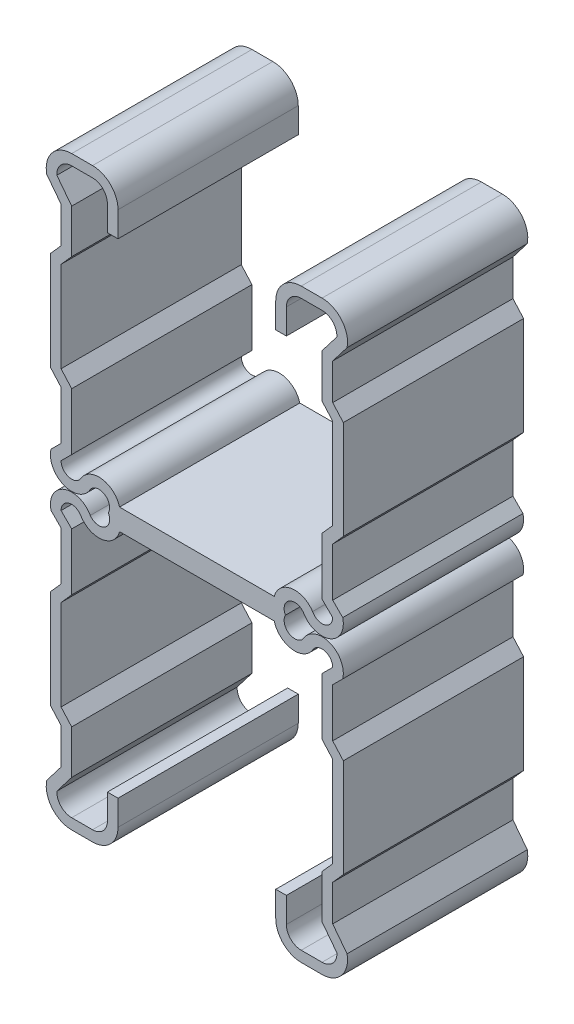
ISO-10303-21;
HEADER;
FILE_DESCRIPTION(('STEP AP214'),'2;1');
FILE_NAME('part.step','',(''),(''),'','','');
FILE_SCHEMA(('AUTOMOTIVE_DESIGN { 1 0 10303 214 1 1 1 1 }'));
ENDSEC;
DATA;
#1=APPLICATION_CONTEXT('core data for automotive mechanical design processes');
#2=APPLICATION_PROTOCOL_DEFINITION('international standard','automotive_design',2000,#1);
#3=PRODUCT_CONTEXT('',#1,'mechanical');
#4=PRODUCT('Part','Part','',(#3));
#5=PRODUCT_RELATED_PRODUCT_CATEGORY('part','',(#4));
#6=PRODUCT_DEFINITION_FORMATION('','',#4);
#7=PRODUCT_DEFINITION_CONTEXT('part definition',#1,'design');
#8=PRODUCT_DEFINITION('design','',#6,#7);
#9=PRODUCT_DEFINITION_SHAPE('','',#8);
#10=(LENGTH_UNIT() NAMED_UNIT(*) SI_UNIT(.MILLI.,.METRE.));
#11=(NAMED_UNIT(*) PLANE_ANGLE_UNIT() SI_UNIT($,.RADIAN.));
#12=(NAMED_UNIT(*) SI_UNIT($,.STERADIAN.) SOLID_ANGLE_UNIT());
#13=UNCERTAINTY_MEASURE_WITH_UNIT(LENGTH_MEASURE(1.E-05),#10,'distance_accuracy_value','');
#14=(GEOMETRIC_REPRESENTATION_CONTEXT(3) GLOBAL_UNCERTAINTY_ASSIGNED_CONTEXT((#13)) GLOBAL_UNIT_ASSIGNED_CONTEXT((#10,
#11,#12)) REPRESENTATION_CONTEXT('',''));
#15=CARTESIAN_POINT('',(0.,0.,0.));
#16=DIRECTION('',(0.,0.,1.));
#17=DIRECTION('',(1.,0.,0.));
#18=AXIS2_PLACEMENT_3D('',#15,#16,#17);
#19=CARTESIAN_POINT('',(13.7938113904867,-17.794678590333,12.7));
#20=DIRECTION('',(0.,0.,-1.));
#21=DIRECTION('',(-1.,0.,0.));
#22=AXIS2_PLACEMENT_3D('',#19,#20,#21);
#23=CYLINDRICAL_SURFACE('',#22,2.9972);
#24=CARTESIAN_POINT('',(13.7938113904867,-17.794678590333,-12.7));
#25=DIRECTION('',(0.,0.,1.));
#26=DIRECTION('',(1.,0.,0.));
#27=AXIS2_PLACEMENT_3D('',#24,#25,#26);
#28=CIRCLE('',#27,2.9972);
#29=CARTESIAN_POINT('',(16.3051886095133,-16.158771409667,-12.7));
#30=VERTEX_POINT('',#29);
#31=CARTESIAN_POINT('',(10.8989921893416,-17.018,-12.7));
#32=VERTEX_POINT('',#31);
#33=EDGE_CURVE('E417',#30,#32,#28,.T.);
#34=ORIENTED_EDGE('',*,*,#33,.T.);
#35=DIRECTION('',(0.,0.,-1.));
#36=VECTOR('',#35,1.);
#37=CARTESIAN_POINT('',(10.8989921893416,-17.018,12.7));
#38=LINE('',#37,#36);
#39=CARTESIAN_POINT('',(10.8989921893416,-17.018,12.7));
#40=VERTEX_POINT('',#39);
#41=EDGE_CURVE('E11',#40,#32,#38,.T.);
#42=ORIENTED_EDGE('',*,*,#41,.F.);
#43=CARTESIAN_POINT('',(13.7938113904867,-17.794678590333,12.7));
#44=DIRECTION('',(0.,0.,1.));
#45=DIRECTION('',(1.,0.,0.));
#46=AXIS2_PLACEMENT_3D('',#43,#44,#45);
#47=CIRCLE('',#46,2.9972);
#48=CARTESIAN_POINT('',(16.3051886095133,-16.158771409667,12.7));
#49=VERTEX_POINT('',#48);
#50=EDGE_CURVE('E526',#49,#40,#47,.T.);
#51=ORIENTED_EDGE('',*,*,#50,.F.);
#52=DIRECTION('',(0.,0.,-1.));
#53=VECTOR('',#52,1.);
#54=CARTESIAN_POINT('',(16.3051886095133,-16.158771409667,12.7));
#55=LINE('',#54,#53);
#56=EDGE_CURVE('E413',#49,#30,#55,.T.);
#57=ORIENTED_EDGE('',*,*,#56,.T.);
#58=EDGE_LOOP('',(#34,#42,#51,#57));
#59=FACE_BOUND('',#58,.T.);
#60=ADVANCED_FACE('F32',(#59),#23,.T.);
#61=CARTESIAN_POINT('',(-10.8989921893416,-17.018,12.7));
#62=DIRECTION('',(0.,-1.,0.));
#63=DIRECTION('',(1.,0.,0.));
#64=AXIS2_PLACEMENT_3D('',#61,#62,#63);
#65=PLANE('',#64);
#66=DIRECTION('',(-1.,0.,0.));
#67=VECTOR('',#66,1.);
#68=CARTESIAN_POINT('',(-10.8989921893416,-17.018,-12.7));
#69=LINE('',#68,#67);
#70=CARTESIAN_POINT('',(-10.8989921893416,-17.018,-12.7));
#71=VERTEX_POINT('',#70);
#72=EDGE_CURVE('E420',#32,#71,#69,.T.);
#73=ORIENTED_EDGE('',*,*,#72,.T.);
#74=DIRECTION('',(0.,0.,-1.));
#75=VECTOR('',#74,1.);
#76=CARTESIAN_POINT('',(-10.8989921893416,-17.018,12.7));
#77=LINE('',#76,#75);
#78=CARTESIAN_POINT('',(-10.8989921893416,-17.018,12.7));
#79=VERTEX_POINT('',#78);
#80=EDGE_CURVE('E40',#79,#71,#77,.T.);
#81=ORIENTED_EDGE('',*,*,#80,.F.);
#82=DIRECTION('',(-1.,0.,0.));
#83=VECTOR('',#82,1.);
#84=CARTESIAN_POINT('',(-10.8989921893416,-17.018,12.7));
#85=LINE('',#84,#83);
#86=EDGE_CURVE('E233',#40,#79,#85,.T.);
#87=ORIENTED_EDGE('',*,*,#86,.F.);
#88=ORIENTED_EDGE('',*,*,#41,.T.);
#89=EDGE_LOOP('',(#73,#81,#87,#88));
#90=FACE_BOUND('',#89,.T.);
#91=ADVANCED_FACE('F822',(#90),#65,.F.);
#92=CARTESIAN_POINT('',(-13.7938113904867,-17.794678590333,12.7));
#93=DIRECTION('',(0.,0.,-1.));
#94=DIRECTION('',(-1.,0.,0.));
#95=AXIS2_PLACEMENT_3D('',#92,#93,#94);
#96=CYLINDRICAL_SURFACE('',#95,2.9972);
#97=CARTESIAN_POINT('',(-13.7938113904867,-17.794678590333,-12.7));
#98=DIRECTION('',(0.,0.,1.));
#99=DIRECTION('',(-1.,0.,0.));
#100=AXIS2_PLACEMENT_3D('',#97,#98,#99);
#101=CIRCLE('',#100,2.9972);
#102=CARTESIAN_POINT('',(-16.4142858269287,-16.3399203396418,-12.7));
#103=VERTEX_POINT('',#102);
#104=EDGE_CURVE('E423',#71,#103,#101,.T.);
#105=ORIENTED_EDGE('',*,*,#104,.T.);
#106=DIRECTION('',(0.,0.,-1.));
#107=VECTOR('',#106,1.);
#108=CARTESIAN_POINT('',(-16.4142858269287,-16.3399203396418,12.7));
#109=LINE('',#108,#107);
#110=CARTESIAN_POINT('',(-16.4142858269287,-16.3399203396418,12.7));
#111=VERTEX_POINT('',#110);
#112=EDGE_CURVE('E677',#111,#103,#109,.T.);
#113=ORIENTED_EDGE('',*,*,#112,.F.);
#114=CARTESIAN_POINT('',(-13.7938113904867,-17.794678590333,12.7));
#115=DIRECTION('',(0.,0.,1.));
#116=DIRECTION('',(-1.,0.,0.));
#117=AXIS2_PLACEMENT_3D('',#114,#115,#116);
#118=CIRCLE('',#117,2.9972);
#119=EDGE_CURVE('E685',#79,#111,#118,.T.);
#120=ORIENTED_EDGE('',*,*,#119,.F.);
#121=ORIENTED_EDGE('',*,*,#80,.T.);
#122=EDGE_LOOP('',(#105,#113,#120,#121));
#123=FACE_BOUND('',#122,.T.);
#124=ADVANCED_FACE('F683',(#123),#96,.T.);
#125=CARTESIAN_POINT('',(-17.6403,-15.478125,12.7));
#126=DIRECTION('',(0.,0.,-1.));
#127=DIRECTION('',(-1.,0.,0.));
#128=AXIS2_PLACEMENT_3D('',#125,#126,#127);
#129=CYLINDRICAL_SURFACE('',#128,1.4986);
#130=CARTESIAN_POINT('',(-17.6403,-15.478125,-12.7));
#131=DIRECTION('',(0.,0.,-1.));
#132=DIRECTION('',(1.,0.,0.));
#133=AXIS2_PLACEMENT_3D('',#130,#131,#132);
#134=CIRCLE('',#133,1.4986);
#135=CARTESIAN_POINT('',(-19.1389,-15.478125,-12.7));
#136=VERTEX_POINT('',#135);
#137=EDGE_CURVE('E425',#103,#136,#134,.T.);
#138=ORIENTED_EDGE('',*,*,#137,.T.);
#139=DIRECTION('',(0.,0.,-1.));
#140=VECTOR('',#139,1.);
#141=CARTESIAN_POINT('',(-19.1389,-15.478125,12.7));
#142=LINE('',#141,#140);
#143=CARTESIAN_POINT('',(-19.1389,-15.478125,12.7));
#144=VERTEX_POINT('',#143);
#145=EDGE_CURVE('E674',#144,#136,#142,.T.);
#146=ORIENTED_EDGE('',*,*,#145,.F.);
#147=CARTESIAN_POINT('',(-17.6403,-15.478125,12.7));
#148=DIRECTION('',(0.,0.,-1.));
#149=DIRECTION('',(1.,0.,0.));
#150=AXIS2_PLACEMENT_3D('',#147,#148,#149);
#151=CIRCLE('',#150,1.4986);
#152=EDGE_CURVE('E703',#111,#144,#151,.T.);
#153=ORIENTED_EDGE('',*,*,#152,.F.);
#154=ORIENTED_EDGE('',*,*,#112,.T.);
#155=EDGE_LOOP('',(#138,#146,#153,#154));
#156=FACE_BOUND('',#155,.T.);
#157=ADVANCED_FACE('F694',(#156),#129,.F.);
#158=CARTESIAN_POINT('',(-17.6403,-13.979525,12.7));
#159=DIRECTION('',(-0.707106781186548,0.707106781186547,0.));
#160=DIRECTION('',(-0.707106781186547,-0.707106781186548,0.));
#161=AXIS2_PLACEMENT_3D('',#158,#159,#160);
#162=PLANE('',#161);
#163=DIRECTION('',(0.707106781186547,0.707106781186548,0.));
#164=VECTOR('',#163,1.);
#165=CARTESIAN_POINT('',(-17.6403,-13.979525,-12.7));
#166=LINE('',#165,#164);
#167=CARTESIAN_POINT('',(-17.6403,-13.979525,-12.7));
#168=VERTEX_POINT('',#167);
#169=EDGE_CURVE('E427',#136,#168,#166,.T.);
#170=ORIENTED_EDGE('',*,*,#169,.T.);
#171=DIRECTION('',(0.,0.,-1.));
#172=VECTOR('',#171,1.);
#173=CARTESIAN_POINT('',(-17.6403,-13.979525,12.7));
#174=LINE('',#173,#172);
#175=CARTESIAN_POINT('',(-17.6403,-13.979525,12.7));
#176=VERTEX_POINT('',#175);
#177=EDGE_CURVE('E671',#176,#168,#174,.T.);
#178=ORIENTED_EDGE('',*,*,#177,.F.);
#179=DIRECTION('',(0.707106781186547,0.707106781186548,0.));
#180=VECTOR('',#179,1.);
#181=CARTESIAN_POINT('',(-17.6403,-13.979525,12.7));
#182=LINE('',#181,#180);
#183=EDGE_CURVE('E700',#144,#176,#182,.T.);
#184=ORIENTED_EDGE('',*,*,#183,.F.);
#185=ORIENTED_EDGE('',*,*,#145,.T.);
#186=EDGE_LOOP('',(#170,#178,#184,#185));
#187=FACE_BOUND('',#186,.T.);
#188=ADVANCED_FACE('F698',(#187),#162,.F.);
#189=CARTESIAN_POINT('',(-17.6403,-13.979525,12.7));
#190=DIRECTION('',(-1.,0.,0.));
#191=DIRECTION('',(0.,-1.,0.));
#192=AXIS2_PLACEMENT_3D('',#189,#190,#191);
#193=PLANE('',#192);
#194=DIRECTION('',(0.,1.,0.));
#195=VECTOR('',#194,1.);
#196=CARTESIAN_POINT('',(-17.6403,-13.979525,-12.7));
#197=LINE('',#196,#195);
#198=CARTESIAN_POINT('',(-17.6403,-5.93680201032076,-12.7));
#199=VERTEX_POINT('',#198);
#200=EDGE_CURVE('E429',#168,#199,#197,.T.);
#201=ORIENTED_EDGE('',*,*,#200,.T.);
#202=DIRECTION('',(0.,0.,-1.));
#203=VECTOR('',#202,1.);
#204=CARTESIAN_POINT('',(-17.6403,-5.93680201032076,12.7));
#205=LINE('',#204,#203);
#206=CARTESIAN_POINT('',(-17.6403,-5.93680201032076,12.7));
#207=VERTEX_POINT('',#206);
#208=EDGE_CURVE('E668',#207,#199,#205,.T.);
#209=ORIENTED_EDGE('',*,*,#208,.F.);
#210=DIRECTION('',(0.,1.,0.));
#211=VECTOR('',#210,1.);
#212=CARTESIAN_POINT('',(-17.6403,-13.979525,12.7));
#213=LINE('',#212,#211);
#214=EDGE_CURVE('E702',#176,#207,#213,.T.);
#215=ORIENTED_EDGE('',*,*,#214,.F.);
#216=ORIENTED_EDGE('',*,*,#177,.T.);
#217=EDGE_LOOP('',(#201,#209,#215,#216));
#218=FACE_BOUND('',#217,.T.);
#219=ADVANCED_FACE('F835',(#218),#193,.F.);
#220=CARTESIAN_POINT('',(-17.6403,-5.93680201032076,12.7));
#221=DIRECTION('',(-0.746819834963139,-0.665026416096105,0.));
#222=DIRECTION('',(0.665026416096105,-0.746819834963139,0.));
#223=AXIS2_PLACEMENT_3D('',#220,#221,#222);
#224=PLANE('',#223);
#225=DIRECTION('',(-0.665026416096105,0.746819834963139,0.));
#226=VECTOR('',#225,1.);
#227=CARTESIAN_POINT('',(-17.6403,-5.93680201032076,-12.7));
#228=LINE('',#227,#226);
#229=CARTESIAN_POINT('',(-19.1389,-4.25388509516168,-12.7));
#230=VERTEX_POINT('',#229);
#231=EDGE_CURVE('E431',#199,#230,#228,.T.);
#232=ORIENTED_EDGE('',*,*,#231,.T.);
#233=DIRECTION('',(0.,0.,-1.));
#234=VECTOR('',#233,1.);
#235=CARTESIAN_POINT('',(-19.1389,-4.25388509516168,12.7));
#236=LINE('',#235,#234);
#237=CARTESIAN_POINT('',(-19.1389,-4.25388509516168,12.7));
#238=VERTEX_POINT('',#237);
#239=EDGE_CURVE('E665',#238,#230,#236,.T.);
#240=ORIENTED_EDGE('',*,*,#239,.F.);
#241=DIRECTION('',(-0.665026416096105,0.746819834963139,0.));
#242=VECTOR('',#241,1.);
#243=CARTESIAN_POINT('',(-17.6403,-5.93680201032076,12.7));
#244=LINE('',#243,#242);
#245=EDGE_CURVE('E705',#207,#238,#244,.T.);
#246=ORIENTED_EDGE('',*,*,#245,.F.);
#247=ORIENTED_EDGE('',*,*,#208,.T.);
#248=EDGE_LOOP('',(#232,#240,#246,#247));
#249=FACE_BOUND('',#248,.T.);
#250=ADVANCED_FACE('F838',(#249),#224,.F.);
#251=CARTESIAN_POINT('',(-19.1389,-4.25388509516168,12.7));
#252=DIRECTION('',(-1.,0.,0.));
#253=DIRECTION('',(0.,0.,1.));
#254=AXIS2_PLACEMENT_3D('',#251,#252,#253);
#255=PLANE('',#254);
#256=DIRECTION('',(0.,1.,0.));
#257=VECTOR('',#256,1.);
#258=CARTESIAN_POINT('',(-19.1389,-4.25388509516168,-12.7));
#259=LINE('',#258,#257);
#260=CARTESIAN_POINT('',(-19.1389,8.49568509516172,-12.7));
#261=VERTEX_POINT('',#260);
#262=EDGE_CURVE('E433',#230,#261,#259,.T.);
#263=ORIENTED_EDGE('',*,*,#262,.T.);
#264=DIRECTION('',(0.,0.,-1.));
#265=VECTOR('',#264,1.);
#266=CARTESIAN_POINT('',(-19.1389,8.49568509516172,12.7));
#267=LINE('',#266,#265);
#268=CARTESIAN_POINT('',(-19.1389,8.49568509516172,12.7));
#269=VERTEX_POINT('',#268);
#270=EDGE_CURVE('E662',#269,#261,#267,.T.);
#271=ORIENTED_EDGE('',*,*,#270,.F.);
#272=DIRECTION('',(0.,1.,0.));
#273=VECTOR('',#272,1.);
#274=CARTESIAN_POINT('',(-19.1389,-4.25388509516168,12.7));
#275=LINE('',#274,#273);
#276=EDGE_CURVE('E711',#238,#269,#275,.T.);
#277=ORIENTED_EDGE('',*,*,#276,.F.);
#278=ORIENTED_EDGE('',*,*,#239,.T.);
#279=EDGE_LOOP('',(#263,#271,#277,#278));
#280=FACE_BOUND('',#279,.T.);
#281=ADVANCED_FACE('F842',(#280),#255,.F.);
#282=CARTESIAN_POINT('',(-17.6403,10.178602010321,12.7));
#283=DIRECTION('',(-0.746819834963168,0.665026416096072,0.));
#284=DIRECTION('',(-0.665026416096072,-0.746819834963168,0.));
#285=AXIS2_PLACEMENT_3D('',#282,#283,#284);
#286=PLANE('',#285);
#287=DIRECTION('',(0.665026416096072,0.746819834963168,0.));
#288=VECTOR('',#287,1.);
#289=CARTESIAN_POINT('',(-17.6403,10.178602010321,-12.7));
#290=LINE('',#289,#288);
#291=CARTESIAN_POINT('',(-17.6403,10.178602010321,-12.7));
#292=VERTEX_POINT('',#291);
#293=EDGE_CURVE('E435',#261,#292,#290,.T.);
#294=ORIENTED_EDGE('',*,*,#293,.T.);
#295=DIRECTION('',(0.,0.,-1.));
#296=VECTOR('',#295,1.);
#297=CARTESIAN_POINT('',(-17.6403,10.178602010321,12.7));
#298=LINE('',#297,#296);
#299=CARTESIAN_POINT('',(-17.6403,10.178602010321,12.7));
#300=VERTEX_POINT('',#299);
#301=EDGE_CURVE('E659',#300,#292,#298,.T.);
#302=ORIENTED_EDGE('',*,*,#301,.F.);
#303=DIRECTION('',(0.665026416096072,0.746819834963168,0.));
#304=VECTOR('',#303,1.);
#305=CARTESIAN_POINT('',(-17.6403,10.178602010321,12.7));
#306=LINE('',#305,#304);
#307=EDGE_CURVE('E713',#269,#300,#306,.T.);
#308=ORIENTED_EDGE('',*,*,#307,.F.);
#309=ORIENTED_EDGE('',*,*,#270,.T.);
#310=EDGE_LOOP('',(#294,#302,#308,#309));
#311=FACE_BOUND('',#310,.T.);
#312=ADVANCED_FACE('F846',(#311),#286,.F.);
#313=CARTESIAN_POINT('',(-17.6403,10.178602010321,12.7));
#314=DIRECTION('',(-1.,0.,0.));
#315=DIRECTION('',(0.,0.,1.));
#316=AXIS2_PLACEMENT_3D('',#313,#314,#315);
#317=PLANE('',#316);
#318=DIRECTION('',(0.,1.,0.));
#319=VECTOR('',#318,1.);
#320=CARTESIAN_POINT('',(-17.6403,10.178602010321,-12.7));
#321=LINE('',#320,#319);
#322=CARTESIAN_POINT('',(-17.6403,16.3392865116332,-12.7));
#323=VERTEX_POINT('',#322);
#324=EDGE_CURVE('E437',#292,#323,#321,.T.);
#325=ORIENTED_EDGE('',*,*,#324,.T.);
#326=DIRECTION('',(0.,0.,-1.));
#327=VECTOR('',#326,1.);
#328=CARTESIAN_POINT('',(-17.6403,16.3392865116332,12.7));
#329=LINE('',#328,#327);
#330=CARTESIAN_POINT('',(-17.6403,16.3392865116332,12.7));
#331=VERTEX_POINT('',#330);
#332=EDGE_CURVE('E656',#331,#323,#329,.T.);
#333=ORIENTED_EDGE('',*,*,#332,.F.);
#334=DIRECTION('',(0.,1.,0.));
#335=VECTOR('',#334,1.);
#336=CARTESIAN_POINT('',(-17.6403,10.178602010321,12.7));
#337=LINE('',#336,#335);
#338=EDGE_CURVE('E715',#300,#331,#337,.T.);
#339=ORIENTED_EDGE('',*,*,#338,.F.);
#340=ORIENTED_EDGE('',*,*,#301,.T.);
#341=EDGE_LOOP('',(#325,#333,#339,#340));
#342=FACE_BOUND('',#341,.T.);
#343=ADVANCED_FACE('F850',(#342),#317,.F.);
#344=CARTESIAN_POINT('',(-17.6403,16.3392865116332,12.7));
#345=DIRECTION('',(-0.793466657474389,-0.608613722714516,0.));
#346=DIRECTION('',(0.608613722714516,-0.793466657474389,0.));
#347=AXIS2_PLACEMENT_3D('',#344,#345,#346);
#348=PLANE('',#347);
#349=DIRECTION('',(-0.608613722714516,0.793466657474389,0.));
#350=VECTOR('',#349,1.);
#351=CARTESIAN_POINT('',(-17.6403,16.3392865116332,-12.7));
#352=LINE('',#351,#350);
#353=CARTESIAN_POINT('',(-19.7298825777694,19.0635335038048,-12.7));
#354=VERTEX_POINT('',#353);
#355=EDGE_CURVE('E439',#323,#354,#352,.T.);
#356=ORIENTED_EDGE('',*,*,#355,.T.);
#357=DIRECTION('',(0.,0.,-1.));
#358=VECTOR('',#357,1.);
#359=CARTESIAN_POINT('',(-19.7298825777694,19.0635335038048,12.7));
#360=LINE('',#359,#358);
#361=CARTESIAN_POINT('',(-19.7298825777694,19.0635335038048,12.7));
#362=VERTEX_POINT('',#361);
#363=EDGE_CURVE('E653',#362,#354,#360,.T.);
#364=ORIENTED_EDGE('',*,*,#363,.F.);
#365=DIRECTION('',(-0.608613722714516,0.793466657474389,0.));
#366=VECTOR('',#365,1.);
#367=CARTESIAN_POINT('',(-17.6403,16.3392865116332,12.7));
#368=LINE('',#367,#366);
#369=EDGE_CURVE('E717',#331,#362,#368,.T.);
#370=ORIENTED_EDGE('',*,*,#369,.F.);
#371=ORIENTED_EDGE('',*,*,#332,.T.);
#372=EDGE_LOOP('',(#356,#364,#370,#371));
#373=FACE_BOUND('',#372,.T.);
#374=ADVANCED_FACE('F854',(#373),#348,.F.);
#375=CARTESIAN_POINT('',(-17.6403,19.1676263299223,12.7));
#376=DIRECTION('',(0.,0.,-1.));
#377=DIRECTION('',(-1.,0.,0.));
#378=AXIS2_PLACEMENT_3D('',#375,#376,#377);
#379=CYLINDRICAL_SURFACE('',#378,2.09217367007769);
#380=CARTESIAN_POINT('',(-17.6403,19.1676263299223,-12.7));
#381=DIRECTION('',(0.,0.,-1.));
#382=DIRECTION('',(1.,0.,0.));
#383=AXIS2_PLACEMENT_3D('',#380,#381,#382);
#384=CIRCLE('',#383,2.09217367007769);
#385=CARTESIAN_POINT('',(-17.6403,21.2598,-12.7));
#386=VERTEX_POINT('',#385);
#387=EDGE_CURVE('E441',#354,#386,#384,.T.);
#388=ORIENTED_EDGE('',*,*,#387,.T.);
#389=DIRECTION('',(0.,0.,-1.));
#390=VECTOR('',#389,1.);
#391=CARTESIAN_POINT('',(-17.6403,21.2598,12.7));
#392=LINE('',#391,#390);
#393=CARTESIAN_POINT('',(-17.6403,21.2598,12.7));
#394=VERTEX_POINT('',#393);
#395=EDGE_CURVE('E650',#394,#386,#392,.T.);
#396=ORIENTED_EDGE('',*,*,#395,.F.);
#397=CARTESIAN_POINT('',(-17.6403,19.1676263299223,12.7));
#398=DIRECTION('',(0.,0.,-1.));
#399=DIRECTION('',(1.,0.,0.));
#400=AXIS2_PLACEMENT_3D('',#397,#398,#399);
#401=CIRCLE('',#400,2.09217367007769);
#402=EDGE_CURVE('E719',#362,#394,#401,.T.);
#403=ORIENTED_EDGE('',*,*,#402,.F.);
#404=ORIENTED_EDGE('',*,*,#363,.T.);
#405=EDGE_LOOP('',(#388,#396,#403,#404));
#406=FACE_BOUND('',#405,.T.);
#407=ADVANCED_FACE('F858',(#406),#379,.F.);
#408=CARTESIAN_POINT('',(-17.6403,21.2598,12.7));
#409=DIRECTION('',(0.,1.,0.));
#410=DIRECTION('',(0.,0.,1.));
#411=AXIS2_PLACEMENT_3D('',#408,#409,#410);
#412=PLANE('',#411);
#413=DIRECTION('',(1.,0.,0.));
#414=VECTOR('',#413,1.);
#415=CARTESIAN_POINT('',(-17.6403,21.2598,-12.7));
#416=LINE('',#415,#414);
#417=CARTESIAN_POINT('',(-14.7032736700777,21.2598,-12.7));
#418=VERTEX_POINT('',#417);
#419=EDGE_CURVE('E443',#386,#418,#416,.T.);
#420=ORIENTED_EDGE('',*,*,#419,.T.);
#421=DIRECTION('',(0.,0.,-1.));
#422=VECTOR('',#421,1.);
#423=CARTESIAN_POINT('',(-14.7032736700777,21.2598,12.7));
#424=LINE('',#423,#422);
#425=CARTESIAN_POINT('',(-14.7032736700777,21.2598,12.7));
#426=VERTEX_POINT('',#425);
#427=EDGE_CURVE('E647',#426,#418,#424,.T.);
#428=ORIENTED_EDGE('',*,*,#427,.F.);
#429=DIRECTION('',(1.,0.,0.));
#430=VECTOR('',#429,1.);
#431=CARTESIAN_POINT('',(-17.6403,21.2598,12.7));
#432=LINE('',#431,#430);
#433=EDGE_CURVE('E721',#394,#426,#432,.T.);
#434=ORIENTED_EDGE('',*,*,#433,.F.);
#435=ORIENTED_EDGE('',*,*,#395,.T.);
#436=EDGE_LOOP('',(#420,#428,#434,#435));
#437=FACE_BOUND('',#436,.T.);
#438=ADVANCED_FACE('F862',(#437),#412,.F.);
#439=CARTESIAN_POINT('',(-14.7032736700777,19.1676263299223,12.7));
#440=DIRECTION('',(0.,0.,-1.));
#441=DIRECTION('',(-1.,0.,0.));
#442=AXIS2_PLACEMENT_3D('',#439,#440,#441);
#443=CYLINDRICAL_SURFACE('',#442,2.09217367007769);
#444=CARTESIAN_POINT('',(-14.7032736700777,19.1676263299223,-12.7));
#445=DIRECTION('',(0.,0.,-1.));
#446=DIRECTION('',(1.,0.,0.));
#447=AXIS2_PLACEMENT_3D('',#444,#445,#446);
#448=CIRCLE('',#447,2.09217367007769);
#449=CARTESIAN_POINT('',(-12.6111,19.1676263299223,-12.7));
#450=VERTEX_POINT('',#449);
#451=EDGE_CURVE('E445',#418,#450,#448,.T.);
#452=ORIENTED_EDGE('',*,*,#451,.T.);
#453=DIRECTION('',(0.,0.,-1.));
#454=VECTOR('',#453,1.);
#455=CARTESIAN_POINT('',(-12.6111,19.1676263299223,12.7));
#456=LINE('',#455,#454);
#457=CARTESIAN_POINT('',(-12.6111,19.1676263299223,12.7));
#458=VERTEX_POINT('',#457);
#459=EDGE_CURVE('E644',#458,#450,#456,.T.);
#460=ORIENTED_EDGE('',*,*,#459,.F.);
#461=CARTESIAN_POINT('',(-14.7032736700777,19.1676263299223,12.7));
#462=DIRECTION('',(0.,0.,-1.));
#463=DIRECTION('',(1.,0.,0.));
#464=AXIS2_PLACEMENT_3D('',#461,#462,#463);
#465=CIRCLE('',#464,2.09217367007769);
#466=EDGE_CURVE('E723',#426,#458,#465,.T.);
#467=ORIENTED_EDGE('',*,*,#466,.F.);
#468=ORIENTED_EDGE('',*,*,#427,.T.);
#469=EDGE_LOOP('',(#452,#460,#467,#468));
#470=FACE_BOUND('',#469,.T.);
#471=ADVANCED_FACE('F866',(#470),#443,.F.);
#472=CARTESIAN_POINT('',(-12.6111,19.1676263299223,12.7));
#473=DIRECTION('',(1.,0.,0.));
#474=DIRECTION('',(0.,0.,-1.));
#475=AXIS2_PLACEMENT_3D('',#472,#473,#474);
#476=PLANE('',#475);
#477=DIRECTION('',(0.,-1.,0.));
#478=VECTOR('',#477,1.);
#479=CARTESIAN_POINT('',(-12.6111,19.1676263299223,-12.7));
#480=LINE('',#479,#478);
#481=CARTESIAN_POINT('',(-12.6111,15.61465,-12.7));
#482=VERTEX_POINT('',#481);
#483=EDGE_CURVE('E447',#450,#482,#480,.T.);
#484=ORIENTED_EDGE('',*,*,#483,.T.);
#485=DIRECTION('',(0.,0.,-1.));
#486=VECTOR('',#485,1.);
#487=CARTESIAN_POINT('',(-12.6111,15.61465,12.7));
#488=LINE('',#487,#486);
#489=CARTESIAN_POINT('',(-12.6111,15.61465,12.7));
#490=VERTEX_POINT('',#489);
#491=EDGE_CURVE('E641',#490,#482,#488,.T.);
#492=ORIENTED_EDGE('',*,*,#491,.F.);
#493=DIRECTION('',(0.,-1.,0.));
#494=VECTOR('',#493,1.);
#495=CARTESIAN_POINT('',(-12.6111,19.1676263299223,12.7));
#496=LINE('',#495,#494);
#497=EDGE_CURVE('E725',#458,#490,#496,.T.);
#498=ORIENTED_EDGE('',*,*,#497,.F.);
#499=ORIENTED_EDGE('',*,*,#459,.T.);
#500=EDGE_LOOP('',(#484,#492,#498,#499));
#501=FACE_BOUND('',#500,.T.);
#502=ADVANCED_FACE('F870',(#501),#476,.F.);
#503=CARTESIAN_POINT('',(-12.6111,15.61465,12.7));
#504=DIRECTION('',(0.,1.,0.));
#505=DIRECTION('',(0.,0.,1.));
#506=AXIS2_PLACEMENT_3D('',#503,#504,#505);
#507=PLANE('',#506);
#508=DIRECTION('',(1.,0.,0.));
#509=VECTOR('',#508,1.);
#510=CARTESIAN_POINT('',(-12.6111,15.61465,-12.7));
#511=LINE('',#510,#509);
#512=CARTESIAN_POINT('',(-11.1125,15.61465,-12.7));
#513=VERTEX_POINT('',#512);
#514=EDGE_CURVE('E449',#482,#513,#511,.T.);
#515=ORIENTED_EDGE('',*,*,#514,.T.);
#516=DIRECTION('',(0.,0.,-1.));
#517=VECTOR('',#516,1.);
#518=CARTESIAN_POINT('',(-11.1125,15.61465,12.7));
#519=LINE('',#518,#517);
#520=CARTESIAN_POINT('',(-11.1125,15.61465,12.7));
#521=VERTEX_POINT('',#520);
#522=EDGE_CURVE('E638',#521,#513,#519,.T.);
#523=ORIENTED_EDGE('',*,*,#522,.F.);
#524=DIRECTION('',(1.,0.,0.));
#525=VECTOR('',#524,1.);
#526=CARTESIAN_POINT('',(-12.6111,15.61465,12.7));
#527=LINE('',#526,#525);
#528=EDGE_CURVE('E727',#490,#521,#527,.T.);
#529=ORIENTED_EDGE('',*,*,#528,.F.);
#530=ORIENTED_EDGE('',*,*,#491,.T.);
#531=EDGE_LOOP('',(#515,#523,#529,#530));
#532=FACE_BOUND('',#531,.T.);
#533=ADVANCED_FACE('F874',(#532),#507,.F.);
#534=CARTESIAN_POINT('',(-11.1125,19.1676263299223,12.7));
#535=DIRECTION('',(-1.,0.,0.));
#536=DIRECTION('',(0.,0.,1.));
#537=AXIS2_PLACEMENT_3D('',#534,#535,#536);
#538=PLANE('',#537);
#539=DIRECTION('',(0.,1.,0.));
#540=VECTOR('',#539,1.);
#541=CARTESIAN_POINT('',(-11.1125,19.1676263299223,-12.7));
#542=LINE('',#541,#540);
#543=CARTESIAN_POINT('',(-11.1125,19.1676263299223,-12.7));
#544=VERTEX_POINT('',#543);
#545=EDGE_CURVE('E451',#513,#544,#542,.T.);
#546=ORIENTED_EDGE('',*,*,#545,.T.);
#547=DIRECTION('',(0.,0.,-1.));
#548=VECTOR('',#547,1.);
#549=CARTESIAN_POINT('',(-11.1125,19.1676263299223,12.7));
#550=LINE('',#549,#548);
#551=CARTESIAN_POINT('',(-11.1125,19.1676263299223,12.7));
#552=VERTEX_POINT('',#551);
#553=EDGE_CURVE('E635',#552,#544,#550,.T.);
#554=ORIENTED_EDGE('',*,*,#553,.F.);
#555=DIRECTION('',(0.,1.,0.));
#556=VECTOR('',#555,1.);
#557=CARTESIAN_POINT('',(-11.1125,19.1676263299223,12.7));
#558=LINE('',#557,#556);
#559=EDGE_CURVE('E729',#521,#552,#558,.T.);
#560=ORIENTED_EDGE('',*,*,#559,.F.);
#561=ORIENTED_EDGE('',*,*,#522,.T.);
#562=EDGE_LOOP('',(#546,#554,#560,#561));
#563=FACE_BOUND('',#562,.T.);
#564=ADVANCED_FACE('F878',(#563),#538,.F.);
#565=CARTESIAN_POINT('',(-14.7032736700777,19.1676263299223,12.7));
#566=DIRECTION('',(0.,0.,-1.));
#567=DIRECTION('',(-1.,0.,0.));
#568=AXIS2_PLACEMENT_3D('',#565,#566,#567);
#569=CYLINDRICAL_SURFACE('',#568,3.59077367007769);
#570=CARTESIAN_POINT('',(-14.7032736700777,19.1676263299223,-12.7));
#571=DIRECTION('',(0.,0.,1.));
#572=DIRECTION('',(1.,0.,0.));
#573=AXIS2_PLACEMENT_3D('',#570,#571,#572);
#574=CIRCLE('',#573,3.59077367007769);
#575=CARTESIAN_POINT('',(-14.7032736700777,22.7584,-12.7));
#576=VERTEX_POINT('',#575);
#577=EDGE_CURVE('E453',#544,#576,#574,.T.);
#578=ORIENTED_EDGE('',*,*,#577,.T.);
#579=DIRECTION('',(0.,0.,-1.));
#580=VECTOR('',#579,1.);
#581=CARTESIAN_POINT('',(-14.7032736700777,22.7584,12.7));
#582=LINE('',#581,#580);
#583=CARTESIAN_POINT('',(-14.7032736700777,22.7584,12.7));
#584=VERTEX_POINT('',#583);
#585=EDGE_CURVE('E632',#584,#576,#582,.T.);
#586=ORIENTED_EDGE('',*,*,#585,.F.);
#587=CARTESIAN_POINT('',(-14.7032736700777,19.1676263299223,12.7));
#588=DIRECTION('',(0.,0.,1.));
#589=DIRECTION('',(1.,0.,0.));
#590=AXIS2_PLACEMENT_3D('',#587,#588,#589);
#591=CIRCLE('',#590,3.59077367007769);
#592=EDGE_CURVE('E731',#552,#584,#591,.T.);
#593=ORIENTED_EDGE('',*,*,#592,.F.);
#594=ORIENTED_EDGE('',*,*,#553,.T.);
#595=EDGE_LOOP('',(#578,#586,#593,#594));
#596=FACE_BOUND('',#595,.T.);
#597=ADVANCED_FACE('F882',(#596),#569,.T.);
#598=CARTESIAN_POINT('',(-17.6403,22.7584,12.7));
#599=DIRECTION('',(0.,-1.,0.));
#600=DIRECTION('',(1.,0.,0.));
#601=AXIS2_PLACEMENT_3D('',#598,#599,#600);
#602=PLANE('',#601);
#603=DIRECTION('',(-1.,0.,0.));
#604=VECTOR('',#603,1.);
#605=CARTESIAN_POINT('',(-17.6403,22.7584,-12.7));
#606=LINE('',#605,#604);
#607=CARTESIAN_POINT('',(-17.6403,22.7584,-12.7));
#608=VERTEX_POINT('',#607);
#609=EDGE_CURVE('E455',#576,#608,#606,.T.);
#610=ORIENTED_EDGE('',*,*,#609,.T.);
#611=DIRECTION('',(0.,0.,-1.));
#612=VECTOR('',#611,1.);
#613=CARTESIAN_POINT('',(-17.6403,22.7584,12.7));
#614=LINE('',#613,#612);
#615=CARTESIAN_POINT('',(-17.6403,22.7584,12.7));
#616=VERTEX_POINT('',#615);
#617=EDGE_CURVE('E629',#616,#608,#614,.T.);
#618=ORIENTED_EDGE('',*,*,#617,.F.);
#619=DIRECTION('',(-1.,0.,0.));
#620=VECTOR('',#619,1.);
#621=CARTESIAN_POINT('',(-17.6403,22.7584,12.7));
#622=LINE('',#621,#620);
#623=EDGE_CURVE('E733',#584,#616,#622,.T.);
#624=ORIENTED_EDGE('',*,*,#623,.F.);
#625=ORIENTED_EDGE('',*,*,#585,.T.);
#626=EDGE_LOOP('',(#610,#618,#624,#625));
#627=FACE_BOUND('',#626,.T.);
#628=ADVANCED_FACE('F886',(#627),#602,.F.);
#629=CARTESIAN_POINT('',(-17.6403,19.1676263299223,12.7));
#630=DIRECTION('',(0.,0.,-1.));
#631=DIRECTION('',(-1.,0.,0.));
#632=AXIS2_PLACEMENT_3D('',#629,#630,#631);
#633=CYLINDRICAL_SURFACE('',#632,3.59077367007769);
#634=CARTESIAN_POINT('',(-17.6403,19.1676263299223,-12.7));
#635=DIRECTION('',(0.,0.,1.));
#636=DIRECTION('',(1.,0.,0.));
#637=AXIS2_PLACEMENT_3D('',#634,#635,#636);
#638=CIRCLE('',#637,3.59077367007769);
#639=CARTESIAN_POINT('',(-21.1624286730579,18.4688666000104,-12.7));
#640=VERTEX_POINT('',#639);
#641=EDGE_CURVE('E457',#608,#640,#638,.T.);
#642=ORIENTED_EDGE('',*,*,#641,.T.);
#643=DIRECTION('',(0.,0.,-1.));
#644=VECTOR('',#643,1.);
#645=CARTESIAN_POINT('',(-21.1624286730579,18.4688666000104,12.7));
#646=LINE('',#645,#644);
#647=CARTESIAN_POINT('',(-21.1624286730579,18.4688666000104,12.7));
#648=VERTEX_POINT('',#647);
#649=EDGE_CURVE('E626',#648,#640,#646,.T.);
#650=ORIENTED_EDGE('',*,*,#649,.F.);
#651=CARTESIAN_POINT('',(-17.6403,19.1676263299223,12.7));
#652=DIRECTION('',(0.,0.,1.));
#653=DIRECTION('',(1.,0.,0.));
#654=AXIS2_PLACEMENT_3D('',#651,#652,#653);
#655=CIRCLE('',#654,3.59077367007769);
#656=EDGE_CURVE('E735',#616,#648,#655,.T.);
#657=ORIENTED_EDGE('',*,*,#656,.F.);
#658=ORIENTED_EDGE('',*,*,#617,.T.);
#659=EDGE_LOOP('',(#642,#650,#657,#658));
#660=FACE_BOUND('',#659,.T.);
#661=ADVANCED_FACE('F890',(#660),#633,.T.);
#662=CARTESIAN_POINT('',(-19.1389,15.8307359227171,12.7));
#663=DIRECTION('',(0.793466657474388,0.608613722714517,0.));
#664=DIRECTION('',(-0.608613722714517,0.793466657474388,0.));
#665=AXIS2_PLACEMENT_3D('',#662,#663,#664);
#666=PLANE('',#665);
#667=DIRECTION('',(0.608613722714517,-0.793466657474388,0.));
#668=VECTOR('',#667,1.);
#669=CARTESIAN_POINT('',(-19.1389,15.8307359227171,-12.7));
#670=LINE('',#669,#668);
#671=CARTESIAN_POINT('',(-19.1389,15.8307359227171,-12.7));
#672=VERTEX_POINT('',#671);
#673=EDGE_CURVE('E459',#640,#672,#670,.T.);
#674=ORIENTED_EDGE('',*,*,#673,.T.);
#675=DIRECTION('',(0.,0.,-1.));
#676=VECTOR('',#675,1.);
#677=CARTESIAN_POINT('',(-19.1389,15.8307359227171,12.7));
#678=LINE('',#677,#676);
#679=CARTESIAN_POINT('',(-19.1389,15.8307359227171,12.7));
#680=VERTEX_POINT('',#679);
#681=EDGE_CURVE('E623',#680,#672,#678,.T.);
#682=ORIENTED_EDGE('',*,*,#681,.F.);
#683=DIRECTION('',(0.608613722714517,-0.793466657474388,0.));
#684=VECTOR('',#683,1.);
#685=CARTESIAN_POINT('',(-19.1389,15.8307359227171,12.7));
#686=LINE('',#685,#684);
#687=EDGE_CURVE('E737',#648,#680,#686,.T.);
#688=ORIENTED_EDGE('',*,*,#687,.F.);
#689=ORIENTED_EDGE('',*,*,#649,.T.);
#690=EDGE_LOOP('',(#674,#682,#688,#689));
#691=FACE_BOUND('',#690,.T.);
#692=ADVANCED_FACE('F894',(#691),#666,.F.);
#693=CARTESIAN_POINT('',(-19.1389,10.7491294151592,12.7));
#694=DIRECTION('',(1.,0.,0.));
#695=DIRECTION('',(0.,0.,-1.));
#696=AXIS2_PLACEMENT_3D('',#693,#694,#695);
#697=PLANE('',#696);
#698=DIRECTION('',(0.,-1.,0.));
#699=VECTOR('',#698,1.);
#700=CARTESIAN_POINT('',(-19.1389,10.7491294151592,-12.7));
#701=LINE('',#700,#699);
#702=CARTESIAN_POINT('',(-19.1389,10.7491294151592,-12.7));
#703=VERTEX_POINT('',#702);
#704=EDGE_CURVE('E461',#672,#703,#701,.T.);
#705=ORIENTED_EDGE('',*,*,#704,.T.);
#706=DIRECTION('',(0.,0.,-1.));
#707=VECTOR('',#706,1.);
#708=CARTESIAN_POINT('',(-19.1389,10.7491294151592,12.7));
#709=LINE('',#708,#707);
#710=CARTESIAN_POINT('',(-19.1389,10.7491294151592,12.7));
#711=VERTEX_POINT('',#710);
#712=EDGE_CURVE('E620',#711,#703,#709,.T.);
#713=ORIENTED_EDGE('',*,*,#712,.F.);
#714=DIRECTION('',(0.,-1.,0.));
#715=VECTOR('',#714,1.);
#716=CARTESIAN_POINT('',(-19.1389,10.7491294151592,12.7));
#717=LINE('',#716,#715);
#718=EDGE_CURVE('E739',#680,#711,#717,.T.);
#719=ORIENTED_EDGE('',*,*,#718,.F.);
#720=ORIENTED_EDGE('',*,*,#681,.T.);
#721=EDGE_LOOP('',(#705,#713,#719,#720));
#722=FACE_BOUND('',#721,.T.);
#723=ADVANCED_FACE('F898',(#722),#697,.F.);
#724=CARTESIAN_POINT('',(-19.1389,10.7491294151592,12.7));
#725=DIRECTION('',(0.746819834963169,-0.665026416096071,0.));
#726=DIRECTION('',(0.665026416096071,0.746819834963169,0.));
#727=AXIS2_PLACEMENT_3D('',#724,#725,#726);
#728=PLANE('',#727);
#729=DIRECTION('',(-0.665026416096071,-0.746819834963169,0.));
#730=VECTOR('',#729,1.);
#731=CARTESIAN_POINT('',(-19.1389,10.7491294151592,-12.7));
#732=LINE('',#731,#730);
#733=CARTESIAN_POINT('',(-20.6375,9.0662125,-12.7));
#734=VERTEX_POINT('',#733);
#735=EDGE_CURVE('E463',#703,#734,#732,.T.);
#736=ORIENTED_EDGE('',*,*,#735,.T.);
#737=DIRECTION('',(0.,0.,-1.));
#738=VECTOR('',#737,1.);
#739=CARTESIAN_POINT('',(-20.6375,9.0662125,12.7));
#740=LINE('',#739,#738);
#741=CARTESIAN_POINT('',(-20.6375,9.0662125,12.7));
#742=VERTEX_POINT('',#741);
#743=EDGE_CURVE('E617',#742,#734,#740,.T.);
#744=ORIENTED_EDGE('',*,*,#743,.F.);
#745=DIRECTION('',(-0.665026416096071,-0.746819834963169,0.));
#746=VECTOR('',#745,1.);
#747=CARTESIAN_POINT('',(-19.1389,10.7491294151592,12.7));
#748=LINE('',#747,#746);
#749=EDGE_CURVE('E741',#711,#742,#748,.T.);
#750=ORIENTED_EDGE('',*,*,#749,.F.);
#751=ORIENTED_EDGE('',*,*,#712,.T.);
#752=EDGE_LOOP('',(#736,#744,#750,#751));
#753=FACE_BOUND('',#752,.T.);
#754=ADVANCED_FACE('F902',(#753),#728,.F.);
#755=CARTESIAN_POINT('',(-20.6375,-4.8244125,12.7));
#756=DIRECTION('',(1.,0.,0.));
#757=DIRECTION('',(0.,1.,0.));
#758=AXIS2_PLACEMENT_3D('',#755,#756,#757);
#759=PLANE('',#758);
#760=DIRECTION('',(0.,-1.,0.));
#761=VECTOR('',#760,1.);
#762=CARTESIAN_POINT('',(-20.6375,-4.8244125,-12.7));
#763=LINE('',#762,#761);
#764=CARTESIAN_POINT('',(-20.6375,-4.8244125,-12.7));
#765=VERTEX_POINT('',#764);
#766=EDGE_CURVE('E465',#734,#765,#763,.T.);
#767=ORIENTED_EDGE('',*,*,#766,.T.);
#768=DIRECTION('',(0.,0.,-1.));
#769=VECTOR('',#768,1.);
#770=CARTESIAN_POINT('',(-20.6375,-4.8244125,12.7));
#771=LINE('',#770,#769);
#772=CARTESIAN_POINT('',(-20.6375,-4.8244125,12.7));
#773=VERTEX_POINT('',#772);
#774=EDGE_CURVE('E614',#773,#765,#771,.T.);
#775=ORIENTED_EDGE('',*,*,#774,.F.);
#776=DIRECTION('',(0.,-1.,0.));
#777=VECTOR('',#776,1.);
#778=CARTESIAN_POINT('',(-20.6375,-4.8244125,12.7));
#779=LINE('',#778,#777);
#780=EDGE_CURVE('E743',#742,#773,#779,.T.);
#781=ORIENTED_EDGE('',*,*,#780,.F.);
#782=ORIENTED_EDGE('',*,*,#743,.T.);
#783=EDGE_LOOP('',(#767,#775,#781,#782));
#784=FACE_BOUND('',#783,.T.);
#785=ADVANCED_FACE('F906',(#784),#759,.F.);
#786=CARTESIAN_POINT('',(-19.1389,-6.50732941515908,12.7));
#787=DIRECTION('',(0.746819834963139,0.665026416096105,0.));
#788=DIRECTION('',(-0.665026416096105,0.746819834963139,0.));
#789=AXIS2_PLACEMENT_3D('',#786,#787,#788);
#790=PLANE('',#789);
#791=DIRECTION('',(0.665026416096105,-0.746819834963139,0.));
#792=VECTOR('',#791,1.);
#793=CARTESIAN_POINT('',(-19.1389,-6.50732941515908,-12.7));
#794=LINE('',#793,#792);
#795=CARTESIAN_POINT('',(-19.1389,-6.50732941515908,-12.7));
#796=VERTEX_POINT('',#795);
#797=EDGE_CURVE('E467',#765,#796,#794,.T.);
#798=ORIENTED_EDGE('',*,*,#797,.T.);
#799=DIRECTION('',(0.,0.,-1.));
#800=VECTOR('',#799,1.);
#801=CARTESIAN_POINT('',(-19.1389,-6.50732941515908,12.7));
#802=LINE('',#801,#800);
#803=CARTESIAN_POINT('',(-19.1389,-6.50732941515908,12.7));
#804=VERTEX_POINT('',#803);
#805=EDGE_CURVE('E611',#804,#796,#802,.T.);
#806=ORIENTED_EDGE('',*,*,#805,.F.);
#807=DIRECTION('',(0.665026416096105,-0.746819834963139,0.));
#808=VECTOR('',#807,1.);
#809=CARTESIAN_POINT('',(-19.1389,-6.50732941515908,12.7));
#810=LINE('',#809,#808);
#811=EDGE_CURVE('E745',#773,#804,#810,.T.);
#812=ORIENTED_EDGE('',*,*,#811,.F.);
#813=ORIENTED_EDGE('',*,*,#774,.T.);
#814=EDGE_LOOP('',(#798,#806,#812,#813));
#815=FACE_BOUND('',#814,.T.);
#816=ADVANCED_FACE('F910',(#815),#790,.F.);
#817=CARTESIAN_POINT('',(-19.1389,-13.3587845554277,12.7));
#818=DIRECTION('',(1.,0.,0.));
#819=DIRECTION('',(0.,0.,-1.));
#820=AXIS2_PLACEMENT_3D('',#817,#818,#819);
#821=PLANE('',#820);
#822=DIRECTION('',(0.,-1.,0.));
#823=VECTOR('',#822,1.);
#824=CARTESIAN_POINT('',(-19.1389,-13.3587845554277,-12.7));
#825=LINE('',#824,#823);
#826=CARTESIAN_POINT('',(-19.1389,-13.3587845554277,-12.7));
#827=VERTEX_POINT('',#826);
#828=EDGE_CURVE('E469',#796,#827,#825,.T.);
#829=ORIENTED_EDGE('',*,*,#828,.T.);
#830=DIRECTION('',(0.,0.,-1.));
#831=VECTOR('',#830,1.);
#832=CARTESIAN_POINT('',(-19.1389,-13.3587845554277,12.7));
#833=LINE('',#832,#831);
#834=CARTESIAN_POINT('',(-19.1389,-13.3587845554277,12.7));
#835=VERTEX_POINT('',#834);
#836=EDGE_CURVE('E608',#835,#827,#833,.T.);
#837=ORIENTED_EDGE('',*,*,#836,.F.);
#838=DIRECTION('',(0.,-1.,0.));
#839=VECTOR('',#838,1.);
#840=CARTESIAN_POINT('',(-19.1389,-13.3587845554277,12.7));
#841=LINE('',#840,#839);
#842=EDGE_CURVE('E747',#804,#835,#841,.T.);
#843=ORIENTED_EDGE('',*,*,#842,.F.);
#844=ORIENTED_EDGE('',*,*,#805,.T.);
#845=EDGE_LOOP('',(#829,#837,#843,#844));
#846=FACE_BOUND('',#845,.T.);
#847=ADVANCED_FACE('F914',(#846),#821,.F.);
#848=CARTESIAN_POINT('',(-19.1389,-13.3587845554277,12.7));
#849=DIRECTION('',(0.707106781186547,-0.707106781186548,0.));
#850=DIRECTION('',(0.707106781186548,0.707106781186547,0.));
#851=AXIS2_PLACEMENT_3D('',#848,#849,#850);
#852=PLANE('',#851);
#853=DIRECTION('',(-0.707106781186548,-0.707106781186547,0.));
#854=VECTOR('',#853,1.);
#855=CARTESIAN_POINT('',(-19.1389,-13.3587845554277,-12.7));
#856=LINE('',#855,#854);
#857=CARTESIAN_POINT('',(-20.5534580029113,-14.773342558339,-12.7));
#858=VERTEX_POINT('',#857);
#859=EDGE_CURVE('E471',#827,#858,#856,.T.);
#860=ORIENTED_EDGE('',*,*,#859,.T.);
#861=DIRECTION('',(0.,0.,-1.));
#862=VECTOR('',#861,1.);
#863=CARTESIAN_POINT('',(-20.5534580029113,-14.773342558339,12.7));
#864=LINE('',#863,#862);
#865=CARTESIAN_POINT('',(-20.5534580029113,-14.773342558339,12.7));
#866=VERTEX_POINT('',#865);
#867=EDGE_CURVE('E605',#866,#858,#864,.T.);
#868=ORIENTED_EDGE('',*,*,#867,.F.);
#869=DIRECTION('',(-0.707106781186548,-0.707106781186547,0.));
#870=VECTOR('',#869,1.);
#871=CARTESIAN_POINT('',(-19.1389,-13.3587845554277,12.7));
#872=LINE('',#871,#870);
#873=EDGE_CURVE('E749',#835,#866,#872,.T.);
#874=ORIENTED_EDGE('',*,*,#873,.F.);
#875=ORIENTED_EDGE('',*,*,#836,.T.);
#876=EDGE_LOOP('',(#860,#868,#874,#875));
#877=FACE_BOUND('',#876,.T.);
#878=ADVANCED_FACE('F918',(#877),#852,.F.);
#879=CARTESIAN_POINT('',(-17.6403,-15.478125,12.7));
#880=DIRECTION('',(0.,0.,-1.));
#881=DIRECTION('',(-1.,0.,0.));
#882=AXIS2_PLACEMENT_3D('',#879,#880,#881);
#883=CYLINDRICAL_SURFACE('',#882,2.9972);
#884=CARTESIAN_POINT('',(-17.6403,-15.478125,-12.7));
#885=DIRECTION('',(0.,0.,1.));
#886=DIRECTION('',(1.,0.,0.));
#887=AXIS2_PLACEMENT_3D('',#884,#885,#886);
#888=CIRCLE('',#887,2.9972);
#889=CARTESIAN_POINT('',(-15.019825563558,-16.9328832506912,-12.7));
#890=VERTEX_POINT('',#889);
#891=EDGE_CURVE('E473',#858,#890,#888,.T.);
#892=ORIENTED_EDGE('',*,*,#891,.T.);
#893=DIRECTION('',(0.,0.,-1.));
#894=VECTOR('',#893,1.);
#895=CARTESIAN_POINT('',(-15.019825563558,-16.9328832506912,12.7));
#896=LINE('',#895,#894);
#897=CARTESIAN_POINT('',(-15.019825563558,-16.9328832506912,12.7));
#898=VERTEX_POINT('',#897);
#899=EDGE_CURVE('E602',#898,#890,#896,.T.);
#900=ORIENTED_EDGE('',*,*,#899,.F.);
#901=CARTESIAN_POINT('',(-17.6403,-15.478125,12.7));
#902=DIRECTION('',(0.,0.,1.));
#903=DIRECTION('',(1.,0.,0.));
#904=AXIS2_PLACEMENT_3D('',#901,#902,#903);
#905=CIRCLE('',#904,2.9972);
#906=EDGE_CURVE('E751',#866,#898,#905,.T.);
#907=ORIENTED_EDGE('',*,*,#906,.F.);
#908=ORIENTED_EDGE('',*,*,#867,.T.);
#909=EDGE_LOOP('',(#892,#900,#907,#908));
#910=FACE_BOUND('',#909,.T.);
#911=ADVANCED_FACE('F922',(#910),#883,.T.);
#912=CARTESIAN_POINT('',(-13.7938113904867,-17.794678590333,12.7));
#913=DIRECTION('',(0.,0.,-1.));
#914=DIRECTION('',(-1.,0.,0.));
#915=AXIS2_PLACEMENT_3D('',#912,#913,#914);
#916=CYLINDRICAL_SURFACE('',#915,1.4986);
#917=CARTESIAN_POINT('',(-13.7938113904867,-17.794678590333,-12.7));
#918=DIRECTION('',(0.,0.,-1.));
#919=DIRECTION('',(-1.,0.,0.));
#920=AXIS2_PLACEMENT_3D('',#917,#918,#919);
#921=CIRCLE('',#920,1.4986);
#922=CARTESIAN_POINT('',(-12.4805591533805,-18.5166,-12.7));
#923=VERTEX_POINT('',#922);
#924=EDGE_CURVE('E475',#890,#923,#921,.T.);
#925=ORIENTED_EDGE('',*,*,#924,.T.);
#926=DIRECTION('',(0.,0.,-1.));
#927=VECTOR('',#926,1.);
#928=CARTESIAN_POINT('',(-12.4805591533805,-18.5166,12.7));
#929=LINE('',#928,#927);
#930=CARTESIAN_POINT('',(-12.4805591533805,-18.5166,12.7));
#931=VERTEX_POINT('',#930);
#932=EDGE_CURVE('E599',#931,#923,#929,.T.);
#933=ORIENTED_EDGE('',*,*,#932,.F.);
#934=CARTESIAN_POINT('',(-13.7938113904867,-17.794678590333,12.7));
#935=DIRECTION('',(0.,0.,-1.));
#936=DIRECTION('',(-1.,0.,0.));
#937=AXIS2_PLACEMENT_3D('',#934,#935,#936);
#938=CIRCLE('',#937,1.4986);
#939=EDGE_CURVE('E753',#898,#931,#938,.T.);
#940=ORIENTED_EDGE('',*,*,#939,.F.);
#941=ORIENTED_EDGE('',*,*,#899,.T.);
#942=EDGE_LOOP('',(#925,#933,#940,#941));
#943=FACE_BOUND('',#942,.T.);
#944=ADVANCED_FACE('F926',(#943),#916,.F.);
#945=CARTESIAN_POINT('',(13.7938113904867,-17.794678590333,12.7));
#946=DIRECTION('',(0.,0.,-1.));
#947=DIRECTION('',(-1.,0.,0.));
#948=AXIS2_PLACEMENT_3D('',#945,#946,#947);
#949=CYLINDRICAL_SURFACE('',#948,1.4986);
#950=CARTESIAN_POINT('',(13.7938113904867,-17.794678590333,-12.7));
#951=DIRECTION('',(0.,0.,-1.));
#952=DIRECTION('',(1.,0.,0.));
#953=AXIS2_PLACEMENT_3D('',#950,#951,#952);
#954=CIRCLE('',#953,1.4986);
#955=CARTESIAN_POINT('',(12.4805591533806,-18.5166,-12.7));
#956=VERTEX_POINT('',#955);
#957=CARTESIAN_POINT('',(15.0198255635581,-16.9328832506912,-12.7));
#958=VERTEX_POINT('',#957);
#959=EDGE_CURVE('E477',#956,#958,#954,.T.);
#960=ORIENTED_EDGE('',*,*,#959,.T.);
#961=DIRECTION('',(0.,0.,-1.));
#962=VECTOR('',#961,1.);
#963=CARTESIAN_POINT('',(15.0198255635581,-16.9328832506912,12.7));
#964=LINE('',#963,#962);
#965=CARTESIAN_POINT('',(15.0198255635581,-16.9328832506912,12.7));
#966=VERTEX_POINT('',#965);
#967=EDGE_CURVE('E593',#966,#958,#964,.T.);
#968=ORIENTED_EDGE('',*,*,#967,.F.);
#969=CARTESIAN_POINT('',(13.7938113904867,-17.794678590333,12.7));
#970=DIRECTION('',(0.,0.,-1.));
#971=DIRECTION('',(1.,0.,0.));
#972=AXIS2_PLACEMENT_3D('',#969,#970,#971);
#973=CIRCLE('',#972,1.4986);
#974=CARTESIAN_POINT('',(12.4805591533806,-18.5166,12.7));
#975=VERTEX_POINT('',#974);
#976=EDGE_CURVE('E755',#975,#966,#973,.T.);
#977=ORIENTED_EDGE('',*,*,#976,.F.);
#978=DIRECTION('',(0.,0.,-1.));
#979=VECTOR('',#978,1.);
#980=CARTESIAN_POINT('',(12.4805591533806,-18.5166,12.7));
#981=LINE('',#980,#979);
#982=EDGE_CURVE('E596',#975,#956,#981,.T.);
#983=ORIENTED_EDGE('',*,*,#982,.T.);
#984=EDGE_LOOP('',(#960,#968,#977,#983));
#985=FACE_BOUND('',#984,.T.);
#986=ADVANCED_FACE('F930',(#985),#949,.F.);
#987=CARTESIAN_POINT('',(17.6403,-15.478125,12.7));
#988=DIRECTION('',(0.,0.,-1.));
#989=DIRECTION('',(-1.,0.,0.));
#990=AXIS2_PLACEMENT_3D('',#987,#988,#989);
#991=CYLINDRICAL_SURFACE('',#990,2.9972);
#992=CARTESIAN_POINT('',(17.6403,-15.478125,-12.7));
#993=DIRECTION('',(0.,0.,1.));
#994=DIRECTION('',(-1.,0.,0.));
#995=AXIS2_PLACEMENT_3D('',#992,#993,#994);
#996=CIRCLE('',#995,2.9972);
#997=CARTESIAN_POINT('',(20.5534580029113,-14.773342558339,-12.7));
#998=VERTEX_POINT('',#997);
#999=EDGE_CURVE('E479',#958,#998,#996,.T.);
#1000=ORIENTED_EDGE('',*,*,#999,.T.);
#1001=DIRECTION('',(0.,0.,-1.));
#1002=VECTOR('',#1001,1.);
#1003=CARTESIAN_POINT('',(20.5534580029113,-14.773342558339,12.7));
#1004=LINE('',#1003,#1002);
#1005=CARTESIAN_POINT('',(20.5534580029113,-14.773342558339,12.7));
#1006=VERTEX_POINT('',#1005);
#1007=EDGE_CURVE('E590',#1006,#998,#1004,.T.);
#1008=ORIENTED_EDGE('',*,*,#1007,.F.);
#1009=CARTESIAN_POINT('',(17.6403,-15.478125,12.7));
#1010=DIRECTION('',(0.,0.,1.));
#1011=DIRECTION('',(-1.,0.,0.));
#1012=AXIS2_PLACEMENT_3D('',#1009,#1010,#1011);
#1013=CIRCLE('',#1012,2.9972);
#1014=EDGE_CURVE('E757',#966,#1006,#1013,.T.);
#1015=ORIENTED_EDGE('',*,*,#1014,.F.);
#1016=ORIENTED_EDGE('',*,*,#967,.T.);
#1017=EDGE_LOOP('',(#1000,#1008,#1015,#1016));
#1018=FACE_BOUND('',#1017,.T.);
#1019=ADVANCED_FACE('F934',(#1018),#991,.T.);
#1020=CARTESIAN_POINT('',(19.1389,-13.3587845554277,12.7));
#1021=DIRECTION('',(-0.707106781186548,-0.707106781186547,0.));
#1022=DIRECTION('',(0.707106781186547,-0.707106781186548,0.));
#1023=AXIS2_PLACEMENT_3D('',#1020,#1021,#1022);
#1024=PLANE('',#1023);
#1025=DIRECTION('',(-0.707106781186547,0.707106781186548,0.));
#1026=VECTOR('',#1025,1.);
#1027=CARTESIAN_POINT('',(19.1389,-13.3587845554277,-12.7));
#1028=LINE('',#1027,#1026);
#1029=CARTESIAN_POINT('',(19.1389,-13.3587845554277,-12.7));
#1030=VERTEX_POINT('',#1029);
#1031=EDGE_CURVE('E481',#998,#1030,#1028,.T.);
#1032=ORIENTED_EDGE('',*,*,#1031,.T.);
#1033=DIRECTION('',(0.,0.,-1.));
#1034=VECTOR('',#1033,1.);
#1035=CARTESIAN_POINT('',(19.1389,-13.3587845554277,12.7));
#1036=LINE('',#1035,#1034);
#1037=CARTESIAN_POINT('',(19.1389,-13.3587845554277,12.7));
#1038=VERTEX_POINT('',#1037);
#1039=EDGE_CURVE('E587',#1038,#1030,#1036,.T.);
#1040=ORIENTED_EDGE('',*,*,#1039,.F.);
#1041=DIRECTION('',(-0.707106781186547,0.707106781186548,0.));
#1042=VECTOR('',#1041,1.);
#1043=CARTESIAN_POINT('',(19.1389,-13.3587845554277,12.7));
#1044=LINE('',#1043,#1042);
#1045=EDGE_CURVE('E759',#1006,#1038,#1044,.T.);
#1046=ORIENTED_EDGE('',*,*,#1045,.F.);
#1047=ORIENTED_EDGE('',*,*,#1007,.T.);
#1048=EDGE_LOOP('',(#1032,#1040,#1046,#1047));
#1049=FACE_BOUND('',#1048,.T.);
#1050=ADVANCED_FACE('F938',(#1049),#1024,.F.);
#1051=CARTESIAN_POINT('',(19.1389,-13.3587845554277,12.7));
#1052=DIRECTION('',(-1.,0.,0.));
#1053=DIRECTION('',(0.,-1.,0.));
#1054=AXIS2_PLACEMENT_3D('',#1051,#1052,#1053);
#1055=PLANE('',#1054);
#1056=DIRECTION('',(0.,1.,0.));
#1057=VECTOR('',#1056,1.);
#1058=CARTESIAN_POINT('',(19.1389,-13.3587845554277,-12.7));
#1059=LINE('',#1058,#1057);
#1060=CARTESIAN_POINT('',(19.1389,-6.50732941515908,-12.7));
#1061=VERTEX_POINT('',#1060);
#1062=EDGE_CURVE('E483',#1030,#1061,#1059,.T.);
#1063=ORIENTED_EDGE('',*,*,#1062,.T.);
#1064=DIRECTION('',(0.,0.,-1.));
#1065=VECTOR('',#1064,1.);
#1066=CARTESIAN_POINT('',(19.1389,-6.50732941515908,12.7));
#1067=LINE('',#1066,#1065);
#1068=CARTESIAN_POINT('',(19.1389,-6.50732941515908,12.7));
#1069=VERTEX_POINT('',#1068);
#1070=EDGE_CURVE('E584',#1069,#1061,#1067,.T.);
#1071=ORIENTED_EDGE('',*,*,#1070,.F.);
#1072=DIRECTION('',(0.,1.,0.));
#1073=VECTOR('',#1072,1.);
#1074=CARTESIAN_POINT('',(19.1389,-13.3587845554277,12.7));
#1075=LINE('',#1074,#1073);
#1076=EDGE_CURVE('E761',#1038,#1069,#1075,.T.);
#1077=ORIENTED_EDGE('',*,*,#1076,.F.);
#1078=ORIENTED_EDGE('',*,*,#1039,.T.);
#1079=EDGE_LOOP('',(#1063,#1071,#1077,#1078));
#1080=FACE_BOUND('',#1079,.T.);
#1081=ADVANCED_FACE('F942',(#1080),#1055,.F.);
#1082=CARTESIAN_POINT('',(19.1389,-6.50732941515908,12.7));
#1083=DIRECTION('',(-0.746819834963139,0.665026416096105,0.));
#1084=DIRECTION('',(-0.665026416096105,-0.746819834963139,0.));
#1085=AXIS2_PLACEMENT_3D('',#1082,#1083,#1084);
#1086=PLANE('',#1085);
#1087=DIRECTION('',(0.665026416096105,0.746819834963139,0.));
#1088=VECTOR('',#1087,1.);
#1089=CARTESIAN_POINT('',(19.1389,-6.50732941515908,-12.7));
#1090=LINE('',#1089,#1088);
#1091=CARTESIAN_POINT('',(20.6375,-4.82441249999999,-12.7));
#1092=VERTEX_POINT('',#1091);
#1093=EDGE_CURVE('E485',#1061,#1092,#1090,.T.);
#1094=ORIENTED_EDGE('',*,*,#1093,.T.);
#1095=DIRECTION('',(0.,0.,-1.));
#1096=VECTOR('',#1095,1.);
#1097=CARTESIAN_POINT('',(20.6375,-4.82441249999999,12.7));
#1098=LINE('',#1097,#1096);
#1099=CARTESIAN_POINT('',(20.6375,-4.82441249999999,12.7));
#1100=VERTEX_POINT('',#1099);
#1101=EDGE_CURVE('E581',#1100,#1092,#1098,.T.);
#1102=ORIENTED_EDGE('',*,*,#1101,.F.);
#1103=DIRECTION('',(0.665026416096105,0.746819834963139,0.));
#1104=VECTOR('',#1103,1.);
#1105=CARTESIAN_POINT('',(19.1389,-6.50732941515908,12.7));
#1106=LINE('',#1105,#1104);
#1107=EDGE_CURVE('E763',#1069,#1100,#1106,.T.);
#1108=ORIENTED_EDGE('',*,*,#1107,.F.);
#1109=ORIENTED_EDGE('',*,*,#1070,.T.);
#1110=EDGE_LOOP('',(#1094,#1102,#1108,#1109));
#1111=FACE_BOUND('',#1110,.T.);
#1112=ADVANCED_FACE('F946',(#1111),#1086,.F.);
#1113=CARTESIAN_POINT('',(20.6375,-4.82441249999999,12.7));
#1114=DIRECTION('',(-1.,0.,0.));
#1115=DIRECTION('',(0.,-1.,0.));
#1116=AXIS2_PLACEMENT_3D('',#1113,#1114,#1115);
#1117=PLANE('',#1116);
#1118=DIRECTION('',(0.,1.,0.));
#1119=VECTOR('',#1118,1.);
#1120=CARTESIAN_POINT('',(20.6375,-4.82441249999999,-12.7));
#1121=LINE('',#1120,#1119);
#1122=CARTESIAN_POINT('',(20.6375,9.06621250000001,-12.7));
#1123=VERTEX_POINT('',#1122);
#1124=EDGE_CURVE('E487',#1092,#1123,#1121,.T.);
#1125=ORIENTED_EDGE('',*,*,#1124,.T.);
#1126=DIRECTION('',(0.,0.,-1.));
#1127=VECTOR('',#1126,1.);
#1128=CARTESIAN_POINT('',(20.6375,9.06621250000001,12.7));
#1129=LINE('',#1128,#1127);
#1130=CARTESIAN_POINT('',(20.6375,9.06621250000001,12.7));
#1131=VERTEX_POINT('',#1130);
#1132=EDGE_CURVE('E578',#1131,#1123,#1129,.T.);
#1133=ORIENTED_EDGE('',*,*,#1132,.F.);
#1134=DIRECTION('',(0.,1.,0.));
#1135=VECTOR('',#1134,1.);
#1136=CARTESIAN_POINT('',(20.6375,-4.82441249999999,12.7));
#1137=LINE('',#1136,#1135);
#1138=EDGE_CURVE('E765',#1100,#1131,#1137,.T.);
#1139=ORIENTED_EDGE('',*,*,#1138,.F.);
#1140=ORIENTED_EDGE('',*,*,#1101,.T.);
#1141=EDGE_LOOP('',(#1125,#1133,#1139,#1140));
#1142=FACE_BOUND('',#1141,.T.);
#1143=ADVANCED_FACE('F950',(#1142),#1117,.F.);
#1144=CARTESIAN_POINT('',(19.1389,10.7491294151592,12.7));
#1145=DIRECTION('',(-0.746819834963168,-0.665026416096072,0.));
#1146=DIRECTION('',(0.665026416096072,-0.746819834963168,0.));
#1147=AXIS2_PLACEMENT_3D('',#1144,#1145,#1146);
#1148=PLANE('',#1147);
#1149=DIRECTION('',(-0.665026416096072,0.746819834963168,0.));
#1150=VECTOR('',#1149,1.);
#1151=CARTESIAN_POINT('',(19.1389,10.7491294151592,-12.7));
#1152=LINE('',#1151,#1150);
#1153=CARTESIAN_POINT('',(19.1389,10.7491294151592,-12.7));
#1154=VERTEX_POINT('',#1153);
#1155=EDGE_CURVE('E489',#1123,#1154,#1152,.T.);
#1156=ORIENTED_EDGE('',*,*,#1155,.T.);
#1157=DIRECTION('',(0.,0.,-1.));
#1158=VECTOR('',#1157,1.);
#1159=CARTESIAN_POINT('',(19.1389,10.7491294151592,12.7));
#1160=LINE('',#1159,#1158);
#1161=CARTESIAN_POINT('',(19.1389,10.7491294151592,12.7));
#1162=VERTEX_POINT('',#1161);
#1163=EDGE_CURVE('E575',#1162,#1154,#1160,.T.);
#1164=ORIENTED_EDGE('',*,*,#1163,.F.);
#1165=DIRECTION('',(-0.665026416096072,0.746819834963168,0.));
#1166=VECTOR('',#1165,1.);
#1167=CARTESIAN_POINT('',(19.1389,10.7491294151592,12.7));
#1168=LINE('',#1167,#1166);
#1169=EDGE_CURVE('E767',#1131,#1162,#1168,.T.);
#1170=ORIENTED_EDGE('',*,*,#1169,.F.);
#1171=ORIENTED_EDGE('',*,*,#1132,.T.);
#1172=EDGE_LOOP('',(#1156,#1164,#1170,#1171));
#1173=FACE_BOUND('',#1172,.T.);
#1174=ADVANCED_FACE('F954',(#1173),#1148,.F.);
#1175=CARTESIAN_POINT('',(19.1389,10.7491294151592,12.7));
#1176=DIRECTION('',(-1.,0.,0.));
#1177=DIRECTION('',(0.,-1.,0.));
#1178=AXIS2_PLACEMENT_3D('',#1175,#1176,#1177);
#1179=PLANE('',#1178);
#1180=DIRECTION('',(0.,1.,0.));
#1181=VECTOR('',#1180,1.);
#1182=CARTESIAN_POINT('',(19.1389,10.7491294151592,-12.7));
#1183=LINE('',#1182,#1181);
#1184=CARTESIAN_POINT('',(19.1389,15.8307359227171,-12.7));
#1185=VERTEX_POINT('',#1184);
#1186=EDGE_CURVE('E491',#1154,#1185,#1183,.T.);
#1187=ORIENTED_EDGE('',*,*,#1186,.T.);
#1188=DIRECTION('',(0.,0.,-1.));
#1189=VECTOR('',#1188,1.);
#1190=CARTESIAN_POINT('',(19.1389,15.8307359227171,12.7));
#1191=LINE('',#1190,#1189);
#1192=CARTESIAN_POINT('',(19.1389,15.8307359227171,12.7));
#1193=VERTEX_POINT('',#1192);
#1194=EDGE_CURVE('E572',#1193,#1185,#1191,.T.);
#1195=ORIENTED_EDGE('',*,*,#1194,.F.);
#1196=DIRECTION('',(0.,1.,0.));
#1197=VECTOR('',#1196,1.);
#1198=CARTESIAN_POINT('',(19.1389,10.7491294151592,12.7));
#1199=LINE('',#1198,#1197);
#1200=EDGE_CURVE('E769',#1162,#1193,#1199,.T.);
#1201=ORIENTED_EDGE('',*,*,#1200,.F.);
#1202=ORIENTED_EDGE('',*,*,#1163,.T.);
#1203=EDGE_LOOP('',(#1187,#1195,#1201,#1202));
#1204=FACE_BOUND('',#1203,.T.);
#1205=ADVANCED_FACE('F958',(#1204),#1179,.F.);
#1206=CARTESIAN_POINT('',(19.1389,15.8307359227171,12.7));
#1207=DIRECTION('',(-0.793466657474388,0.608613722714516,0.));
#1208=DIRECTION('',(-0.608613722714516,-0.793466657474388,0.));
#1209=AXIS2_PLACEMENT_3D('',#1206,#1207,#1208);
#1210=PLANE('',#1209);
#1211=DIRECTION('',(0.608613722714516,0.793466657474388,0.));
#1212=VECTOR('',#1211,1.);
#1213=CARTESIAN_POINT('',(19.1389,15.8307359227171,-12.7));
#1214=LINE('',#1213,#1212);
#1215=CARTESIAN_POINT('',(21.1624286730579,18.4688666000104,-12.7));
#1216=VERTEX_POINT('',#1215);
#1217=EDGE_CURVE('E493',#1185,#1216,#1214,.T.);
#1218=ORIENTED_EDGE('',*,*,#1217,.T.);
#1219=DIRECTION('',(0.,0.,-1.));
#1220=VECTOR('',#1219,1.);
#1221=CARTESIAN_POINT('',(21.1624286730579,18.4688666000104,12.7));
#1222=LINE('',#1221,#1220);
#1223=CARTESIAN_POINT('',(21.1624286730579,18.4688666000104,12.7));
#1224=VERTEX_POINT('',#1223);
#1225=EDGE_CURVE('E569',#1224,#1216,#1222,.T.);
#1226=ORIENTED_EDGE('',*,*,#1225,.F.);
#1227=DIRECTION('',(0.608613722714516,0.793466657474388,0.));
#1228=VECTOR('',#1227,1.);
#1229=CARTESIAN_POINT('',(19.1389,15.8307359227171,12.7));
#1230=LINE('',#1229,#1228);
#1231=EDGE_CURVE('E771',#1193,#1224,#1230,.T.);
#1232=ORIENTED_EDGE('',*,*,#1231,.F.);
#1233=ORIENTED_EDGE('',*,*,#1194,.T.);
#1234=EDGE_LOOP('',(#1218,#1226,#1232,#1233));
#1235=FACE_BOUND('',#1234,.T.);
#1236=ADVANCED_FACE('F962',(#1235),#1210,.F.);
#1237=CARTESIAN_POINT('',(17.6403,19.1676263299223,12.7));
#1238=DIRECTION('',(0.,0.,-1.));
#1239=DIRECTION('',(-1.,0.,0.));
#1240=AXIS2_PLACEMENT_3D('',#1237,#1238,#1239);
#1241=CYLINDRICAL_SURFACE('',#1240,3.59077367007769);
#1242=CARTESIAN_POINT('',(17.6403,19.1676263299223,-12.7));
#1243=DIRECTION('',(0.,0.,1.));
#1244=DIRECTION('',(-1.,0.,0.));
#1245=AXIS2_PLACEMENT_3D('',#1242,#1243,#1244);
#1246=CIRCLE('',#1245,3.59077367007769);
#1247=CARTESIAN_POINT('',(17.6403,22.7584,-12.7));
#1248=VERTEX_POINT('',#1247);
#1249=EDGE_CURVE('E495',#1216,#1248,#1246,.T.);
#1250=ORIENTED_EDGE('',*,*,#1249,.T.);
#1251=DIRECTION('',(0.,0.,-1.));
#1252=VECTOR('',#1251,1.);
#1253=CARTESIAN_POINT('',(17.6403,22.7584,12.7));
#1254=LINE('',#1253,#1252);
#1255=CARTESIAN_POINT('',(17.6403,22.7584,12.7));
#1256=VERTEX_POINT('',#1255);
#1257=EDGE_CURVE('E566',#1256,#1248,#1254,.T.);
#1258=ORIENTED_EDGE('',*,*,#1257,.F.);
#1259=CARTESIAN_POINT('',(17.6403,19.1676263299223,12.7));
#1260=DIRECTION('',(0.,0.,1.));
#1261=DIRECTION('',(-1.,0.,0.));
#1262=AXIS2_PLACEMENT_3D('',#1259,#1260,#1261);
#1263=CIRCLE('',#1262,3.59077367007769);
#1264=EDGE_CURVE('E773',#1224,#1256,#1263,.T.);
#1265=ORIENTED_EDGE('',*,*,#1264,.F.);
#1266=ORIENTED_EDGE('',*,*,#1225,.T.);
#1267=EDGE_LOOP('',(#1250,#1258,#1265,#1266));
#1268=FACE_BOUND('',#1267,.T.);
#1269=ADVANCED_FACE('F966',(#1268),#1241,.T.);
#1270=CARTESIAN_POINT('',(17.6403,22.7584,12.7));
#1271=DIRECTION('',(0.,-1.,0.));
#1272=DIRECTION('',(1.,0.,0.));
#1273=AXIS2_PLACEMENT_3D('',#1270,#1271,#1272);
#1274=PLANE('',#1273);
#1275=DIRECTION('',(-1.,0.,0.));
#1276=VECTOR('',#1275,1.);
#1277=CARTESIAN_POINT('',(17.6403,22.7584,-12.7));
#1278=LINE('',#1277,#1276);
#1279=CARTESIAN_POINT('',(14.7032736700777,22.7584,-12.7));
#1280=VERTEX_POINT('',#1279);
#1281=EDGE_CURVE('E497',#1248,#1280,#1278,.T.);
#1282=ORIENTED_EDGE('',*,*,#1281,.T.);
#1283=DIRECTION('',(0.,0.,-1.));
#1284=VECTOR('',#1283,1.);
#1285=CARTESIAN_POINT('',(14.7032736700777,22.7584,12.7));
#1286=LINE('',#1285,#1284);
#1287=CARTESIAN_POINT('',(14.7032736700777,22.7584,12.7));
#1288=VERTEX_POINT('',#1287);
#1289=EDGE_CURVE('E563',#1288,#1280,#1286,.T.);
#1290=ORIENTED_EDGE('',*,*,#1289,.F.);
#1291=DIRECTION('',(-1.,0.,0.));
#1292=VECTOR('',#1291,1.);
#1293=CARTESIAN_POINT('',(17.6403,22.7584,12.7));
#1294=LINE('',#1293,#1292);
#1295=EDGE_CURVE('E775',#1256,#1288,#1294,.T.);
#1296=ORIENTED_EDGE('',*,*,#1295,.F.);
#1297=ORIENTED_EDGE('',*,*,#1257,.T.);
#1298=EDGE_LOOP('',(#1282,#1290,#1296,#1297));
#1299=FACE_BOUND('',#1298,.T.);
#1300=ADVANCED_FACE('F970',(#1299),#1274,.F.);
#1301=CARTESIAN_POINT('',(14.7032736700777,19.1676263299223,12.7));
#1302=DIRECTION('',(0.,0.,-1.));
#1303=DIRECTION('',(-1.,0.,0.));
#1304=AXIS2_PLACEMENT_3D('',#1301,#1302,#1303);
#1305=CYLINDRICAL_SURFACE('',#1304,3.5907736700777);
#1306=CARTESIAN_POINT('',(14.7032736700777,19.1676263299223,-12.7));
#1307=DIRECTION('',(0.,0.,1.));
#1308=DIRECTION('',(-1.,0.,0.));
#1309=AXIS2_PLACEMENT_3D('',#1306,#1307,#1308);
#1310=CIRCLE('',#1309,3.5907736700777);
#1311=CARTESIAN_POINT('',(11.1125,19.1676263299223,-12.7));
#1312=VERTEX_POINT('',#1311);
#1313=EDGE_CURVE('E499',#1280,#1312,#1310,.T.);
#1314=ORIENTED_EDGE('',*,*,#1313,.T.);
#1315=DIRECTION('',(0.,0.,-1.));
#1316=VECTOR('',#1315,1.);
#1317=CARTESIAN_POINT('',(11.1125,19.1676263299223,12.7));
#1318=LINE('',#1317,#1316);
#1319=CARTESIAN_POINT('',(11.1125,19.1676263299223,12.7));
#1320=VERTEX_POINT('',#1319);
#1321=EDGE_CURVE('E560',#1320,#1312,#1318,.T.);
#1322=ORIENTED_EDGE('',*,*,#1321,.F.);
#1323=CARTESIAN_POINT('',(14.7032736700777,19.1676263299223,12.7));
#1324=DIRECTION('',(0.,0.,1.));
#1325=DIRECTION('',(-1.,0.,0.));
#1326=AXIS2_PLACEMENT_3D('',#1323,#1324,#1325);
#1327=CIRCLE('',#1326,3.5907736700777);
#1328=EDGE_CURVE('E777',#1288,#1320,#1327,.T.);
#1329=ORIENTED_EDGE('',*,*,#1328,.F.);
#1330=ORIENTED_EDGE('',*,*,#1289,.T.);
#1331=EDGE_LOOP('',(#1314,#1322,#1329,#1330));
#1332=FACE_BOUND('',#1331,.T.);
#1333=ADVANCED_FACE('F974',(#1332),#1305,.T.);
#1334=CARTESIAN_POINT('',(11.1125,19.1676263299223,12.7));
#1335=DIRECTION('',(1.,0.,0.));
#1336=DIRECTION('',(0.,1.,0.));
#1337=AXIS2_PLACEMENT_3D('',#1334,#1335,#1336);
#1338=PLANE('',#1337);
#1339=DIRECTION('',(0.,-1.,0.));
#1340=VECTOR('',#1339,1.);
#1341=CARTESIAN_POINT('',(11.1125,19.1676263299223,-12.7));
#1342=LINE('',#1341,#1340);
#1343=CARTESIAN_POINT('',(11.1125,15.61465,-12.7));
#1344=VERTEX_POINT('',#1343);
#1345=EDGE_CURVE('E501',#1312,#1344,#1342,.T.);
#1346=ORIENTED_EDGE('',*,*,#1345,.T.);
#1347=DIRECTION('',(0.,0.,-1.));
#1348=VECTOR('',#1347,1.);
#1349=CARTESIAN_POINT('',(11.1125,15.61465,12.7));
#1350=LINE('',#1349,#1348);
#1351=CARTESIAN_POINT('',(11.1125,15.61465,12.7));
#1352=VERTEX_POINT('',#1351);
#1353=EDGE_CURVE('E557',#1352,#1344,#1350,.T.);
#1354=ORIENTED_EDGE('',*,*,#1353,.F.);
#1355=DIRECTION('',(0.,-1.,0.));
#1356=VECTOR('',#1355,1.);
#1357=CARTESIAN_POINT('',(11.1125,19.1676263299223,12.7));
#1358=LINE('',#1357,#1356);
#1359=EDGE_CURVE('E779',#1320,#1352,#1358,.T.);
#1360=ORIENTED_EDGE('',*,*,#1359,.F.);
#1361=ORIENTED_EDGE('',*,*,#1321,.T.);
#1362=EDGE_LOOP('',(#1346,#1354,#1360,#1361));
#1363=FACE_BOUND('',#1362,.T.);
#1364=ADVANCED_FACE('F978',(#1363),#1338,.F.);
#1365=CARTESIAN_POINT('',(11.1125,15.61465,12.7));
#1366=DIRECTION('',(0.,1.,0.));
#1367=DIRECTION('',(-1.,0.,0.));
#1368=AXIS2_PLACEMENT_3D('',#1365,#1366,#1367);
#1369=PLANE('',#1368);
#1370=DIRECTION('',(1.,0.,0.));
#1371=VECTOR('',#1370,1.);
#1372=CARTESIAN_POINT('',(11.1125,15.61465,-12.7));
#1373=LINE('',#1372,#1371);
#1374=CARTESIAN_POINT('',(12.6111,15.61465,-12.7));
#1375=VERTEX_POINT('',#1374);
#1376=EDGE_CURVE('E503',#1344,#1375,#1373,.T.);
#1377=ORIENTED_EDGE('',*,*,#1376,.T.);
#1378=DIRECTION('',(0.,0.,-1.));
#1379=VECTOR('',#1378,1.);
#1380=CARTESIAN_POINT('',(12.6111,15.61465,12.7));
#1381=LINE('',#1380,#1379);
#1382=CARTESIAN_POINT('',(12.6111,15.61465,12.7));
#1383=VERTEX_POINT('',#1382);
#1384=EDGE_CURVE('E554',#1383,#1375,#1381,.T.);
#1385=ORIENTED_EDGE('',*,*,#1384,.F.);
#1386=DIRECTION('',(1.,0.,0.));
#1387=VECTOR('',#1386,1.);
#1388=CARTESIAN_POINT('',(11.1125,15.61465,12.7));
#1389=LINE('',#1388,#1387);
#1390=EDGE_CURVE('E781',#1352,#1383,#1389,.T.);
#1391=ORIENTED_EDGE('',*,*,#1390,.F.);
#1392=ORIENTED_EDGE('',*,*,#1353,.T.);
#1393=EDGE_LOOP('',(#1377,#1385,#1391,#1392));
#1394=FACE_BOUND('',#1393,.T.);
#1395=ADVANCED_FACE('F982',(#1394),#1369,.F.);
#1396=CARTESIAN_POINT('',(12.6111,19.1676263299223,12.7));
#1397=DIRECTION('',(-1.,0.,0.));
#1398=DIRECTION('',(0.,-1.,0.));
#1399=AXIS2_PLACEMENT_3D('',#1396,#1397,#1398);
#1400=PLANE('',#1399);
#1401=DIRECTION('',(0.,1.,0.));
#1402=VECTOR('',#1401,1.);
#1403=CARTESIAN_POINT('',(12.6111,19.1676263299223,-12.7));
#1404=LINE('',#1403,#1402);
#1405=CARTESIAN_POINT('',(12.6111,19.1676263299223,-12.7));
#1406=VERTEX_POINT('',#1405);
#1407=EDGE_CURVE('E505',#1375,#1406,#1404,.T.);
#1408=ORIENTED_EDGE('',*,*,#1407,.T.);
#1409=DIRECTION('',(0.,0.,-1.));
#1410=VECTOR('',#1409,1.);
#1411=CARTESIAN_POINT('',(12.6111,19.1676263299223,12.7));
#1412=LINE('',#1411,#1410);
#1413=CARTESIAN_POINT('',(12.6111,19.1676263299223,12.7));
#1414=VERTEX_POINT('',#1413);
#1415=EDGE_CURVE('E551',#1414,#1406,#1412,.T.);
#1416=ORIENTED_EDGE('',*,*,#1415,.F.);
#1417=DIRECTION('',(0.,1.,0.));
#1418=VECTOR('',#1417,1.);
#1419=CARTESIAN_POINT('',(12.6111,19.1676263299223,12.7));
#1420=LINE('',#1419,#1418);
#1421=EDGE_CURVE('E783',#1383,#1414,#1420,.T.);
#1422=ORIENTED_EDGE('',*,*,#1421,.F.);
#1423=ORIENTED_EDGE('',*,*,#1384,.T.);
#1424=EDGE_LOOP('',(#1408,#1416,#1422,#1423));
#1425=FACE_BOUND('',#1424,.T.);
#1426=ADVANCED_FACE('F986',(#1425),#1400,.F.);
#1427=CARTESIAN_POINT('',(14.7032736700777,19.1676263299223,12.7));
#1428=DIRECTION('',(0.,0.,-1.));
#1429=DIRECTION('',(-1.,0.,0.));
#1430=AXIS2_PLACEMENT_3D('',#1427,#1428,#1429);
#1431=CYLINDRICAL_SURFACE('',#1430,2.09217367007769);
#1432=CARTESIAN_POINT('',(14.7032736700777,19.1676263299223,-12.7));
#1433=DIRECTION('',(0.,0.,-1.));
#1434=DIRECTION('',(-1.,0.,0.));
#1435=AXIS2_PLACEMENT_3D('',#1432,#1433,#1434);
#1436=CIRCLE('',#1435,2.09217367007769);
#1437=CARTESIAN_POINT('',(14.7032736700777,21.2598,-12.7));
#1438=VERTEX_POINT('',#1437);
#1439=EDGE_CURVE('E507',#1406,#1438,#1436,.T.);
#1440=ORIENTED_EDGE('',*,*,#1439,.T.);
#1441=DIRECTION('',(0.,0.,-1.));
#1442=VECTOR('',#1441,1.);
#1443=CARTESIAN_POINT('',(14.7032736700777,21.2598,12.7));
#1444=LINE('',#1443,#1442);
#1445=CARTESIAN_POINT('',(14.7032736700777,21.2598,12.7));
#1446=VERTEX_POINT('',#1445);
#1447=EDGE_CURVE('E548',#1446,#1438,#1444,.T.);
#1448=ORIENTED_EDGE('',*,*,#1447,.F.);
#1449=CARTESIAN_POINT('',(14.7032736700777,19.1676263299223,12.7));
#1450=DIRECTION('',(0.,0.,-1.));
#1451=DIRECTION('',(-1.,0.,0.));
#1452=AXIS2_PLACEMENT_3D('',#1449,#1450,#1451);
#1453=CIRCLE('',#1452,2.09217367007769);
#1454=EDGE_CURVE('E785',#1414,#1446,#1453,.T.);
#1455=ORIENTED_EDGE('',*,*,#1454,.F.);
#1456=ORIENTED_EDGE('',*,*,#1415,.T.);
#1457=EDGE_LOOP('',(#1440,#1448,#1455,#1456));
#1458=FACE_BOUND('',#1457,.T.);
#1459=ADVANCED_FACE('F990',(#1458),#1431,.F.);
#1460=CARTESIAN_POINT('',(17.6403,21.2598,12.7));
#1461=DIRECTION('',(0.,1.,0.));
#1462=DIRECTION('',(0.,0.,1.));
#1463=AXIS2_PLACEMENT_3D('',#1460,#1461,#1462);
#1464=PLANE('',#1463);
#1465=DIRECTION('',(1.,0.,0.));
#1466=VECTOR('',#1465,1.);
#1467=CARTESIAN_POINT('',(17.6403,21.2598,-12.7));
#1468=LINE('',#1467,#1466);
#1469=CARTESIAN_POINT('',(17.6403,21.2598,-12.7));
#1470=VERTEX_POINT('',#1469);
#1471=EDGE_CURVE('E509',#1438,#1470,#1468,.T.);
#1472=ORIENTED_EDGE('',*,*,#1471,.T.);
#1473=DIRECTION('',(0.,0.,-1.));
#1474=VECTOR('',#1473,1.);
#1475=CARTESIAN_POINT('',(17.6403,21.2598,12.7));
#1476=LINE('',#1475,#1474);
#1477=CARTESIAN_POINT('',(17.6403,21.2598,12.7));
#1478=VERTEX_POINT('',#1477);
#1479=EDGE_CURVE('E545',#1478,#1470,#1476,.T.);
#1480=ORIENTED_EDGE('',*,*,#1479,.F.);
#1481=DIRECTION('',(1.,0.,0.));
#1482=VECTOR('',#1481,1.);
#1483=CARTESIAN_POINT('',(17.6403,21.2598,12.7));
#1484=LINE('',#1483,#1482);
#1485=EDGE_CURVE('E787',#1446,#1478,#1484,.T.);
#1486=ORIENTED_EDGE('',*,*,#1485,.F.);
#1487=ORIENTED_EDGE('',*,*,#1447,.T.);
#1488=EDGE_LOOP('',(#1472,#1480,#1486,#1487));
#1489=FACE_BOUND('',#1488,.T.);
#1490=ADVANCED_FACE('F994',(#1489),#1464,.F.);
#1491=CARTESIAN_POINT('',(17.6403,19.1676263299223,12.7));
#1492=DIRECTION('',(0.,0.,-1.));
#1493=DIRECTION('',(-1.,0.,0.));
#1494=AXIS2_PLACEMENT_3D('',#1491,#1492,#1493);
#1495=CYLINDRICAL_SURFACE('',#1494,2.09217367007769);
#1496=CARTESIAN_POINT('',(17.6403,19.1676263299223,-12.7));
#1497=DIRECTION('',(0.,0.,-1.));
#1498=DIRECTION('',(-1.,0.,0.));
#1499=AXIS2_PLACEMENT_3D('',#1496,#1497,#1498);
#1500=CIRCLE('',#1499,2.09217367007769);
#1501=CARTESIAN_POINT('',(19.7298825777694,19.0635335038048,-12.7));
#1502=VERTEX_POINT('',#1501);
#1503=EDGE_CURVE('E511',#1470,#1502,#1500,.T.);
#1504=ORIENTED_EDGE('',*,*,#1503,.T.);
#1505=DIRECTION('',(0.,0.,-1.));
#1506=VECTOR('',#1505,1.);
#1507=CARTESIAN_POINT('',(19.7298825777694,19.0635335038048,12.7));
#1508=LINE('',#1507,#1506);
#1509=CARTESIAN_POINT('',(19.7298825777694,19.0635335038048,12.7));
#1510=VERTEX_POINT('',#1509);
#1511=EDGE_CURVE('E542',#1510,#1502,#1508,.T.);
#1512=ORIENTED_EDGE('',*,*,#1511,.F.);
#1513=CARTESIAN_POINT('',(17.6403,19.1676263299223,12.7));
#1514=DIRECTION('',(0.,0.,-1.));
#1515=DIRECTION('',(-1.,0.,0.));
#1516=AXIS2_PLACEMENT_3D('',#1513,#1514,#1515);
#1517=CIRCLE('',#1516,2.09217367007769);
#1518=EDGE_CURVE('E789',#1478,#1510,#1517,.T.);
#1519=ORIENTED_EDGE('',*,*,#1518,.F.);
#1520=ORIENTED_EDGE('',*,*,#1479,.T.);
#1521=EDGE_LOOP('',(#1504,#1512,#1519,#1520));
#1522=FACE_BOUND('',#1521,.T.);
#1523=ADVANCED_FACE('F998',(#1522),#1495,.F.);
#1524=CARTESIAN_POINT('',(17.6403,16.3392865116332,12.7));
#1525=DIRECTION('',(0.793466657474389,-0.608613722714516,0.));
#1526=DIRECTION('',(0.608613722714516,0.793466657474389,0.));
#1527=AXIS2_PLACEMENT_3D('',#1524,#1525,#1526);
#1528=PLANE('',#1527);
#1529=DIRECTION('',(-0.608613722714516,-0.793466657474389,0.));
#1530=VECTOR('',#1529,1.);
#1531=CARTESIAN_POINT('',(17.6403,16.3392865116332,-12.7));
#1532=LINE('',#1531,#1530);
#1533=CARTESIAN_POINT('',(17.6403,16.3392865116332,-12.7));
#1534=VERTEX_POINT('',#1533);
#1535=EDGE_CURVE('E513',#1502,#1534,#1532,.T.);
#1536=ORIENTED_EDGE('',*,*,#1535,.T.);
#1537=DIRECTION('',(0.,0.,-1.));
#1538=VECTOR('',#1537,1.);
#1539=CARTESIAN_POINT('',(17.6403,16.3392865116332,12.7));
#1540=LINE('',#1539,#1538);
#1541=CARTESIAN_POINT('',(17.6403,16.3392865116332,12.7));
#1542=VERTEX_POINT('',#1541);
#1543=EDGE_CURVE('E539',#1542,#1534,#1540,.T.);
#1544=ORIENTED_EDGE('',*,*,#1543,.F.);
#1545=DIRECTION('',(-0.608613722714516,-0.793466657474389,0.));
#1546=VECTOR('',#1545,1.);
#1547=CARTESIAN_POINT('',(17.6403,16.3392865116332,12.7));
#1548=LINE('',#1547,#1546);
#1549=EDGE_CURVE('E791',#1510,#1542,#1548,.T.);
#1550=ORIENTED_EDGE('',*,*,#1549,.F.);
#1551=ORIENTED_EDGE('',*,*,#1511,.T.);
#1552=EDGE_LOOP('',(#1536,#1544,#1550,#1551));
#1553=FACE_BOUND('',#1552,.T.);
#1554=ADVANCED_FACE('F1002',(#1553),#1528,.F.);
#1555=CARTESIAN_POINT('',(17.6403,10.178602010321,12.7));
#1556=DIRECTION('',(1.,0.,0.));
#1557=DIRECTION('',(0.,0.,-1.));
#1558=AXIS2_PLACEMENT_3D('',#1555,#1556,#1557);
#1559=PLANE('',#1558);
#1560=DIRECTION('',(0.,-1.,0.));
#1561=VECTOR('',#1560,1.);
#1562=CARTESIAN_POINT('',(17.6403,10.178602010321,-12.7));
#1563=LINE('',#1562,#1561);
#1564=CARTESIAN_POINT('',(17.6403,10.178602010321,-12.7));
#1565=VERTEX_POINT('',#1564);
#1566=EDGE_CURVE('E515',#1534,#1565,#1563,.T.);
#1567=ORIENTED_EDGE('',*,*,#1566,.T.);
#1568=DIRECTION('',(0.,0.,-1.));
#1569=VECTOR('',#1568,1.);
#1570=CARTESIAN_POINT('',(17.6403,10.178602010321,12.7));
#1571=LINE('',#1570,#1569);
#1572=CARTESIAN_POINT('',(17.6403,10.178602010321,12.7));
#1573=VERTEX_POINT('',#1572);
#1574=EDGE_CURVE('E536',#1573,#1565,#1571,.T.);
#1575=ORIENTED_EDGE('',*,*,#1574,.F.);
#1576=DIRECTION('',(0.,-1.,0.));
#1577=VECTOR('',#1576,1.);
#1578=CARTESIAN_POINT('',(17.6403,10.178602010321,12.7));
#1579=LINE('',#1578,#1577);
#1580=EDGE_CURVE('E793',#1542,#1573,#1579,.T.);
#1581=ORIENTED_EDGE('',*,*,#1580,.F.);
#1582=ORIENTED_EDGE('',*,*,#1543,.T.);
#1583=EDGE_LOOP('',(#1567,#1575,#1581,#1582));
#1584=FACE_BOUND('',#1583,.T.);
#1585=ADVANCED_FACE('F1006',(#1584),#1559,.F.);
#1586=CARTESIAN_POINT('',(17.6403,10.178602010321,12.7));
#1587=DIRECTION('',(0.746819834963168,0.665026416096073,0.));
#1588=DIRECTION('',(-0.665026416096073,0.746819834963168,0.));
#1589=AXIS2_PLACEMENT_3D('',#1586,#1587,#1588);
#1590=PLANE('',#1589);
#1591=DIRECTION('',(0.665026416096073,-0.746819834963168,0.));
#1592=VECTOR('',#1591,1.);
#1593=CARTESIAN_POINT('',(17.6403,10.178602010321,-12.7));
#1594=LINE('',#1593,#1592);
#1595=CARTESIAN_POINT('',(19.1389,8.49568509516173,-12.7));
#1596=VERTEX_POINT('',#1595);
#1597=EDGE_CURVE('E517',#1565,#1596,#1594,.T.);
#1598=ORIENTED_EDGE('',*,*,#1597,.T.);
#1599=DIRECTION('',(0.,0.,-1.));
#1600=VECTOR('',#1599,1.);
#1601=CARTESIAN_POINT('',(19.1389,8.49568509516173,12.7));
#1602=LINE('',#1601,#1600);
#1603=CARTESIAN_POINT('',(19.1389,8.49568509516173,12.7));
#1604=VERTEX_POINT('',#1603);
#1605=EDGE_CURVE('E533',#1604,#1596,#1602,.T.);
#1606=ORIENTED_EDGE('',*,*,#1605,.F.);
#1607=DIRECTION('',(0.665026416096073,-0.746819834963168,0.));
#1608=VECTOR('',#1607,1.);
#1609=CARTESIAN_POINT('',(17.6403,10.178602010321,12.7));
#1610=LINE('',#1609,#1608);
#1611=EDGE_CURVE('E795',#1573,#1604,#1610,.T.);
#1612=ORIENTED_EDGE('',*,*,#1611,.F.);
#1613=ORIENTED_EDGE('',*,*,#1574,.T.);
#1614=EDGE_LOOP('',(#1598,#1606,#1612,#1613));
#1615=FACE_BOUND('',#1614,.T.);
#1616=ADVANCED_FACE('F1010',(#1615),#1590,.F.);
#1617=CARTESIAN_POINT('',(19.1389,-4.25388509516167,12.7));
#1618=DIRECTION('',(1.,0.,0.));
#1619=DIRECTION('',(0.,1.,0.));
#1620=AXIS2_PLACEMENT_3D('',#1617,#1618,#1619);
#1621=PLANE('',#1620);
#1622=DIRECTION('',(0.,-1.,0.));
#1623=VECTOR('',#1622,1.);
#1624=CARTESIAN_POINT('',(19.1389,-4.25388509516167,-12.7));
#1625=LINE('',#1624,#1623);
#1626=CARTESIAN_POINT('',(19.1389,-4.25388509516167,-12.7));
#1627=VERTEX_POINT('',#1626);
#1628=EDGE_CURVE('E519',#1596,#1627,#1625,.T.);
#1629=ORIENTED_EDGE('',*,*,#1628,.T.);
#1630=DIRECTION('',(0.,0.,-1.));
#1631=VECTOR('',#1630,1.);
#1632=CARTESIAN_POINT('',(19.1389,-4.25388509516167,12.7));
#1633=LINE('',#1632,#1631);
#1634=CARTESIAN_POINT('',(19.1389,-4.25388509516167,12.7));
#1635=VERTEX_POINT('',#1634);
#1636=EDGE_CURVE('E530',#1635,#1627,#1633,.T.);
#1637=ORIENTED_EDGE('',*,*,#1636,.F.);
#1638=DIRECTION('',(0.,-1.,0.));
#1639=VECTOR('',#1638,1.);
#1640=CARTESIAN_POINT('',(19.1389,-4.25388509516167,12.7));
#1641=LINE('',#1640,#1639);
#1642=EDGE_CURVE('E797',#1604,#1635,#1641,.T.);
#1643=ORIENTED_EDGE('',*,*,#1642,.F.);
#1644=ORIENTED_EDGE('',*,*,#1605,.T.);
#1645=EDGE_LOOP('',(#1629,#1637,#1643,#1644));
#1646=FACE_BOUND('',#1645,.T.);
#1647=ADVANCED_FACE('F803',(#1646),#1621,.F.);
#1648=CARTESIAN_POINT('',(17.6403,-5.93680201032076,12.7));
#1649=DIRECTION('',(0.746819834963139,-0.665026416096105,0.));
#1650=DIRECTION('',(0.665026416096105,0.746819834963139,0.));
#1651=AXIS2_PLACEMENT_3D('',#1648,#1649,#1650);
#1652=PLANE('',#1651);
#1653=DIRECTION('',(-0.665026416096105,-0.746819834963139,0.));
#1654=VECTOR('',#1653,1.);
#1655=CARTESIAN_POINT('',(17.6403,-5.93680201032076,-12.7));
#1656=LINE('',#1655,#1654);
#1657=CARTESIAN_POINT('',(17.6403,-5.93680201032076,-12.7));
#1658=VERTEX_POINT('',#1657);
#1659=EDGE_CURVE('E521',#1627,#1658,#1656,.T.);
#1660=ORIENTED_EDGE('',*,*,#1659,.T.);
#1661=DIRECTION('',(0.,0.,-1.));
#1662=VECTOR('',#1661,1.);
#1663=CARTESIAN_POINT('',(17.6403,-5.93680201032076,12.7));
#1664=LINE('',#1663,#1662);
#1665=CARTESIAN_POINT('',(17.6403,-5.93680201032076,12.7));
#1666=VERTEX_POINT('',#1665);
#1667=EDGE_CURVE('E408',#1666,#1658,#1664,.T.);
#1668=ORIENTED_EDGE('',*,*,#1667,.F.);
#1669=DIRECTION('',(-0.665026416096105,-0.746819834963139,0.));
#1670=VECTOR('',#1669,1.);
#1671=CARTESIAN_POINT('',(17.6403,-5.93680201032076,12.7));
#1672=LINE('',#1671,#1670);
#1673=EDGE_CURVE('E399',#1635,#1666,#1672,.T.);
#1674=ORIENTED_EDGE('',*,*,#1673,.F.);
#1675=ORIENTED_EDGE('',*,*,#1636,.T.);
#1676=EDGE_LOOP('',(#1660,#1668,#1674,#1675));
#1677=FACE_BOUND('',#1676,.T.);
#1678=ADVANCED_FACE('F807',(#1677),#1652,.F.);
#1679=CARTESIAN_POINT('',(17.6403,-13.979525,12.7));
#1680=DIRECTION('',(1.,0.,0.));
#1681=DIRECTION('',(0.,1.,0.));
#1682=AXIS2_PLACEMENT_3D('',#1679,#1680,#1681);
#1683=PLANE('',#1682);
#1684=DIRECTION('',(0.,-1.,0.));
#1685=VECTOR('',#1684,1.);
#1686=CARTESIAN_POINT('',(17.6403,-13.979525,-12.7));
#1687=LINE('',#1686,#1685);
#1688=CARTESIAN_POINT('',(17.6403,-13.979525,-12.7));
#1689=VERTEX_POINT('',#1688);
#1690=EDGE_CURVE('E407',#1658,#1689,#1687,.T.);
#1691=ORIENTED_EDGE('',*,*,#1690,.T.);
#1692=DIRECTION('',(0.,0.,-1.));
#1693=VECTOR('',#1692,1.);
#1694=CARTESIAN_POINT('',(17.6403,-13.979525,12.7));
#1695=LINE('',#1694,#1693);
#1696=CARTESIAN_POINT('',(17.6403,-13.979525,12.7));
#1697=VERTEX_POINT('',#1696);
#1698=EDGE_CURVE('E404',#1697,#1689,#1695,.T.);
#1699=ORIENTED_EDGE('',*,*,#1698,.F.);
#1700=DIRECTION('',(0.,-1.,0.));
#1701=VECTOR('',#1700,1.);
#1702=CARTESIAN_POINT('',(17.6403,-13.979525,12.7));
#1703=LINE('',#1702,#1701);
#1704=EDGE_CURVE('E393',#1666,#1697,#1703,.T.);
#1705=ORIENTED_EDGE('',*,*,#1704,.F.);
#1706=ORIENTED_EDGE('',*,*,#1667,.T.);
#1707=EDGE_LOOP('',(#1691,#1699,#1705,#1706));
#1708=FACE_BOUND('',#1707,.T.);
#1709=ADVANCED_FACE('F405',(#1708),#1683,.F.);
#1710=CARTESIAN_POINT('',(17.6403,-13.979525,12.7));
#1711=DIRECTION('',(0.707106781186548,0.707106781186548,0.));
#1712=DIRECTION('',(-0.707106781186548,0.707106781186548,0.));
#1713=AXIS2_PLACEMENT_3D('',#1710,#1711,#1712);
#1714=PLANE('',#1713);
#1715=DIRECTION('',(0.707106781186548,-0.707106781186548,0.));
#1716=VECTOR('',#1715,1.);
#1717=CARTESIAN_POINT('',(17.6403,-13.979525,-12.7));
#1718=LINE('',#1717,#1716);
#1719=CARTESIAN_POINT('',(19.1389,-15.478125,-12.7));
#1720=VERTEX_POINT('',#1719);
#1721=EDGE_CURVE('E219',#1689,#1720,#1718,.T.);
#1722=ORIENTED_EDGE('',*,*,#1721,.T.);
#1723=DIRECTION('',(0.,0.,-1.));
#1724=VECTOR('',#1723,1.);
#1725=CARTESIAN_POINT('',(19.1389,-15.478125,12.7));
#1726=LINE('',#1725,#1724);
#1727=CARTESIAN_POINT('',(19.1389,-15.478125,12.7));
#1728=VERTEX_POINT('',#1727);
#1729=EDGE_CURVE('E409',#1728,#1720,#1726,.T.);
#1730=ORIENTED_EDGE('',*,*,#1729,.F.);
#1731=DIRECTION('',(0.707106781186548,-0.707106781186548,0.));
#1732=VECTOR('',#1731,1.);
#1733=CARTESIAN_POINT('',(17.6403,-13.979525,12.7));
#1734=LINE('',#1733,#1732);
#1735=EDGE_CURVE('E397',#1697,#1728,#1734,.T.);
#1736=ORIENTED_EDGE('',*,*,#1735,.F.);
#1737=ORIENTED_EDGE('',*,*,#1698,.T.);
#1738=EDGE_LOOP('',(#1722,#1730,#1736,#1737));
#1739=FACE_BOUND('',#1738,.T.);
#1740=ADVANCED_FACE('F411',(#1739),#1714,.F.);
#1741=CARTESIAN_POINT('',(17.6403,-15.478125,12.7));
#1742=DIRECTION('',(0.,0.,-1.));
#1743=DIRECTION('',(-1.,0.,0.));
#1744=AXIS2_PLACEMENT_3D('',#1741,#1742,#1743);
#1745=CYLINDRICAL_SURFACE('',#1744,1.4986);
#1746=CARTESIAN_POINT('',(17.6403,-15.478125,-12.7));
#1747=DIRECTION('',(0.,0.,-1.));
#1748=DIRECTION('',(-1.,0.,0.));
#1749=AXIS2_PLACEMENT_3D('',#1746,#1747,#1748);
#1750=CIRCLE('',#1749,1.4986);
#1751=EDGE_CURVE('E225',#1720,#30,#1750,.T.);
#1752=ORIENTED_EDGE('',*,*,#1751,.T.);
#1753=ORIENTED_EDGE('',*,*,#56,.F.);
#1754=CARTESIAN_POINT('',(17.6403,-15.478125,12.7));
#1755=DIRECTION('',(0.,0.,-1.));
#1756=DIRECTION('',(-1.,0.,0.));
#1757=AXIS2_PLACEMENT_3D('',#1754,#1755,#1756);
#1758=CIRCLE('',#1757,1.4986);
#1759=EDGE_CURVE('E48',#1728,#49,#1758,.T.);
#1760=ORIENTED_EDGE('',*,*,#1759,.F.);
#1761=ORIENTED_EDGE('',*,*,#1729,.T.);
#1762=EDGE_LOOP('',(#1752,#1753,#1760,#1761));
#1763=FACE_BOUND('',#1762,.T.);
#1764=ADVANCED_FACE('F811',(#1763),#1745,.F.);
#1765=CARTESIAN_POINT('',(13.7938113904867,-17.794678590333,12.7));
#1766=DIRECTION('',(0.,0.,1.));
#1767=DIRECTION('',(1.,0.,0.));
#1768=AXIS2_PLACEMENT_3D('',#1765,#1766,#1767);
#1769=PLANE('',#1768);
#1770=ORIENTED_EDGE('',*,*,#50,.T.);
#1771=ORIENTED_EDGE('',*,*,#86,.T.);
#1772=ORIENTED_EDGE('',*,*,#119,.T.);
#1773=ORIENTED_EDGE('',*,*,#152,.T.);
#1774=ORIENTED_EDGE('',*,*,#183,.T.);
#1775=ORIENTED_EDGE('',*,*,#214,.T.);
#1776=ORIENTED_EDGE('',*,*,#245,.T.);
#1777=ORIENTED_EDGE('',*,*,#276,.T.);
#1778=ORIENTED_EDGE('',*,*,#307,.T.);
#1779=ORIENTED_EDGE('',*,*,#338,.T.);
#1780=ORIENTED_EDGE('',*,*,#369,.T.);
#1781=ORIENTED_EDGE('',*,*,#402,.T.);
#1782=ORIENTED_EDGE('',*,*,#433,.T.);
#1783=ORIENTED_EDGE('',*,*,#466,.T.);
#1784=ORIENTED_EDGE('',*,*,#497,.T.);
#1785=ORIENTED_EDGE('',*,*,#528,.T.);
#1786=ORIENTED_EDGE('',*,*,#559,.T.);
#1787=ORIENTED_EDGE('',*,*,#592,.T.);
#1788=ORIENTED_EDGE('',*,*,#623,.T.);
#1789=ORIENTED_EDGE('',*,*,#656,.T.);
#1790=ORIENTED_EDGE('',*,*,#687,.T.);
#1791=ORIENTED_EDGE('',*,*,#718,.T.);
#1792=ORIENTED_EDGE('',*,*,#749,.T.);
#1793=ORIENTED_EDGE('',*,*,#780,.T.);
#1794=ORIENTED_EDGE('',*,*,#811,.T.);
#1795=ORIENTED_EDGE('',*,*,#842,.T.);
#1796=ORIENTED_EDGE('',*,*,#873,.T.);
#1797=ORIENTED_EDGE('',*,*,#906,.T.);
#1798=ORIENTED_EDGE('',*,*,#939,.T.);
#1799=CARTESIAN_POINT('',(-13.7938113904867,-19.238521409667,12.7));
#1800=DIRECTION('',(0.,0.,1.));
#1801=DIRECTION('',(-1.,0.,0.));
#1802=AXIS2_PLACEMENT_3D('',#1799,#1800,#1801);
#1803=CIRCLE('',#1802,1.4986);
#1804=CARTESIAN_POINT('',(-15.019825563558,-20.1003167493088,12.7));
#1805=VERTEX_POINT('',#1804);
#1806=EDGE_CURVE('E2312',#1805,#931,#1803,.T.);
#1807=ORIENTED_EDGE('',*,*,#1806,.F.);
#1808=CARTESIAN_POINT('',(-17.6403,-21.555075,12.7));
#1809=DIRECTION('',(0.,0.,-1.));
#1810=DIRECTION('',(1.,0.,0.));
#1811=AXIS2_PLACEMENT_3D('',#1808,#1809,#1810);
#1812=CIRCLE('',#1811,2.9972);
#1813=CARTESIAN_POINT('',(-20.5534580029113,-22.259857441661,12.7));
#1814=VERTEX_POINT('',#1813);
#1815=EDGE_CURVE('E2315',#1814,#1805,#1812,.T.);
#1816=ORIENTED_EDGE('',*,*,#1815,.F.);
#1817=DIRECTION('',(-0.707106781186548,0.707106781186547,0.));
#1818=VECTOR('',#1817,1.);
#1819=CARTESIAN_POINT('',(-19.1389,-23.6744154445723,12.7));
#1820=LINE('',#1819,#1818);
#1821=CARTESIAN_POINT('',(-19.1389,-23.6744154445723,12.7));
#1822=VERTEX_POINT('',#1821);
#1823=EDGE_CURVE('E2318',#1822,#1814,#1820,.T.);
#1824=ORIENTED_EDGE('',*,*,#1823,.F.);
#1825=DIRECTION('',(0.,1.,0.));
#1826=VECTOR('',#1825,1.);
#1827=CARTESIAN_POINT('',(-19.1389,-23.6744154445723,12.7));
#1828=LINE('',#1827,#1826);
#1829=CARTESIAN_POINT('',(-19.1389,-30.5258705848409,12.7));
#1830=VERTEX_POINT('',#1829);
#1831=EDGE_CURVE('E2321',#1830,#1822,#1828,.T.);
#1832=ORIENTED_EDGE('',*,*,#1831,.F.);
#1833=DIRECTION('',(0.665026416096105,0.746819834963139,0.));
#1834=VECTOR('',#1833,1.);
#1835=CARTESIAN_POINT('',(-19.1389,-30.5258705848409,12.7));
#1836=LINE('',#1835,#1834);
#1837=CARTESIAN_POINT('',(-20.6375,-32.2087875,12.7));
#1838=VERTEX_POINT('',#1837);
#1839=EDGE_CURVE('E2324',#1838,#1830,#1836,.T.);
#1840=ORIENTED_EDGE('',*,*,#1839,.F.);
#1841=DIRECTION('',(0.,1.,0.));
#1842=VECTOR('',#1841,1.);
#1843=CARTESIAN_POINT('',(-20.6375,-32.2087875,12.7));
#1844=LINE('',#1843,#1842);
#1845=CARTESIAN_POINT('',(-20.6375,-46.0994125,12.7));
#1846=VERTEX_POINT('',#1845);
#1847=EDGE_CURVE('E2327',#1846,#1838,#1844,.T.);
#1848=ORIENTED_EDGE('',*,*,#1847,.F.);
#1849=DIRECTION('',(-0.665026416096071,0.746819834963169,0.));
#1850=VECTOR('',#1849,1.);
#1851=CARTESIAN_POINT('',(-19.1389,-47.7823294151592,12.7));
#1852=LINE('',#1851,#1850);
#1853=CARTESIAN_POINT('',(-19.1389,-47.7823294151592,12.7));
#1854=VERTEX_POINT('',#1853);
#1855=EDGE_CURVE('E2330',#1854,#1846,#1852,.T.);
#1856=ORIENTED_EDGE('',*,*,#1855,.F.);
#1857=DIRECTION('',(0.,1.,0.));
#1858=VECTOR('',#1857,1.);
#1859=CARTESIAN_POINT('',(-19.1389,-47.7823294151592,12.7));
#1860=LINE('',#1859,#1858);
#1861=CARTESIAN_POINT('',(-19.1389,-52.8639359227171,12.7));
#1862=VERTEX_POINT('',#1861);
#1863=EDGE_CURVE('E2333',#1862,#1854,#1860,.T.);
#1864=ORIENTED_EDGE('',*,*,#1863,.F.);
#1865=DIRECTION('',(0.608613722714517,0.793466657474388,0.));
#1866=VECTOR('',#1865,1.);
#1867=CARTESIAN_POINT('',(-19.1389,-52.8639359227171,12.7));
#1868=LINE('',#1867,#1866);
#1869=CARTESIAN_POINT('',(-21.1624286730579,-55.5020666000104,12.7));
#1870=VERTEX_POINT('',#1869);
#1871=EDGE_CURVE('E2336',#1870,#1862,#1868,.T.);
#1872=ORIENTED_EDGE('',*,*,#1871,.F.);
#1873=CARTESIAN_POINT('',(-17.6403,-56.2008263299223,12.7));
#1874=DIRECTION('',(0.,0.,-1.));
#1875=DIRECTION('',(1.,0.,0.));
#1876=AXIS2_PLACEMENT_3D('',#1873,#1874,#1875);
#1877=CIRCLE('',#1876,3.59077367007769);
#1878=CARTESIAN_POINT('',(-17.6403,-59.7916,12.7));
#1879=VERTEX_POINT('',#1878);
#1880=EDGE_CURVE('E2339',#1879,#1870,#1877,.T.);
#1881=ORIENTED_EDGE('',*,*,#1880,.F.);
#1882=DIRECTION('',(-1.,0.,0.));
#1883=VECTOR('',#1882,1.);
#1884=CARTESIAN_POINT('',(-17.6403,-59.7916,12.7));
#1885=LINE('',#1884,#1883);
#1886=CARTESIAN_POINT('',(-14.7032736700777,-59.7916,12.7));
#1887=VERTEX_POINT('',#1886);
#1888=EDGE_CURVE('E2342',#1887,#1879,#1885,.T.);
#1889=ORIENTED_EDGE('',*,*,#1888,.F.);
#1890=CARTESIAN_POINT('',(-14.7032736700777,-56.2008263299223,12.7));
#1891=DIRECTION('',(0.,0.,-1.));
#1892=DIRECTION('',(1.,0.,0.));
#1893=AXIS2_PLACEMENT_3D('',#1890,#1891,#1892);
#1894=CIRCLE('',#1893,3.59077367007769);
#1895=CARTESIAN_POINT('',(-11.1125,-56.2008263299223,12.7));
#1896=VERTEX_POINT('',#1895);
#1897=EDGE_CURVE('E2345',#1896,#1887,#1894,.T.);
#1898=ORIENTED_EDGE('',*,*,#1897,.F.);
#1899=DIRECTION('',(0.,-1.,0.));
#1900=VECTOR('',#1899,1.);
#1901=CARTESIAN_POINT('',(-11.1125,-56.2008263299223,12.7));
#1902=LINE('',#1901,#1900);
#1903=CARTESIAN_POINT('',(-11.1125,-52.64785,12.7));
#1904=VERTEX_POINT('',#1903);
#1905=EDGE_CURVE('E2348',#1904,#1896,#1902,.T.);
#1906=ORIENTED_EDGE('',*,*,#1905,.F.);
#1907=DIRECTION('',(1.,0.,0.));
#1908=VECTOR('',#1907,1.);
#1909=CARTESIAN_POINT('',(-12.6111,-52.64785,12.7));
#1910=LINE('',#1909,#1908);
#1911=CARTESIAN_POINT('',(-12.6111,-52.64785,12.7));
#1912=VERTEX_POINT('',#1911);
#1913=EDGE_CURVE('E2351',#1912,#1904,#1910,.T.);
#1914=ORIENTED_EDGE('',*,*,#1913,.F.);
#1915=DIRECTION('',(0.,1.,0.));
#1916=VECTOR('',#1915,1.);
#1917=CARTESIAN_POINT('',(-12.6111,-56.2008263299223,12.7));
#1918=LINE('',#1917,#1916);
#1919=CARTESIAN_POINT('',(-12.6111,-56.2008263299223,12.7));
#1920=VERTEX_POINT('',#1919);
#1921=EDGE_CURVE('E2354',#1920,#1912,#1918,.T.);
#1922=ORIENTED_EDGE('',*,*,#1921,.F.);
#1923=CARTESIAN_POINT('',(-14.7032736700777,-56.2008263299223,12.7));
#1924=DIRECTION('',(0.,0.,1.));
#1925=DIRECTION('',(1.,0.,0.));
#1926=AXIS2_PLACEMENT_3D('',#1923,#1924,#1925);
#1927=CIRCLE('',#1926,2.09217367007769);
#1928=CARTESIAN_POINT('',(-14.7032736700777,-58.293,12.7));
#1929=VERTEX_POINT('',#1928);
#1930=EDGE_CURVE('E2357',#1929,#1920,#1927,.T.);
#1931=ORIENTED_EDGE('',*,*,#1930,.F.);
#1932=DIRECTION('',(1.,0.,0.));
#1933=VECTOR('',#1932,1.);
#1934=CARTESIAN_POINT('',(-17.6403,-58.293,12.7));
#1935=LINE('',#1934,#1933);
#1936=CARTESIAN_POINT('',(-17.6403,-58.293,12.7));
#1937=VERTEX_POINT('',#1936);
#1938=EDGE_CURVE('E2360',#1937,#1929,#1935,.T.);
#1939=ORIENTED_EDGE('',*,*,#1938,.F.);
#1940=CARTESIAN_POINT('',(-17.6403,-56.2008263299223,12.7));
#1941=DIRECTION('',(0.,0.,1.));
#1942=DIRECTION('',(1.,0.,0.));
#1943=AXIS2_PLACEMENT_3D('',#1940,#1941,#1942);
#1944=CIRCLE('',#1943,2.09217367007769);
#1945=CARTESIAN_POINT('',(-19.7298825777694,-56.0967335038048,12.7));
#1946=VERTEX_POINT('',#1945);
#1947=EDGE_CURVE('E2363',#1946,#1937,#1944,.T.);
#1948=ORIENTED_EDGE('',*,*,#1947,.F.);
#1949=DIRECTION('',(-0.608613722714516,-0.793466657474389,0.));
#1950=VECTOR('',#1949,1.);
#1951=CARTESIAN_POINT('',(-17.6403,-53.3724865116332,12.7));
#1952=LINE('',#1951,#1950);
#1953=CARTESIAN_POINT('',(-17.6403,-53.3724865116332,12.7));
#1954=VERTEX_POINT('',#1953);
#1955=EDGE_CURVE('E2366',#1954,#1946,#1952,.T.);
#1956=ORIENTED_EDGE('',*,*,#1955,.F.);
#1957=DIRECTION('',(0.,-1.,0.));
#1958=VECTOR('',#1957,1.);
#1959=CARTESIAN_POINT('',(-17.6403,-47.211802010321,12.7));
#1960=LINE('',#1959,#1958);
#1961=CARTESIAN_POINT('',(-17.6403,-47.211802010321,12.7));
#1962=VERTEX_POINT('',#1961);
#1963=EDGE_CURVE('E2369',#1962,#1954,#1960,.T.);
#1964=ORIENTED_EDGE('',*,*,#1963,.F.);
#1965=DIRECTION('',(0.665026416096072,-0.746819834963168,0.));
#1966=VECTOR('',#1965,1.);
#1967=CARTESIAN_POINT('',(-17.6403,-47.211802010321,12.7));
#1968=LINE('',#1967,#1966);
#1969=CARTESIAN_POINT('',(-19.1389,-45.5288850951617,12.7));
#1970=VERTEX_POINT('',#1969);
#1971=EDGE_CURVE('E2372',#1970,#1962,#1968,.T.);
#1972=ORIENTED_EDGE('',*,*,#1971,.F.);
#1973=DIRECTION('',(0.,-1.,0.));
#1974=VECTOR('',#1973,1.);
#1975=CARTESIAN_POINT('',(-19.1389,-32.7793149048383,12.7));
#1976=LINE('',#1975,#1974);
#1977=CARTESIAN_POINT('',(-19.1389,-32.7793149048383,12.7));
#1978=VERTEX_POINT('',#1977);
#1979=EDGE_CURVE('E2375',#1978,#1970,#1976,.T.);
#1980=ORIENTED_EDGE('',*,*,#1979,.F.);
#1981=DIRECTION('',(-0.665026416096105,-0.746819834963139,0.));
#1982=VECTOR('',#1981,1.);
#1983=CARTESIAN_POINT('',(-17.6403,-31.0963979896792,12.7));
#1984=LINE('',#1983,#1982);
#1985=CARTESIAN_POINT('',(-17.6403,-31.0963979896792,12.7));
#1986=VERTEX_POINT('',#1985);
#1987=EDGE_CURVE('E2378',#1986,#1978,#1984,.T.);
#1988=ORIENTED_EDGE('',*,*,#1987,.F.);
#1989=DIRECTION('',(0.,-1.,0.));
#1990=VECTOR('',#1989,1.);
#1991=CARTESIAN_POINT('',(-17.6403,-23.053675,12.7));
#1992=LINE('',#1991,#1990);
#1993=CARTESIAN_POINT('',(-17.6403,-23.053675,12.7));
#1994=VERTEX_POINT('',#1993);
#1995=EDGE_CURVE('E2381',#1994,#1986,#1992,.T.);
#1996=ORIENTED_EDGE('',*,*,#1995,.F.);
#1997=DIRECTION('',(0.707106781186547,-0.707106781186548,0.));
#1998=VECTOR('',#1997,1.);
#1999=CARTESIAN_POINT('',(-17.6403,-23.053675,12.7));
#2000=LINE('',#1999,#1998);
#2001=CARTESIAN_POINT('',(-19.1389,-21.555075,12.7));
#2002=VERTEX_POINT('',#2001);
#2003=EDGE_CURVE('E2384',#2002,#1994,#2000,.T.);
#2004=ORIENTED_EDGE('',*,*,#2003,.F.);
#2005=CARTESIAN_POINT('',(-17.6403,-21.555075,12.7));
#2006=DIRECTION('',(0.,0.,1.));
#2007=DIRECTION('',(1.,0.,0.));
#2008=AXIS2_PLACEMENT_3D('',#2005,#2006,#2007);
#2009=CIRCLE('',#2008,1.4986);
#2010=CARTESIAN_POINT('',(-16.4142858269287,-20.6932796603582,12.7));
#2011=VERTEX_POINT('',#2010);
#2012=EDGE_CURVE('E2387',#2011,#2002,#2009,.T.);
#2013=ORIENTED_EDGE('',*,*,#2012,.F.);
#2014=CARTESIAN_POINT('',(-13.7938113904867,-19.238521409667,12.7));
#2015=DIRECTION('',(0.,0.,-1.));
#2016=DIRECTION('',(-1.,0.,0.));
#2017=AXIS2_PLACEMENT_3D('',#2014,#2015,#2016);
#2018=CIRCLE('',#2017,2.9972);
#2019=CARTESIAN_POINT('',(-10.8989921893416,-20.0152,12.7));
#2020=VERTEX_POINT('',#2019);
#2021=EDGE_CURVE('E2389',#2020,#2011,#2018,.T.);
#2022=ORIENTED_EDGE('',*,*,#2021,.F.);
#2023=DIRECTION('',(-1.,0.,0.));
#2024=VECTOR('',#2023,1.);
#2025=CARTESIAN_POINT('',(-10.8989921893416,-20.0152,12.7));
#2026=LINE('',#2025,#2024);
#2027=CARTESIAN_POINT('',(10.8989921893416,-20.0152,12.7));
#2028=VERTEX_POINT('',#2027);
#2029=EDGE_CURVE('E1641',#2028,#2020,#2026,.T.);
#2030=ORIENTED_EDGE('',*,*,#2029,.F.);
#2031=CARTESIAN_POINT('',(13.7938113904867,-19.238521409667,12.7));
#2032=DIRECTION('',(0.,0.,-1.));
#2033=DIRECTION('',(1.,0.,0.));
#2034=AXIS2_PLACEMENT_3D('',#2031,#2032,#2033);
#2035=CIRCLE('',#2034,2.9972);
#2036=CARTESIAN_POINT('',(16.3051886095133,-20.874428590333,12.7));
#2037=VERTEX_POINT('',#2036);
#2038=EDGE_CURVE('E1631',#2037,#2028,#2035,.T.);
#2039=ORIENTED_EDGE('',*,*,#2038,.F.);
#2040=CARTESIAN_POINT('',(17.6403,-21.555075,12.7));
#2041=DIRECTION('',(0.,0.,1.));
#2042=DIRECTION('',(-1.,0.,0.));
#2043=AXIS2_PLACEMENT_3D('',#2040,#2041,#2042);
#2044=CIRCLE('',#2043,1.4986);
#2045=CARTESIAN_POINT('',(19.1389,-21.555075,12.7));
#2046=VERTEX_POINT('',#2045);
#2047=EDGE_CURVE('E1634',#2046,#2037,#2044,.T.);
#2048=ORIENTED_EDGE('',*,*,#2047,.F.);
#2049=DIRECTION('',(0.707106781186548,0.707106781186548,0.));
#2050=VECTOR('',#2049,1.);
#2051=CARTESIAN_POINT('',(17.6403,-23.053675,12.7));
#2052=LINE('',#2051,#2050);
#2053=CARTESIAN_POINT('',(17.6403,-23.053675,12.7));
#2054=VERTEX_POINT('',#2053);
#2055=EDGE_CURVE('E2235',#2054,#2046,#2052,.T.);
#2056=ORIENTED_EDGE('',*,*,#2055,.F.);
#2057=DIRECTION('',(0.,1.,0.));
#2058=VECTOR('',#2057,1.);
#2059=CARTESIAN_POINT('',(17.6403,-23.053675,12.7));
#2060=LINE('',#2059,#2058);
#2061=CARTESIAN_POINT('',(17.6403,-31.0963979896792,12.7));
#2062=VERTEX_POINT('',#2061);
#2063=EDGE_CURVE('E2239',#2062,#2054,#2060,.T.);
#2064=ORIENTED_EDGE('',*,*,#2063,.F.);
#2065=DIRECTION('',(-0.665026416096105,0.746819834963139,0.));
#2066=VECTOR('',#2065,1.);
#2067=CARTESIAN_POINT('',(17.6403,-31.0963979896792,12.7));
#2068=LINE('',#2067,#2066);
#2069=CARTESIAN_POINT('',(19.1389,-32.7793149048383,12.7));
#2070=VERTEX_POINT('',#2069);
#2071=EDGE_CURVE('E2241',#2070,#2062,#2068,.T.);
#2072=ORIENTED_EDGE('',*,*,#2071,.F.);
#2073=DIRECTION('',(0.,1.,0.));
#2074=VECTOR('',#2073,1.);
#2075=CARTESIAN_POINT('',(19.1389,-32.7793149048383,12.7));
#2076=LINE('',#2075,#2074);
#2077=CARTESIAN_POINT('',(19.1389,-45.5288850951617,12.7));
#2078=VERTEX_POINT('',#2077);
#2079=EDGE_CURVE('E2246',#2078,#2070,#2076,.T.);
#2080=ORIENTED_EDGE('',*,*,#2079,.F.);
#2081=DIRECTION('',(0.665026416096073,0.746819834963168,0.));
#2082=VECTOR('',#2081,1.);
#2083=CARTESIAN_POINT('',(17.6403,-47.211802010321,12.7));
#2084=LINE('',#2083,#2082);
#2085=CARTESIAN_POINT('',(17.6403,-47.211802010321,12.7));
#2086=VERTEX_POINT('',#2085);
#2087=EDGE_CURVE('E2249',#2086,#2078,#2084,.T.);
#2088=ORIENTED_EDGE('',*,*,#2087,.F.);
#2089=DIRECTION('',(0.,1.,0.));
#2090=VECTOR('',#2089,1.);
#2091=CARTESIAN_POINT('',(17.6403,-47.211802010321,12.7));
#2092=LINE('',#2091,#2090);
#2093=CARTESIAN_POINT('',(17.6403,-53.3724865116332,12.7));
#2094=VERTEX_POINT('',#2093);
#2095=EDGE_CURVE('E2252',#2094,#2086,#2092,.T.);
#2096=ORIENTED_EDGE('',*,*,#2095,.F.);
#2097=DIRECTION('',(-0.608613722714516,0.793466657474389,0.));
#2098=VECTOR('',#2097,1.);
#2099=CARTESIAN_POINT('',(17.6403,-53.3724865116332,12.7));
#2100=LINE('',#2099,#2098);
#2101=CARTESIAN_POINT('',(19.7298825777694,-56.0967335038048,12.7));
#2102=VERTEX_POINT('',#2101);
#2103=EDGE_CURVE('E2255',#2102,#2094,#2100,.T.);
#2104=ORIENTED_EDGE('',*,*,#2103,.F.);
#2105=CARTESIAN_POINT('',(17.6403,-56.2008263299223,12.7));
#2106=DIRECTION('',(0.,0.,1.));
#2107=DIRECTION('',(-1.,0.,0.));
#2108=AXIS2_PLACEMENT_3D('',#2105,#2106,#2107);
#2109=CIRCLE('',#2108,2.09217367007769);
#2110=CARTESIAN_POINT('',(17.6403,-58.293,12.7));
#2111=VERTEX_POINT('',#2110);
#2112=EDGE_CURVE('E2258',#2111,#2102,#2109,.T.);
#2113=ORIENTED_EDGE('',*,*,#2112,.F.);
#2114=DIRECTION('',(1.,0.,0.));
#2115=VECTOR('',#2114,1.);
#2116=CARTESIAN_POINT('',(17.6403,-58.293,12.7));
#2117=LINE('',#2116,#2115);
#2118=CARTESIAN_POINT('',(14.7032736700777,-58.293,12.7));
#2119=VERTEX_POINT('',#2118);
#2120=EDGE_CURVE('E2261',#2119,#2111,#2117,.T.);
#2121=ORIENTED_EDGE('',*,*,#2120,.F.);
#2122=CARTESIAN_POINT('',(14.7032736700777,-56.2008263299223,12.7));
#2123=DIRECTION('',(0.,0.,1.));
#2124=DIRECTION('',(-1.,0.,0.));
#2125=AXIS2_PLACEMENT_3D('',#2122,#2123,#2124);
#2126=CIRCLE('',#2125,2.09217367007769);
#2127=CARTESIAN_POINT('',(12.6111,-56.2008263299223,12.7));
#2128=VERTEX_POINT('',#2127);
#2129=EDGE_CURVE('E2264',#2128,#2119,#2126,.T.);
#2130=ORIENTED_EDGE('',*,*,#2129,.F.);
#2131=DIRECTION('',(0.,-1.,0.));
#2132=VECTOR('',#2131,1.);
#2133=CARTESIAN_POINT('',(12.6111,-56.2008263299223,12.7));
#2134=LINE('',#2133,#2132);
#2135=CARTESIAN_POINT('',(12.6111,-52.64785,12.7));
#2136=VERTEX_POINT('',#2135);
#2137=EDGE_CURVE('E2267',#2136,#2128,#2134,.T.);
#2138=ORIENTED_EDGE('',*,*,#2137,.F.);
#2139=DIRECTION('',(1.,0.,0.));
#2140=VECTOR('',#2139,1.);
#2141=CARTESIAN_POINT('',(11.1125,-52.64785,12.7));
#2142=LINE('',#2141,#2140);
#2143=CARTESIAN_POINT('',(11.1125,-52.64785,12.7));
#2144=VERTEX_POINT('',#2143);
#2145=EDGE_CURVE('E2270',#2144,#2136,#2142,.T.);
#2146=ORIENTED_EDGE('',*,*,#2145,.F.);
#2147=DIRECTION('',(0.,1.,0.));
#2148=VECTOR('',#2147,1.);
#2149=CARTESIAN_POINT('',(11.1125,-56.2008263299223,12.7));
#2150=LINE('',#2149,#2148);
#2151=CARTESIAN_POINT('',(11.1125,-56.2008263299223,12.7));
#2152=VERTEX_POINT('',#2151);
#2153=EDGE_CURVE('E2273',#2152,#2144,#2150,.T.);
#2154=ORIENTED_EDGE('',*,*,#2153,.F.);
#2155=CARTESIAN_POINT('',(14.7032736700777,-56.2008263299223,12.7));
#2156=DIRECTION('',(0.,0.,-1.));
#2157=DIRECTION('',(-1.,0.,0.));
#2158=AXIS2_PLACEMENT_3D('',#2155,#2156,#2157);
#2159=CIRCLE('',#2158,3.5907736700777);
#2160=CARTESIAN_POINT('',(14.7032736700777,-59.7916,12.7));
#2161=VERTEX_POINT('',#2160);
#2162=EDGE_CURVE('E2276',#2161,#2152,#2159,.T.);
#2163=ORIENTED_EDGE('',*,*,#2162,.F.);
#2164=DIRECTION('',(-1.,0.,0.));
#2165=VECTOR('',#2164,1.);
#2166=CARTESIAN_POINT('',(17.6403,-59.7916,12.7));
#2167=LINE('',#2166,#2165);
#2168=CARTESIAN_POINT('',(17.6403,-59.7916,12.7));
#2169=VERTEX_POINT('',#2168);
#2170=EDGE_CURVE('E2279',#2169,#2161,#2167,.T.);
#2171=ORIENTED_EDGE('',*,*,#2170,.F.);
#2172=CARTESIAN_POINT('',(17.6403,-56.2008263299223,12.7));
#2173=DIRECTION('',(0.,0.,-1.));
#2174=DIRECTION('',(-1.,0.,0.));
#2175=AXIS2_PLACEMENT_3D('',#2172,#2173,#2174);
#2176=CIRCLE('',#2175,3.59077367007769);
#2177=CARTESIAN_POINT('',(21.1624286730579,-55.5020666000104,12.7));
#2178=VERTEX_POINT('',#2177);
#2179=EDGE_CURVE('E2282',#2178,#2169,#2176,.T.);
#2180=ORIENTED_EDGE('',*,*,#2179,.F.);
#2181=DIRECTION('',(0.608613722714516,-0.793466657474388,0.));
#2182=VECTOR('',#2181,1.);
#2183=CARTESIAN_POINT('',(19.1389,-52.8639359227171,12.7));
#2184=LINE('',#2183,#2182);
#2185=CARTESIAN_POINT('',(19.1389,-52.8639359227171,12.7));
#2186=VERTEX_POINT('',#2185);
#2187=EDGE_CURVE('E2285',#2186,#2178,#2184,.T.);
#2188=ORIENTED_EDGE('',*,*,#2187,.F.);
#2189=DIRECTION('',(0.,-1.,0.));
#2190=VECTOR('',#2189,1.);
#2191=CARTESIAN_POINT('',(19.1389,-47.7823294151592,12.7));
#2192=LINE('',#2191,#2190);
#2193=CARTESIAN_POINT('',(19.1389,-47.7823294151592,12.7));
#2194=VERTEX_POINT('',#2193);
#2195=EDGE_CURVE('E2288',#2194,#2186,#2192,.T.);
#2196=ORIENTED_EDGE('',*,*,#2195,.F.);
#2197=DIRECTION('',(-0.665026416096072,-0.746819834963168,0.));
#2198=VECTOR('',#2197,1.);
#2199=CARTESIAN_POINT('',(19.1389,-47.7823294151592,12.7));
#2200=LINE('',#2199,#2198);
#2201=CARTESIAN_POINT('',(20.6375,-46.0994125,12.7));
#2202=VERTEX_POINT('',#2201);
#2203=EDGE_CURVE('E2291',#2202,#2194,#2200,.T.);
#2204=ORIENTED_EDGE('',*,*,#2203,.F.);
#2205=DIRECTION('',(0.,-1.,0.));
#2206=VECTOR('',#2205,1.);
#2207=CARTESIAN_POINT('',(20.6375,-32.2087875,12.7));
#2208=LINE('',#2207,#2206);
#2209=CARTESIAN_POINT('',(20.6375,-32.2087875,12.7));
#2210=VERTEX_POINT('',#2209);
#2211=EDGE_CURVE('E2294',#2210,#2202,#2208,.T.);
#2212=ORIENTED_EDGE('',*,*,#2211,.F.);
#2213=DIRECTION('',(0.665026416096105,-0.746819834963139,0.));
#2214=VECTOR('',#2213,1.);
#2215=CARTESIAN_POINT('',(19.1389,-30.5258705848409,12.7));
#2216=LINE('',#2215,#2214);
#2217=CARTESIAN_POINT('',(19.1389,-30.5258705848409,12.7));
#2218=VERTEX_POINT('',#2217);
#2219=EDGE_CURVE('E2297',#2218,#2210,#2216,.T.);
#2220=ORIENTED_EDGE('',*,*,#2219,.F.);
#2221=DIRECTION('',(0.,-1.,0.));
#2222=VECTOR('',#2221,1.);
#2223=CARTESIAN_POINT('',(19.1389,-23.6744154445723,12.7));
#2224=LINE('',#2223,#2222);
#2225=CARTESIAN_POINT('',(19.1389,-23.6744154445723,12.7));
#2226=VERTEX_POINT('',#2225);
#2227=EDGE_CURVE('E2300',#2226,#2218,#2224,.T.);
#2228=ORIENTED_EDGE('',*,*,#2227,.F.);
#2229=DIRECTION('',(-0.707106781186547,-0.707106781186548,0.));
#2230=VECTOR('',#2229,1.);
#2231=CARTESIAN_POINT('',(19.1389,-23.6744154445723,12.7));
#2232=LINE('',#2231,#2230);
#2233=CARTESIAN_POINT('',(20.5534580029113,-22.259857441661,12.7));
#2234=VERTEX_POINT('',#2233);
#2235=EDGE_CURVE('E2303',#2234,#2226,#2232,.T.);
#2236=ORIENTED_EDGE('',*,*,#2235,.F.);
#2237=CARTESIAN_POINT('',(17.6403,-21.555075,12.7));
#2238=DIRECTION('',(0.,0.,-1.));
#2239=DIRECTION('',(-1.,0.,0.));
#2240=AXIS2_PLACEMENT_3D('',#2237,#2238,#2239);
#2241=CIRCLE('',#2240,2.9972);
#2242=CARTESIAN_POINT('',(15.0198255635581,-20.1003167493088,12.7));
#2243=VERTEX_POINT('',#2242);
#2244=EDGE_CURVE('E2306',#2243,#2234,#2241,.T.);
#2245=ORIENTED_EDGE('',*,*,#2244,.F.);
#2246=CARTESIAN_POINT('',(13.7938113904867,-19.238521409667,12.7));
#2247=DIRECTION('',(0.,0.,1.));
#2248=DIRECTION('',(1.,0.,0.));
#2249=AXIS2_PLACEMENT_3D('',#2246,#2247,#2248);
#2250=CIRCLE('',#2249,1.4986);
#2251=EDGE_CURVE('E2309',#975,#2243,#2250,.T.);
#2252=ORIENTED_EDGE('',*,*,#2251,.F.);
#2253=ORIENTED_EDGE('',*,*,#976,.T.);
#2254=ORIENTED_EDGE('',*,*,#1014,.T.);
#2255=ORIENTED_EDGE('',*,*,#1045,.T.);
#2256=ORIENTED_EDGE('',*,*,#1076,.T.);
#2257=ORIENTED_EDGE('',*,*,#1107,.T.);
#2258=ORIENTED_EDGE('',*,*,#1138,.T.);
#2259=ORIENTED_EDGE('',*,*,#1169,.T.);
#2260=ORIENTED_EDGE('',*,*,#1200,.T.);
#2261=ORIENTED_EDGE('',*,*,#1231,.T.);
#2262=ORIENTED_EDGE('',*,*,#1264,.T.);
#2263=ORIENTED_EDGE('',*,*,#1295,.T.);
#2264=ORIENTED_EDGE('',*,*,#1328,.T.);
#2265=ORIENTED_EDGE('',*,*,#1359,.T.);
#2266=ORIENTED_EDGE('',*,*,#1390,.T.);
#2267=ORIENTED_EDGE('',*,*,#1421,.T.);
#2268=ORIENTED_EDGE('',*,*,#1454,.T.);
#2269=ORIENTED_EDGE('',*,*,#1485,.T.);
#2270=ORIENTED_EDGE('',*,*,#1518,.T.);
#2271=ORIENTED_EDGE('',*,*,#1549,.T.);
#2272=ORIENTED_EDGE('',*,*,#1580,.T.);
#2273=ORIENTED_EDGE('',*,*,#1611,.T.);
#2274=ORIENTED_EDGE('',*,*,#1642,.T.);
#2275=ORIENTED_EDGE('',*,*,#1673,.T.);
#2276=ORIENTED_EDGE('',*,*,#1704,.T.);
#2277=ORIENTED_EDGE('',*,*,#1735,.T.);
#2278=ORIENTED_EDGE('',*,*,#1759,.T.);
#2279=EDGE_LOOP('',(#1770,#1771,#1772,#1773,#1774,#1775,#1776,#1777,#1778,#1779,#1780,#1781,
#1782,#1783,#1784,#1785,#1786,#1787,#1788,#1789,#1790,#1791,#1792,#1793,#1794,#1795,#1796,#1797,
#1798,#1807,#1816,#1824,#1832,#1840,#1848,#1856,#1864,#1872,#1881,#1889,#1898,#1906,#1914,#1922,
#1931,#1939,#1948,#1956,#1964,#1972,#1980,#1988,#1996,#2004,#2013,#2022,#2030,#2039,#2048,#2056,
#2064,#2072,#2080,#2088,#2096,#2104,#2113,#2121,#2130,#2138,#2146,#2154,#2163,#2171,#2180,#2188,
#2196,#2204,#2212,#2220,#2228,#2236,#2245,#2252,#2253,#2254,#2255,#2256,#2257,#2258,#2259,#2260,
#2261,#2262,#2263,#2264,#2265,#2266,#2267,#2268,#2269,#2270,#2271,#2272,#2273,#2274,#2275,#2276,
#2277,#2278));
#2280=FACE_BOUND('',#2279,.T.);
#2281=ADVANCED_FACE('F395',(#2280),#1769,.T.);
#2282=CARTESIAN_POINT('',(13.7938113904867,-17.794678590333,-12.7));
#2283=DIRECTION('',(0.,0.,1.));
#2284=DIRECTION('',(1.,0.,0.));
#2285=AXIS2_PLACEMENT_3D('',#2282,#2283,#2284);
#2286=PLANE('',#2285);
#2287=ORIENTED_EDGE('',*,*,#33,.F.);
#2288=ORIENTED_EDGE('',*,*,#1751,.F.);
#2289=ORIENTED_EDGE('',*,*,#1721,.F.);
#2290=ORIENTED_EDGE('',*,*,#1690,.F.);
#2291=ORIENTED_EDGE('',*,*,#1659,.F.);
#2292=ORIENTED_EDGE('',*,*,#1628,.F.);
#2293=ORIENTED_EDGE('',*,*,#1597,.F.);
#2294=ORIENTED_EDGE('',*,*,#1566,.F.);
#2295=ORIENTED_EDGE('',*,*,#1535,.F.);
#2296=ORIENTED_EDGE('',*,*,#1503,.F.);
#2297=ORIENTED_EDGE('',*,*,#1471,.F.);
#2298=ORIENTED_EDGE('',*,*,#1439,.F.);
#2299=ORIENTED_EDGE('',*,*,#1407,.F.);
#2300=ORIENTED_EDGE('',*,*,#1376,.F.);
#2301=ORIENTED_EDGE('',*,*,#1345,.F.);
#2302=ORIENTED_EDGE('',*,*,#1313,.F.);
#2303=ORIENTED_EDGE('',*,*,#1281,.F.);
#2304=ORIENTED_EDGE('',*,*,#1249,.F.);
#2305=ORIENTED_EDGE('',*,*,#1217,.F.);
#2306=ORIENTED_EDGE('',*,*,#1186,.F.);
#2307=ORIENTED_EDGE('',*,*,#1155,.F.);
#2308=ORIENTED_EDGE('',*,*,#1124,.F.);
#2309=ORIENTED_EDGE('',*,*,#1093,.F.);
#2310=ORIENTED_EDGE('',*,*,#1062,.F.);
#2311=ORIENTED_EDGE('',*,*,#1031,.F.);
#2312=ORIENTED_EDGE('',*,*,#999,.F.);
#2313=ORIENTED_EDGE('',*,*,#959,.F.);
#2314=CARTESIAN_POINT('',(13.7938113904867,-19.238521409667,-12.7));
#2315=DIRECTION('',(0.,0.,1.));
#2316=DIRECTION('',(1.,0.,0.));
#2317=AXIS2_PLACEMENT_3D('',#2314,#2315,#2316);
#2318=CIRCLE('',#2317,1.4986);
#2319=CARTESIAN_POINT('',(15.0198255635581,-20.1003167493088,-12.7));
#2320=VERTEX_POINT('',#2319);
#2321=EDGE_CURVE('E1889',#956,#2320,#2318,.T.);
#2322=ORIENTED_EDGE('',*,*,#2321,.T.);
#2323=CARTESIAN_POINT('',(17.6403,-21.555075,-12.7));
#2324=DIRECTION('',(0.,0.,-1.));
#2325=DIRECTION('',(-1.,0.,0.));
#2326=AXIS2_PLACEMENT_3D('',#2323,#2324,#2325);
#2327=CIRCLE('',#2326,2.9972);
#2328=CARTESIAN_POINT('',(20.5534580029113,-22.259857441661,-12.7));
#2329=VERTEX_POINT('',#2328);
#2330=EDGE_CURVE('E1886',#2320,#2329,#2327,.T.);
#2331=ORIENTED_EDGE('',*,*,#2330,.T.);
#2332=DIRECTION('',(-0.707106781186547,-0.707106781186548,0.));
#2333=VECTOR('',#2332,1.);
#2334=CARTESIAN_POINT('',(19.1389,-23.6744154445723,-12.7));
#2335=LINE('',#2334,#2333);
#2336=CARTESIAN_POINT('',(19.1389,-23.6744154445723,-12.7));
#2337=VERTEX_POINT('',#2336);
#2338=EDGE_CURVE('E1883',#2329,#2337,#2335,.T.);
#2339=ORIENTED_EDGE('',*,*,#2338,.T.);
#2340=DIRECTION('',(0.,-1.,0.));
#2341=VECTOR('',#2340,1.);
#2342=CARTESIAN_POINT('',(19.1389,-23.6744154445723,-12.7));
#2343=LINE('',#2342,#2341);
#2344=CARTESIAN_POINT('',(19.1389,-30.5258705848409,-12.7));
#2345=VERTEX_POINT('',#2344);
#2346=EDGE_CURVE('E1880',#2337,#2345,#2343,.T.);
#2347=ORIENTED_EDGE('',*,*,#2346,.T.);
#2348=DIRECTION('',(0.665026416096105,-0.746819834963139,0.));
#2349=VECTOR('',#2348,1.);
#2350=CARTESIAN_POINT('',(19.1389,-30.5258705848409,-12.7));
#2351=LINE('',#2350,#2349);
#2352=CARTESIAN_POINT('',(20.6375,-32.2087875,-12.7));
#2353=VERTEX_POINT('',#2352);
#2354=EDGE_CURVE('E1877',#2345,#2353,#2351,.T.);
#2355=ORIENTED_EDGE('',*,*,#2354,.T.);
#2356=DIRECTION('',(0.,-1.,0.));
#2357=VECTOR('',#2356,1.);
#2358=CARTESIAN_POINT('',(20.6375,-32.2087875,-12.7));
#2359=LINE('',#2358,#2357);
#2360=CARTESIAN_POINT('',(20.6375,-46.0994125,-12.7));
#2361=VERTEX_POINT('',#2360);
#2362=EDGE_CURVE('E1874',#2353,#2361,#2359,.T.);
#2363=ORIENTED_EDGE('',*,*,#2362,.T.);
#2364=DIRECTION('',(-0.665026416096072,-0.746819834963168,0.));
#2365=VECTOR('',#2364,1.);
#2366=CARTESIAN_POINT('',(19.1389,-47.7823294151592,-12.7));
#2367=LINE('',#2366,#2365);
#2368=CARTESIAN_POINT('',(19.1389,-47.7823294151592,-12.7));
#2369=VERTEX_POINT('',#2368);
#2370=EDGE_CURVE('E1871',#2361,#2369,#2367,.T.);
#2371=ORIENTED_EDGE('',*,*,#2370,.T.);
#2372=DIRECTION('',(0.,-1.,0.));
#2373=VECTOR('',#2372,1.);
#2374=CARTESIAN_POINT('',(19.1389,-47.7823294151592,-12.7));
#2375=LINE('',#2374,#2373);
#2376=CARTESIAN_POINT('',(19.1389,-52.8639359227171,-12.7));
#2377=VERTEX_POINT('',#2376);
#2378=EDGE_CURVE('E1868',#2369,#2377,#2375,.T.);
#2379=ORIENTED_EDGE('',*,*,#2378,.T.);
#2380=DIRECTION('',(0.608613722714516,-0.793466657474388,0.));
#2381=VECTOR('',#2380,1.);
#2382=CARTESIAN_POINT('',(19.1389,-52.8639359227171,-12.7));
#2383=LINE('',#2382,#2381);
#2384=CARTESIAN_POINT('',(21.1624286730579,-55.5020666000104,-12.7));
#2385=VERTEX_POINT('',#2384);
#2386=EDGE_CURVE('E1865',#2377,#2385,#2383,.T.);
#2387=ORIENTED_EDGE('',*,*,#2386,.T.);
#2388=CARTESIAN_POINT('',(17.6403,-56.2008263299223,-12.7));
#2389=DIRECTION('',(0.,0.,-1.));
#2390=DIRECTION('',(-1.,0.,0.));
#2391=AXIS2_PLACEMENT_3D('',#2388,#2389,#2390);
#2392=CIRCLE('',#2391,3.59077367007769);
#2393=CARTESIAN_POINT('',(17.6403,-59.7916,-12.7));
#2394=VERTEX_POINT('',#2393);
#2395=EDGE_CURVE('E1862',#2385,#2394,#2392,.T.);
#2396=ORIENTED_EDGE('',*,*,#2395,.T.);
#2397=DIRECTION('',(-1.,0.,0.));
#2398=VECTOR('',#2397,1.);
#2399=CARTESIAN_POINT('',(17.6403,-59.7916,-12.7));
#2400=LINE('',#2399,#2398);
#2401=CARTESIAN_POINT('',(14.7032736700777,-59.7916,-12.7));
#2402=VERTEX_POINT('',#2401);
#2403=EDGE_CURVE('E1859',#2394,#2402,#2400,.T.);
#2404=ORIENTED_EDGE('',*,*,#2403,.T.);
#2405=CARTESIAN_POINT('',(14.7032736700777,-56.2008263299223,-12.7));
#2406=DIRECTION('',(0.,0.,-1.));
#2407=DIRECTION('',(-1.,0.,0.));
#2408=AXIS2_PLACEMENT_3D('',#2405,#2406,#2407);
#2409=CIRCLE('',#2408,3.5907736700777);
#2410=CARTESIAN_POINT('',(11.1125,-56.2008263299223,-12.7));
#2411=VERTEX_POINT('',#2410);
#2412=EDGE_CURVE('E1856',#2402,#2411,#2409,.T.);
#2413=ORIENTED_EDGE('',*,*,#2412,.T.);
#2414=DIRECTION('',(0.,1.,0.));
#2415=VECTOR('',#2414,1.);
#2416=CARTESIAN_POINT('',(11.1125,-56.2008263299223,-12.7));
#2417=LINE('',#2416,#2415);
#2418=CARTESIAN_POINT('',(11.1125,-52.64785,-12.7));
#2419=VERTEX_POINT('',#2418);
#2420=EDGE_CURVE('E1853',#2411,#2419,#2417,.T.);
#2421=ORIENTED_EDGE('',*,*,#2420,.T.);
#2422=DIRECTION('',(1.,0.,0.));
#2423=VECTOR('',#2422,1.);
#2424=CARTESIAN_POINT('',(11.1125,-52.64785,-12.7));
#2425=LINE('',#2424,#2423);
#2426=CARTESIAN_POINT('',(12.6111,-52.64785,-12.7));
#2427=VERTEX_POINT('',#2426);
#2428=EDGE_CURVE('E1850',#2419,#2427,#2425,.T.);
#2429=ORIENTED_EDGE('',*,*,#2428,.T.);
#2430=DIRECTION('',(0.,-1.,0.));
#2431=VECTOR('',#2430,1.);
#2432=CARTESIAN_POINT('',(12.6111,-56.2008263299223,-12.7));
#2433=LINE('',#2432,#2431);
#2434=CARTESIAN_POINT('',(12.6111,-56.2008263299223,-12.7));
#2435=VERTEX_POINT('',#2434);
#2436=EDGE_CURVE('E1847',#2427,#2435,#2433,.T.);
#2437=ORIENTED_EDGE('',*,*,#2436,.T.);
#2438=CARTESIAN_POINT('',(14.7032736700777,-56.2008263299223,-12.7));
#2439=DIRECTION('',(0.,0.,1.));
#2440=DIRECTION('',(-1.,0.,0.));
#2441=AXIS2_PLACEMENT_3D('',#2438,#2439,#2440);
#2442=CIRCLE('',#2441,2.09217367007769);
#2443=CARTESIAN_POINT('',(14.7032736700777,-58.293,-12.7));
#2444=VERTEX_POINT('',#2443);
#2445=EDGE_CURVE('E1844',#2435,#2444,#2442,.T.);
#2446=ORIENTED_EDGE('',*,*,#2445,.T.);
#2447=DIRECTION('',(1.,0.,0.));
#2448=VECTOR('',#2447,1.);
#2449=CARTESIAN_POINT('',(17.6403,-58.293,-12.7));
#2450=LINE('',#2449,#2448);
#2451=CARTESIAN_POINT('',(17.6403,-58.293,-12.7));
#2452=VERTEX_POINT('',#2451);
#2453=EDGE_CURVE('E1841',#2444,#2452,#2450,.T.);
#2454=ORIENTED_EDGE('',*,*,#2453,.T.);
#2455=CARTESIAN_POINT('',(17.6403,-56.2008263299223,-12.7));
#2456=DIRECTION('',(0.,0.,1.));
#2457=DIRECTION('',(-1.,0.,0.));
#2458=AXIS2_PLACEMENT_3D('',#2455,#2456,#2457);
#2459=CIRCLE('',#2458,2.09217367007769);
#2460=CARTESIAN_POINT('',(19.7298825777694,-56.0967335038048,-12.7));
#2461=VERTEX_POINT('',#2460);
#2462=EDGE_CURVE('E1838',#2452,#2461,#2459,.T.);
#2463=ORIENTED_EDGE('',*,*,#2462,.T.);
#2464=DIRECTION('',(-0.608613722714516,0.793466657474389,0.));
#2465=VECTOR('',#2464,1.);
#2466=CARTESIAN_POINT('',(17.6403,-53.3724865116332,-12.7));
#2467=LINE('',#2466,#2465);
#2468=CARTESIAN_POINT('',(17.6403,-53.3724865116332,-12.7));
#2469=VERTEX_POINT('',#2468);
#2470=EDGE_CURVE('E1835',#2461,#2469,#2467,.T.);
#2471=ORIENTED_EDGE('',*,*,#2470,.T.);
#2472=DIRECTION('',(0.,1.,0.));
#2473=VECTOR('',#2472,1.);
#2474=CARTESIAN_POINT('',(17.6403,-47.211802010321,-12.7));
#2475=LINE('',#2474,#2473);
#2476=CARTESIAN_POINT('',(17.6403,-47.211802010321,-12.7));
#2477=VERTEX_POINT('',#2476);
#2478=EDGE_CURVE('E1832',#2469,#2477,#2475,.T.);
#2479=ORIENTED_EDGE('',*,*,#2478,.T.);
#2480=DIRECTION('',(0.665026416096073,0.746819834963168,0.));
#2481=VECTOR('',#2480,1.);
#2482=CARTESIAN_POINT('',(17.6403,-47.211802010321,-12.7));
#2483=LINE('',#2482,#2481);
#2484=CARTESIAN_POINT('',(19.1389,-45.5288850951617,-12.7));
#2485=VERTEX_POINT('',#2484);
#2486=EDGE_CURVE('E1829',#2477,#2485,#2483,.T.);
#2487=ORIENTED_EDGE('',*,*,#2486,.T.);
#2488=DIRECTION('',(0.,1.,0.));
#2489=VECTOR('',#2488,1.);
#2490=CARTESIAN_POINT('',(19.1389,-32.7793149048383,-12.7));
#2491=LINE('',#2490,#2489);
#2492=CARTESIAN_POINT('',(19.1389,-32.7793149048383,-12.7));
#2493=VERTEX_POINT('',#2492);
#2494=EDGE_CURVE('E1826',#2485,#2493,#2491,.T.);
#2495=ORIENTED_EDGE('',*,*,#2494,.T.);
#2496=DIRECTION('',(-0.665026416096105,0.746819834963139,0.));
#2497=VECTOR('',#2496,1.);
#2498=CARTESIAN_POINT('',(17.6403,-31.0963979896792,-12.7));
#2499=LINE('',#2498,#2497);
#2500=CARTESIAN_POINT('',(17.6403,-31.0963979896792,-12.7));
#2501=VERTEX_POINT('',#2500);
#2502=EDGE_CURVE('E1823',#2493,#2501,#2499,.T.);
#2503=ORIENTED_EDGE('',*,*,#2502,.T.);
#2504=DIRECTION('',(0.,1.,0.));
#2505=VECTOR('',#2504,1.);
#2506=CARTESIAN_POINT('',(17.6403,-23.053675,-12.7));
#2507=LINE('',#2506,#2505);
#2508=CARTESIAN_POINT('',(17.6403,-23.053675,-12.7));
#2509=VERTEX_POINT('',#2508);
#2510=EDGE_CURVE('E1818',#2501,#2509,#2507,.T.);
#2511=ORIENTED_EDGE('',*,*,#2510,.T.);
#2512=DIRECTION('',(0.707106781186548,0.707106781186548,0.));
#2513=VECTOR('',#2512,1.);
#2514=CARTESIAN_POINT('',(17.6403,-23.053675,-12.7));
#2515=LINE('',#2514,#2513);
#2516=CARTESIAN_POINT('',(19.1389,-21.555075,-12.7));
#2517=VERTEX_POINT('',#2516);
#2518=EDGE_CURVE('E1816',#2509,#2517,#2515,.T.);
#2519=ORIENTED_EDGE('',*,*,#2518,.T.);
#2520=CARTESIAN_POINT('',(17.6403,-21.555075,-12.7));
#2521=DIRECTION('',(0.,0.,1.));
#2522=DIRECTION('',(-1.,0.,0.));
#2523=AXIS2_PLACEMENT_3D('',#2520,#2521,#2522);
#2524=CIRCLE('',#2523,1.4986);
#2525=CARTESIAN_POINT('',(16.3051886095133,-20.874428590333,-12.7));
#2526=VERTEX_POINT('',#2525);
#2527=EDGE_CURVE('E1807',#2517,#2526,#2524,.T.);
#2528=ORIENTED_EDGE('',*,*,#2527,.T.);
#2529=CARTESIAN_POINT('',(13.7938113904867,-19.238521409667,-12.7));
#2530=DIRECTION('',(0.,0.,-1.));
#2531=DIRECTION('',(1.,0.,0.));
#2532=AXIS2_PLACEMENT_3D('',#2529,#2530,#2531);
#2533=CIRCLE('',#2532,2.9972);
#2534=CARTESIAN_POINT('',(10.8989921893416,-20.0152,-12.7));
#2535=VERTEX_POINT('',#2534);
#2536=EDGE_CURVE('E1812',#2526,#2535,#2533,.T.);
#2537=ORIENTED_EDGE('',*,*,#2536,.T.);
#2538=DIRECTION('',(-1.,0.,0.));
#2539=VECTOR('',#2538,1.);
#2540=CARTESIAN_POINT('',(-10.8989921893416,-20.0152,-12.7));
#2541=LINE('',#2540,#2539);
#2542=CARTESIAN_POINT('',(-10.8989921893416,-20.0152,-12.7));
#2543=VERTEX_POINT('',#2542);
#2544=EDGE_CURVE('E1619',#2535,#2543,#2541,.T.);
#2545=ORIENTED_EDGE('',*,*,#2544,.T.);
#2546=CARTESIAN_POINT('',(-13.7938113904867,-19.238521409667,-12.7));
#2547=DIRECTION('',(0.,0.,-1.));
#2548=DIRECTION('',(-1.,0.,0.));
#2549=AXIS2_PLACEMENT_3D('',#2546,#2547,#2548);
#2550=CIRCLE('',#2549,2.9972);
#2551=CARTESIAN_POINT('',(-16.4142858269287,-20.6932796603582,-12.7));
#2552=VERTEX_POINT('',#2551);
#2553=EDGE_CURVE('E1632',#2543,#2552,#2550,.T.);
#2554=ORIENTED_EDGE('',*,*,#2553,.T.);
#2555=CARTESIAN_POINT('',(-17.6403,-21.555075,-12.7));
#2556=DIRECTION('',(0.,0.,1.));
#2557=DIRECTION('',(1.,0.,0.));
#2558=AXIS2_PLACEMENT_3D('',#2555,#2556,#2557);
#2559=CIRCLE('',#2558,1.4986);
#2560=CARTESIAN_POINT('',(-19.1389,-21.555075,-12.7));
#2561=VERTEX_POINT('',#2560);
#2562=EDGE_CURVE('E1636',#2552,#2561,#2559,.T.);
#2563=ORIENTED_EDGE('',*,*,#2562,.T.);
#2564=DIRECTION('',(0.707106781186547,-0.707106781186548,0.));
#2565=VECTOR('',#2564,1.);
#2566=CARTESIAN_POINT('',(-17.6403,-23.053675,-12.7));
#2567=LINE('',#2566,#2565);
#2568=CARTESIAN_POINT('',(-17.6403,-23.053675,-12.7));
#2569=VERTEX_POINT('',#2568);
#2570=EDGE_CURVE('E1964',#2561,#2569,#2567,.T.);
#2571=ORIENTED_EDGE('',*,*,#2570,.T.);
#2572=DIRECTION('',(0.,-1.,0.));
#2573=VECTOR('',#2572,1.);
#2574=CARTESIAN_POINT('',(-17.6403,-23.053675,-12.7));
#2575=LINE('',#2574,#2573);
#2576=CARTESIAN_POINT('',(-17.6403,-31.0963979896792,-12.7));
#2577=VERTEX_POINT('',#2576);
#2578=EDGE_CURVE('E1961',#2569,#2577,#2575,.T.);
#2579=ORIENTED_EDGE('',*,*,#2578,.T.);
#2580=DIRECTION('',(-0.665026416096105,-0.746819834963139,0.));
#2581=VECTOR('',#2580,1.);
#2582=CARTESIAN_POINT('',(-17.6403,-31.0963979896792,-12.7));
#2583=LINE('',#2582,#2581);
#2584=CARTESIAN_POINT('',(-19.1389,-32.7793149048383,-12.7));
#2585=VERTEX_POINT('',#2584);
#2586=EDGE_CURVE('E1958',#2577,#2585,#2583,.T.);
#2587=ORIENTED_EDGE('',*,*,#2586,.T.);
#2588=DIRECTION('',(0.,-1.,0.));
#2589=VECTOR('',#2588,1.);
#2590=CARTESIAN_POINT('',(-19.1389,-32.7793149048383,-12.7));
#2591=LINE('',#2590,#2589);
#2592=CARTESIAN_POINT('',(-19.1389,-45.5288850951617,-12.7));
#2593=VERTEX_POINT('',#2592);
#2594=EDGE_CURVE('E1955',#2585,#2593,#2591,.T.);
#2595=ORIENTED_EDGE('',*,*,#2594,.T.);
#2596=DIRECTION('',(0.665026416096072,-0.746819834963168,0.));
#2597=VECTOR('',#2596,1.);
#2598=CARTESIAN_POINT('',(-17.6403,-47.211802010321,-12.7));
#2599=LINE('',#2598,#2597);
#2600=CARTESIAN_POINT('',(-17.6403,-47.211802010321,-12.7));
#2601=VERTEX_POINT('',#2600);
#2602=EDGE_CURVE('E1952',#2593,#2601,#2599,.T.);
#2603=ORIENTED_EDGE('',*,*,#2602,.T.);
#2604=DIRECTION('',(0.,-1.,0.));
#2605=VECTOR('',#2604,1.);
#2606=CARTESIAN_POINT('',(-17.6403,-47.211802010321,-12.7));
#2607=LINE('',#2606,#2605);
#2608=CARTESIAN_POINT('',(-17.6403,-53.3724865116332,-12.7));
#2609=VERTEX_POINT('',#2608);
#2610=EDGE_CURVE('E1949',#2601,#2609,#2607,.T.);
#2611=ORIENTED_EDGE('',*,*,#2610,.T.);
#2612=DIRECTION('',(-0.608613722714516,-0.793466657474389,0.));
#2613=VECTOR('',#2612,1.);
#2614=CARTESIAN_POINT('',(-17.6403,-53.3724865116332,-12.7));
#2615=LINE('',#2614,#2613);
#2616=CARTESIAN_POINT('',(-19.7298825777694,-56.0967335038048,-12.7));
#2617=VERTEX_POINT('',#2616);
#2618=EDGE_CURVE('E1946',#2609,#2617,#2615,.T.);
#2619=ORIENTED_EDGE('',*,*,#2618,.T.);
#2620=CARTESIAN_POINT('',(-17.6403,-56.2008263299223,-12.7));
#2621=DIRECTION('',(0.,0.,1.));
#2622=DIRECTION('',(1.,0.,0.));
#2623=AXIS2_PLACEMENT_3D('',#2620,#2621,#2622);
#2624=CIRCLE('',#2623,2.09217367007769);
#2625=CARTESIAN_POINT('',(-17.6403,-58.293,-12.7));
#2626=VERTEX_POINT('',#2625);
#2627=EDGE_CURVE('E1943',#2617,#2626,#2624,.T.);
#2628=ORIENTED_EDGE('',*,*,#2627,.T.);
#2629=DIRECTION('',(1.,0.,0.));
#2630=VECTOR('',#2629,1.);
#2631=CARTESIAN_POINT('',(-17.6403,-58.293,-12.7));
#2632=LINE('',#2631,#2630);
#2633=CARTESIAN_POINT('',(-14.7032736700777,-58.293,-12.7));
#2634=VERTEX_POINT('',#2633);
#2635=EDGE_CURVE('E1940',#2626,#2634,#2632,.T.);
#2636=ORIENTED_EDGE('',*,*,#2635,.T.);
#2637=CARTESIAN_POINT('',(-14.7032736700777,-56.2008263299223,-12.7));
#2638=DIRECTION('',(0.,0.,1.));
#2639=DIRECTION('',(1.,0.,0.));
#2640=AXIS2_PLACEMENT_3D('',#2637,#2638,#2639);
#2641=CIRCLE('',#2640,2.09217367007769);
#2642=CARTESIAN_POINT('',(-12.6111,-56.2008263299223,-12.7));
#2643=VERTEX_POINT('',#2642);
#2644=EDGE_CURVE('E1937',#2634,#2643,#2641,.T.);
#2645=ORIENTED_EDGE('',*,*,#2644,.T.);
#2646=DIRECTION('',(0.,1.,0.));
#2647=VECTOR('',#2646,1.);
#2648=CARTESIAN_POINT('',(-12.6111,-56.2008263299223,-12.7));
#2649=LINE('',#2648,#2647);
#2650=CARTESIAN_POINT('',(-12.6111,-52.64785,-12.7));
#2651=VERTEX_POINT('',#2650);
#2652=EDGE_CURVE('E1934',#2643,#2651,#2649,.T.);
#2653=ORIENTED_EDGE('',*,*,#2652,.T.);
#2654=DIRECTION('',(1.,0.,0.));
#2655=VECTOR('',#2654,1.);
#2656=CARTESIAN_POINT('',(-12.6111,-52.64785,-12.7));
#2657=LINE('',#2656,#2655);
#2658=CARTESIAN_POINT('',(-11.1125,-52.64785,-12.7));
#2659=VERTEX_POINT('',#2658);
#2660=EDGE_CURVE('E1931',#2651,#2659,#2657,.T.);
#2661=ORIENTED_EDGE('',*,*,#2660,.T.);
#2662=DIRECTION('',(0.,-1.,0.));
#2663=VECTOR('',#2662,1.);
#2664=CARTESIAN_POINT('',(-11.1125,-56.2008263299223,-12.7));
#2665=LINE('',#2664,#2663);
#2666=CARTESIAN_POINT('',(-11.1125,-56.2008263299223,-12.7));
#2667=VERTEX_POINT('',#2666);
#2668=EDGE_CURVE('E1928',#2659,#2667,#2665,.T.);
#2669=ORIENTED_EDGE('',*,*,#2668,.T.);
#2670=CARTESIAN_POINT('',(-14.7032736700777,-56.2008263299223,-12.7));
#2671=DIRECTION('',(0.,0.,-1.));
#2672=DIRECTION('',(1.,0.,0.));
#2673=AXIS2_PLACEMENT_3D('',#2670,#2671,#2672);
#2674=CIRCLE('',#2673,3.59077367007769);
#2675=CARTESIAN_POINT('',(-14.7032736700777,-59.7916,-12.7));
#2676=VERTEX_POINT('',#2675);
#2677=EDGE_CURVE('E1925',#2667,#2676,#2674,.T.);
#2678=ORIENTED_EDGE('',*,*,#2677,.T.);
#2679=DIRECTION('',(-1.,0.,0.));
#2680=VECTOR('',#2679,1.);
#2681=CARTESIAN_POINT('',(-17.6403,-59.7916,-12.7));
#2682=LINE('',#2681,#2680);
#2683=CARTESIAN_POINT('',(-17.6403,-59.7916,-12.7));
#2684=VERTEX_POINT('',#2683);
#2685=EDGE_CURVE('E1922',#2676,#2684,#2682,.T.);
#2686=ORIENTED_EDGE('',*,*,#2685,.T.);
#2687=CARTESIAN_POINT('',(-17.6403,-56.2008263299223,-12.7));
#2688=DIRECTION('',(0.,0.,-1.));
#2689=DIRECTION('',(1.,0.,0.));
#2690=AXIS2_PLACEMENT_3D('',#2687,#2688,#2689);
#2691=CIRCLE('',#2690,3.59077367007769);
#2692=CARTESIAN_POINT('',(-21.1624286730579,-55.5020666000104,-12.7));
#2693=VERTEX_POINT('',#2692);
#2694=EDGE_CURVE('E1919',#2684,#2693,#2691,.T.);
#2695=ORIENTED_EDGE('',*,*,#2694,.T.);
#2696=DIRECTION('',(0.608613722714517,0.793466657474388,0.));
#2697=VECTOR('',#2696,1.);
#2698=CARTESIAN_POINT('',(-19.1389,-52.8639359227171,-12.7));
#2699=LINE('',#2698,#2697);
#2700=CARTESIAN_POINT('',(-19.1389,-52.8639359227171,-12.7));
#2701=VERTEX_POINT('',#2700);
#2702=EDGE_CURVE('E1916',#2693,#2701,#2699,.T.);
#2703=ORIENTED_EDGE('',*,*,#2702,.T.);
#2704=DIRECTION('',(0.,1.,0.));
#2705=VECTOR('',#2704,1.);
#2706=CARTESIAN_POINT('',(-19.1389,-47.7823294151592,-12.7));
#2707=LINE('',#2706,#2705);
#2708=CARTESIAN_POINT('',(-19.1389,-47.7823294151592,-12.7));
#2709=VERTEX_POINT('',#2708);
#2710=EDGE_CURVE('E1913',#2701,#2709,#2707,.T.);
#2711=ORIENTED_EDGE('',*,*,#2710,.T.);
#2712=DIRECTION('',(-0.665026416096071,0.746819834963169,0.));
#2713=VECTOR('',#2712,1.);
#2714=CARTESIAN_POINT('',(-19.1389,-47.7823294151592,-12.7));
#2715=LINE('',#2714,#2713);
#2716=CARTESIAN_POINT('',(-20.6375,-46.0994125,-12.7));
#2717=VERTEX_POINT('',#2716);
#2718=EDGE_CURVE('E1910',#2709,#2717,#2715,.T.);
#2719=ORIENTED_EDGE('',*,*,#2718,.T.);
#2720=DIRECTION('',(0.,1.,0.));
#2721=VECTOR('',#2720,1.);
#2722=CARTESIAN_POINT('',(-20.6375,-32.2087875,-12.7));
#2723=LINE('',#2722,#2721);
#2724=CARTESIAN_POINT('',(-20.6375,-32.2087875,-12.7));
#2725=VERTEX_POINT('',#2724);
#2726=EDGE_CURVE('E1907',#2717,#2725,#2723,.T.);
#2727=ORIENTED_EDGE('',*,*,#2726,.T.);
#2728=DIRECTION('',(0.665026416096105,0.746819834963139,0.));
#2729=VECTOR('',#2728,1.);
#2730=CARTESIAN_POINT('',(-19.1389,-30.5258705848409,-12.7));
#2731=LINE('',#2730,#2729);
#2732=CARTESIAN_POINT('',(-19.1389,-30.5258705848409,-12.7));
#2733=VERTEX_POINT('',#2732);
#2734=EDGE_CURVE('E1904',#2725,#2733,#2731,.T.);
#2735=ORIENTED_EDGE('',*,*,#2734,.T.);
#2736=DIRECTION('',(0.,1.,0.));
#2737=VECTOR('',#2736,1.);
#2738=CARTESIAN_POINT('',(-19.1389,-23.6744154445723,-12.7));
#2739=LINE('',#2738,#2737);
#2740=CARTESIAN_POINT('',(-19.1389,-23.6744154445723,-12.7));
#2741=VERTEX_POINT('',#2740);
#2742=EDGE_CURVE('E1901',#2733,#2741,#2739,.T.);
#2743=ORIENTED_EDGE('',*,*,#2742,.T.);
#2744=DIRECTION('',(-0.707106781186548,0.707106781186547,0.));
#2745=VECTOR('',#2744,1.);
#2746=CARTESIAN_POINT('',(-19.1389,-23.6744154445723,-12.7));
#2747=LINE('',#2746,#2745);
#2748=CARTESIAN_POINT('',(-20.5534580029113,-22.259857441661,-12.7));
#2749=VERTEX_POINT('',#2748);
#2750=EDGE_CURVE('E1898',#2741,#2749,#2747,.T.);
#2751=ORIENTED_EDGE('',*,*,#2750,.T.);
#2752=CARTESIAN_POINT('',(-17.6403,-21.555075,-12.7));
#2753=DIRECTION('',(0.,0.,-1.));
#2754=DIRECTION('',(1.,0.,0.));
#2755=AXIS2_PLACEMENT_3D('',#2752,#2753,#2754);
#2756=CIRCLE('',#2755,2.9972);
#2757=CARTESIAN_POINT('',(-15.019825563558,-20.1003167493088,-12.7));
#2758=VERTEX_POINT('',#2757);
#2759=EDGE_CURVE('E1895',#2749,#2758,#2756,.T.);
#2760=ORIENTED_EDGE('',*,*,#2759,.T.);
#2761=CARTESIAN_POINT('',(-13.7938113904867,-19.238521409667,-12.7));
#2762=DIRECTION('',(0.,0.,1.));
#2763=DIRECTION('',(-1.,0.,0.));
#2764=AXIS2_PLACEMENT_3D('',#2761,#2762,#2763);
#2765=CIRCLE('',#2764,1.4986);
#2766=EDGE_CURVE('E1892',#2758,#923,#2765,.T.);
#2767=ORIENTED_EDGE('',*,*,#2766,.T.);
#2768=ORIENTED_EDGE('',*,*,#924,.F.);
#2769=ORIENTED_EDGE('',*,*,#891,.F.);
#2770=ORIENTED_EDGE('',*,*,#859,.F.);
#2771=ORIENTED_EDGE('',*,*,#828,.F.);
#2772=ORIENTED_EDGE('',*,*,#797,.F.);
#2773=ORIENTED_EDGE('',*,*,#766,.F.);
#2774=ORIENTED_EDGE('',*,*,#735,.F.);
#2775=ORIENTED_EDGE('',*,*,#704,.F.);
#2776=ORIENTED_EDGE('',*,*,#673,.F.);
#2777=ORIENTED_EDGE('',*,*,#641,.F.);
#2778=ORIENTED_EDGE('',*,*,#609,.F.);
#2779=ORIENTED_EDGE('',*,*,#577,.F.);
#2780=ORIENTED_EDGE('',*,*,#545,.F.);
#2781=ORIENTED_EDGE('',*,*,#514,.F.);
#2782=ORIENTED_EDGE('',*,*,#483,.F.);
#2783=ORIENTED_EDGE('',*,*,#451,.F.);
#2784=ORIENTED_EDGE('',*,*,#419,.F.);
#2785=ORIENTED_EDGE('',*,*,#387,.F.);
#2786=ORIENTED_EDGE('',*,*,#355,.F.);
#2787=ORIENTED_EDGE('',*,*,#324,.F.);
#2788=ORIENTED_EDGE('',*,*,#293,.F.);
#2789=ORIENTED_EDGE('',*,*,#262,.F.);
#2790=ORIENTED_EDGE('',*,*,#231,.F.);
#2791=ORIENTED_EDGE('',*,*,#200,.F.);
#2792=ORIENTED_EDGE('',*,*,#169,.F.);
#2793=ORIENTED_EDGE('',*,*,#137,.F.);
#2794=ORIENTED_EDGE('',*,*,#104,.F.);
#2795=ORIENTED_EDGE('',*,*,#72,.F.);
#2796=EDGE_LOOP('',(#2287,#2288,#2289,#2290,#2291,#2292,#2293,#2294,#2295,#2296,#2297,#2298,
#2299,#2300,#2301,#2302,#2303,#2304,#2305,#2306,#2307,#2308,#2309,#2310,#2311,#2312,#2313,#2322,
#2331,#2339,#2347,#2355,#2363,#2371,#2379,#2387,#2396,#2404,#2413,#2421,#2429,#2437,#2446,#2454,
#2463,#2471,#2479,#2487,#2495,#2503,#2511,#2519,#2528,#2537,#2545,#2554,#2563,#2571,#2579,#2587,
#2595,#2603,#2611,#2619,#2628,#2636,#2645,#2653,#2661,#2669,#2678,#2686,#2695,#2703,#2711,#2719,
#2727,#2735,#2743,#2751,#2760,#2767,#2768,#2769,#2770,#2771,#2772,#2773,#2774,#2775,#2776,#2777,
#2778,#2779,#2780,#2781,#2782,#2783,#2784,#2785,#2786,#2787,#2788,#2789,#2790,#2791,#2792,#2793,
#2794,#2795));
#2797=FACE_BOUND('',#2796,.T.);
#2798=ADVANCED_FACE('F689',(#2797),#2286,.F.);
#2799=CARTESIAN_POINT('',(13.7938113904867,-19.238521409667,12.7));
#2800=DIRECTION('',(0.,0.,-1.));
#2801=DIRECTION('',(-1.,0.,0.));
#2802=AXIS2_PLACEMENT_3D('',#2799,#2800,#2801);
#2803=CYLINDRICAL_SURFACE('',#2802,2.9972);
#2804=ORIENTED_EDGE('',*,*,#2536,.F.);
#2805=DIRECTION('',(0.,0.,-1.));
#2806=VECTOR('',#2805,1.);
#2807=CARTESIAN_POINT('',(16.3051886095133,-20.874428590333,12.7));
#2808=LINE('',#2807,#2806);
#2809=EDGE_CURVE('E421',#2037,#2526,#2808,.T.);
#2810=ORIENTED_EDGE('',*,*,#2809,.F.);
#2811=ORIENTED_EDGE('',*,*,#2038,.T.);
#2812=DIRECTION('',(0.,0.,-1.));
#2813=VECTOR('',#2812,1.);
#2814=CARTESIAN_POINT('',(10.8989921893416,-20.0152,12.7));
#2815=LINE('',#2814,#2813);
#2816=EDGE_CURVE('E1622',#2028,#2535,#2815,.T.);
#2817=ORIENTED_EDGE('',*,*,#2816,.T.);
#2818=EDGE_LOOP('',(#2804,#2810,#2811,#2817));
#2819=FACE_BOUND('',#2818,.T.);
#2820=ADVANCED_FACE('F1063',(#2819),#2803,.T.);
#2821=CARTESIAN_POINT('',(17.6403,-21.555075,12.7));
#2822=DIRECTION('',(0.,0.,-1.));
#2823=DIRECTION('',(-1.,0.,0.));
#2824=AXIS2_PLACEMENT_3D('',#2821,#2822,#2823);
#2825=CYLINDRICAL_SURFACE('',#2824,1.4986);
#2826=ORIENTED_EDGE('',*,*,#2527,.F.);
#2827=DIRECTION('',(0.,0.,-1.));
#2828=VECTOR('',#2827,1.);
#2829=CARTESIAN_POINT('',(19.1389,-21.555075,12.7));
#2830=LINE('',#2829,#2828);
#2831=EDGE_CURVE('E1793',#2046,#2517,#2830,.T.);
#2832=ORIENTED_EDGE('',*,*,#2831,.F.);
#2833=ORIENTED_EDGE('',*,*,#2047,.T.);
#2834=ORIENTED_EDGE('',*,*,#2809,.T.);
#2835=EDGE_LOOP('',(#2826,#2832,#2833,#2834));
#2836=FACE_BOUND('',#2835,.T.);
#2837=ADVANCED_FACE('F1071',(#2836),#2825,.F.);
#2838=CARTESIAN_POINT('',(17.6403,-23.053675,12.7));
#2839=DIRECTION('',(-0.707106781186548,0.707106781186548,0.));
#2840=DIRECTION('',(-0.707106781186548,-0.707106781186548,0.));
#2841=AXIS2_PLACEMENT_3D('',#2838,#2839,#2840);
#2842=PLANE('',#2841);
#2843=ORIENTED_EDGE('',*,*,#2518,.F.);
#2844=DIRECTION('',(0.,0.,-1.));
#2845=VECTOR('',#2844,1.);
#2846=CARTESIAN_POINT('',(17.6403,-23.053675,12.7));
#2847=LINE('',#2846,#2845);
#2848=EDGE_CURVE('E1790',#2054,#2509,#2847,.T.);
#2849=ORIENTED_EDGE('',*,*,#2848,.F.);
#2850=ORIENTED_EDGE('',*,*,#2055,.T.);
#2851=ORIENTED_EDGE('',*,*,#2831,.T.);
#2852=EDGE_LOOP('',(#2843,#2849,#2850,#2851));
#2853=FACE_BOUND('',#2852,.T.);
#2854=ADVANCED_FACE('F1081',(#2853),#2842,.T.);
#2855=CARTESIAN_POINT('',(17.6403,-23.053675,12.7));
#2856=DIRECTION('',(-1.,0.,0.));
#2857=DIRECTION('',(0.,-1.,0.));
#2858=AXIS2_PLACEMENT_3D('',#2855,#2856,#2857);
#2859=PLANE('',#2858);
#2860=ORIENTED_EDGE('',*,*,#2510,.F.);
#2861=DIRECTION('',(0.,0.,-1.));
#2862=VECTOR('',#2861,1.);
#2863=CARTESIAN_POINT('',(17.6403,-31.0963979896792,12.7));
#2864=LINE('',#2863,#2862);
#2865=EDGE_CURVE('E1787',#2062,#2501,#2864,.T.);
#2866=ORIENTED_EDGE('',*,*,#2865,.F.);
#2867=ORIENTED_EDGE('',*,*,#2063,.T.);
#2868=ORIENTED_EDGE('',*,*,#2848,.T.);
#2869=EDGE_LOOP('',(#2860,#2866,#2867,#2868));
#2870=FACE_BOUND('',#2869,.T.);
#2871=ADVANCED_FACE('F1091',(#2870),#2859,.T.);
#2872=CARTESIAN_POINT('',(17.6403,-31.0963979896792,12.7));
#2873=DIRECTION('',(-0.746819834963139,-0.665026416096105,0.));
#2874=DIRECTION('',(0.665026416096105,-0.746819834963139,0.));
#2875=AXIS2_PLACEMENT_3D('',#2872,#2873,#2874);
#2876=PLANE('',#2875);
#2877=ORIENTED_EDGE('',*,*,#2502,.F.);
#2878=DIRECTION('',(0.,0.,-1.));
#2879=VECTOR('',#2878,1.);
#2880=CARTESIAN_POINT('',(19.1389,-32.7793149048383,12.7));
#2881=LINE('',#2880,#2879);
#2882=EDGE_CURVE('E1784',#2070,#2493,#2881,.T.);
#2883=ORIENTED_EDGE('',*,*,#2882,.F.);
#2884=ORIENTED_EDGE('',*,*,#2071,.T.);
#2885=ORIENTED_EDGE('',*,*,#2865,.T.);
#2886=EDGE_LOOP('',(#2877,#2883,#2884,#2885));
#2887=FACE_BOUND('',#2886,.T.);
#2888=ADVANCED_FACE('F1101',(#2887),#2876,.T.);
#2889=CARTESIAN_POINT('',(19.1389,-32.7793149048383,12.7));
#2890=DIRECTION('',(-1.,0.,0.));
#2891=DIRECTION('',(0.,-1.,0.));
#2892=AXIS2_PLACEMENT_3D('',#2889,#2890,#2891);
#2893=PLANE('',#2892);
#2894=ORIENTED_EDGE('',*,*,#2494,.F.);
#2895=DIRECTION('',(0.,0.,-1.));
#2896=VECTOR('',#2895,1.);
#2897=CARTESIAN_POINT('',(19.1389,-45.5288850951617,12.7));
#2898=LINE('',#2897,#2896);
#2899=EDGE_CURVE('E1781',#2078,#2485,#2898,.T.);
#2900=ORIENTED_EDGE('',*,*,#2899,.F.);
#2901=ORIENTED_EDGE('',*,*,#2079,.T.);
#2902=ORIENTED_EDGE('',*,*,#2882,.T.);
#2903=EDGE_LOOP('',(#2894,#2900,#2901,#2902));
#2904=FACE_BOUND('',#2903,.T.);
#2905=ADVANCED_FACE('F1111',(#2904),#2893,.T.);
#2906=CARTESIAN_POINT('',(17.6403,-47.211802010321,12.7));
#2907=DIRECTION('',(-0.746819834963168,0.665026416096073,0.));
#2908=DIRECTION('',(-0.665026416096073,-0.746819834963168,0.));
#2909=AXIS2_PLACEMENT_3D('',#2906,#2907,#2908);
#2910=PLANE('',#2909);
#2911=ORIENTED_EDGE('',*,*,#2486,.F.);
#2912=DIRECTION('',(0.,0.,-1.));
#2913=VECTOR('',#2912,1.);
#2914=CARTESIAN_POINT('',(17.6403,-47.211802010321,12.7));
#2915=LINE('',#2914,#2913);
#2916=EDGE_CURVE('E1778',#2086,#2477,#2915,.T.);
#2917=ORIENTED_EDGE('',*,*,#2916,.F.);
#2918=ORIENTED_EDGE('',*,*,#2087,.T.);
#2919=ORIENTED_EDGE('',*,*,#2899,.T.);
#2920=EDGE_LOOP('',(#2911,#2917,#2918,#2919));
#2921=FACE_BOUND('',#2920,.T.);
#2922=ADVANCED_FACE('F1121',(#2921),#2910,.T.);
#2923=CARTESIAN_POINT('',(17.6403,-47.211802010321,12.7));
#2924=DIRECTION('',(-1.,0.,0.));
#2925=DIRECTION('',(0.,0.,1.));
#2926=AXIS2_PLACEMENT_3D('',#2923,#2924,#2925);
#2927=PLANE('',#2926);
#2928=ORIENTED_EDGE('',*,*,#2478,.F.);
#2929=DIRECTION('',(0.,0.,-1.));
#2930=VECTOR('',#2929,1.);
#2931=CARTESIAN_POINT('',(17.6403,-53.3724865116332,12.7));
#2932=LINE('',#2931,#2930);
#2933=EDGE_CURVE('E1775',#2094,#2469,#2932,.T.);
#2934=ORIENTED_EDGE('',*,*,#2933,.F.);
#2935=ORIENTED_EDGE('',*,*,#2095,.T.);
#2936=ORIENTED_EDGE('',*,*,#2916,.T.);
#2937=EDGE_LOOP('',(#2928,#2934,#2935,#2936));
#2938=FACE_BOUND('',#2937,.T.);
#2939=ADVANCED_FACE('F1131',(#2938),#2927,.T.);
#2940=CARTESIAN_POINT('',(17.6403,-53.3724865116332,12.7));
#2941=DIRECTION('',(-0.793466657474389,-0.608613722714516,0.));
#2942=DIRECTION('',(0.608613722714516,-0.793466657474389,0.));
#2943=AXIS2_PLACEMENT_3D('',#2940,#2941,#2942);
#2944=PLANE('',#2943);
#2945=ORIENTED_EDGE('',*,*,#2470,.F.);
#2946=DIRECTION('',(0.,0.,-1.));
#2947=VECTOR('',#2946,1.);
#2948=CARTESIAN_POINT('',(19.7298825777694,-56.0967335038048,12.7));
#2949=LINE('',#2948,#2947);
#2950=EDGE_CURVE('E1772',#2102,#2461,#2949,.T.);
#2951=ORIENTED_EDGE('',*,*,#2950,.F.);
#2952=ORIENTED_EDGE('',*,*,#2103,.T.);
#2953=ORIENTED_EDGE('',*,*,#2933,.T.);
#2954=EDGE_LOOP('',(#2945,#2951,#2952,#2953));
#2955=FACE_BOUND('',#2954,.T.);
#2956=ADVANCED_FACE('F1141',(#2955),#2944,.T.);
#2957=CARTESIAN_POINT('',(17.6403,-56.2008263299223,12.7));
#2958=DIRECTION('',(0.,0.,-1.));
#2959=DIRECTION('',(-1.,0.,0.));
#2960=AXIS2_PLACEMENT_3D('',#2957,#2958,#2959);
#2961=CYLINDRICAL_SURFACE('',#2960,2.09217367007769);
#2962=ORIENTED_EDGE('',*,*,#2462,.F.);
#2963=DIRECTION('',(0.,0.,-1.));
#2964=VECTOR('',#2963,1.);
#2965=CARTESIAN_POINT('',(17.6403,-58.293,12.7));
#2966=LINE('',#2965,#2964);
#2967=EDGE_CURVE('E1769',#2111,#2452,#2966,.T.);
#2968=ORIENTED_EDGE('',*,*,#2967,.F.);
#2969=ORIENTED_EDGE('',*,*,#2112,.T.);
#2970=ORIENTED_EDGE('',*,*,#2950,.T.);
#2971=EDGE_LOOP('',(#2962,#2968,#2969,#2970));
#2972=FACE_BOUND('',#2971,.T.);
#2973=ADVANCED_FACE('F1151',(#2972),#2961,.F.);
#2974=CARTESIAN_POINT('',(17.6403,-58.293,12.7));
#2975=DIRECTION('',(0.,1.,0.));
#2976=DIRECTION('',(0.,0.,1.));
#2977=AXIS2_PLACEMENT_3D('',#2974,#2975,#2976);
#2978=PLANE('',#2977);
#2979=ORIENTED_EDGE('',*,*,#2453,.F.);
#2980=DIRECTION('',(0.,0.,-1.));
#2981=VECTOR('',#2980,1.);
#2982=CARTESIAN_POINT('',(14.7032736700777,-58.293,12.7));
#2983=LINE('',#2982,#2981);
#2984=EDGE_CURVE('E1766',#2119,#2444,#2983,.T.);
#2985=ORIENTED_EDGE('',*,*,#2984,.F.);
#2986=ORIENTED_EDGE('',*,*,#2120,.T.);
#2987=ORIENTED_EDGE('',*,*,#2967,.T.);
#2988=EDGE_LOOP('',(#2979,#2985,#2986,#2987));
#2989=FACE_BOUND('',#2988,.T.);
#2990=ADVANCED_FACE('F1161',(#2989),#2978,.T.);
#2991=CARTESIAN_POINT('',(14.7032736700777,-56.2008263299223,12.7));
#2992=DIRECTION('',(0.,0.,-1.));
#2993=DIRECTION('',(-1.,0.,0.));
#2994=AXIS2_PLACEMENT_3D('',#2991,#2992,#2993);
#2995=CYLINDRICAL_SURFACE('',#2994,2.09217367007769);
#2996=ORIENTED_EDGE('',*,*,#2445,.F.);
#2997=DIRECTION('',(0.,0.,-1.));
#2998=VECTOR('',#2997,1.);
#2999=CARTESIAN_POINT('',(12.6111,-56.2008263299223,12.7));
#3000=LINE('',#2999,#2998);
#3001=EDGE_CURVE('E1763',#2128,#2435,#3000,.T.);
#3002=ORIENTED_EDGE('',*,*,#3001,.F.);
#3003=ORIENTED_EDGE('',*,*,#2129,.T.);
#3004=ORIENTED_EDGE('',*,*,#2984,.T.);
#3005=EDGE_LOOP('',(#2996,#3002,#3003,#3004));
#3006=FACE_BOUND('',#3005,.T.);
#3007=ADVANCED_FACE('F1171',(#3006),#2995,.F.);
#3008=CARTESIAN_POINT('',(12.6111,-56.2008263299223,12.7));
#3009=DIRECTION('',(1.,0.,0.));
#3010=DIRECTION('',(0.,1.,0.));
#3011=AXIS2_PLACEMENT_3D('',#3008,#3009,#3010);
#3012=PLANE('',#3011);
#3013=ORIENTED_EDGE('',*,*,#2436,.F.);
#3014=DIRECTION('',(0.,0.,-1.));
#3015=VECTOR('',#3014,1.);
#3016=CARTESIAN_POINT('',(12.6111,-52.64785,12.7));
#3017=LINE('',#3016,#3015);
#3018=EDGE_CURVE('E1760',#2136,#2427,#3017,.T.);
#3019=ORIENTED_EDGE('',*,*,#3018,.F.);
#3020=ORIENTED_EDGE('',*,*,#2137,.T.);
#3021=ORIENTED_EDGE('',*,*,#3001,.T.);
#3022=EDGE_LOOP('',(#3013,#3019,#3020,#3021));
#3023=FACE_BOUND('',#3022,.T.);
#3024=ADVANCED_FACE('F1181',(#3023),#3012,.T.);
#3025=CARTESIAN_POINT('',(11.1125,-52.64785,12.7));
#3026=DIRECTION('',(0.,1.,0.));
#3027=DIRECTION('',(-1.,0.,0.));
#3028=AXIS2_PLACEMENT_3D('',#3025,#3026,#3027);
#3029=PLANE('',#3028);
#3030=ORIENTED_EDGE('',*,*,#2428,.F.);
#3031=DIRECTION('',(0.,0.,-1.));
#3032=VECTOR('',#3031,1.);
#3033=CARTESIAN_POINT('',(11.1125,-52.64785,12.7));
#3034=LINE('',#3033,#3032);
#3035=EDGE_CURVE('E1757',#2144,#2419,#3034,.T.);
#3036=ORIENTED_EDGE('',*,*,#3035,.F.);
#3037=ORIENTED_EDGE('',*,*,#2145,.T.);
#3038=ORIENTED_EDGE('',*,*,#3018,.T.);
#3039=EDGE_LOOP('',(#3030,#3036,#3037,#3038));
#3040=FACE_BOUND('',#3039,.T.);
#3041=ADVANCED_FACE('F1191',(#3040),#3029,.T.);
#3042=CARTESIAN_POINT('',(11.1125,-56.2008263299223,12.7));
#3043=DIRECTION('',(-1.,0.,0.));
#3044=DIRECTION('',(0.,-1.,0.));
#3045=AXIS2_PLACEMENT_3D('',#3042,#3043,#3044);
#3046=PLANE('',#3045);
#3047=ORIENTED_EDGE('',*,*,#2420,.F.);
#3048=DIRECTION('',(0.,0.,-1.));
#3049=VECTOR('',#3048,1.);
#3050=CARTESIAN_POINT('',(11.1125,-56.2008263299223,12.7));
#3051=LINE('',#3050,#3049);
#3052=EDGE_CURVE('E1754',#2152,#2411,#3051,.T.);
#3053=ORIENTED_EDGE('',*,*,#3052,.F.);
#3054=ORIENTED_EDGE('',*,*,#2153,.T.);
#3055=ORIENTED_EDGE('',*,*,#3035,.T.);
#3056=EDGE_LOOP('',(#3047,#3053,#3054,#3055));
#3057=FACE_BOUND('',#3056,.T.);
#3058=ADVANCED_FACE('F1201',(#3057),#3046,.T.);
#3059=CARTESIAN_POINT('',(14.7032736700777,-56.2008263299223,12.7));
#3060=DIRECTION('',(0.,0.,-1.));
#3061=DIRECTION('',(-1.,0.,0.));
#3062=AXIS2_PLACEMENT_3D('',#3059,#3060,#3061);
#3063=CYLINDRICAL_SURFACE('',#3062,3.5907736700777);
#3064=ORIENTED_EDGE('',*,*,#2412,.F.);
#3065=DIRECTION('',(0.,0.,-1.));
#3066=VECTOR('',#3065,1.);
#3067=CARTESIAN_POINT('',(14.7032736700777,-59.7916,12.7));
#3068=LINE('',#3067,#3066);
#3069=EDGE_CURVE('E1751',#2161,#2402,#3068,.T.);
#3070=ORIENTED_EDGE('',*,*,#3069,.F.);
#3071=ORIENTED_EDGE('',*,*,#2162,.T.);
#3072=ORIENTED_EDGE('',*,*,#3052,.T.);
#3073=EDGE_LOOP('',(#3064,#3070,#3071,#3072));
#3074=FACE_BOUND('',#3073,.T.);
#3075=ADVANCED_FACE('F1211',(#3074),#3063,.T.);
#3076=CARTESIAN_POINT('',(17.6403,-59.7916,12.7));
#3077=DIRECTION('',(0.,-1.,0.));
#3078=DIRECTION('',(1.,0.,0.));
#3079=AXIS2_PLACEMENT_3D('',#3076,#3077,#3078);
#3080=PLANE('',#3079);
#3081=ORIENTED_EDGE('',*,*,#2403,.F.);
#3082=DIRECTION('',(0.,0.,-1.));
#3083=VECTOR('',#3082,1.);
#3084=CARTESIAN_POINT('',(17.6403,-59.7916,12.7));
#3085=LINE('',#3084,#3083);
#3086=EDGE_CURVE('E1748',#2169,#2394,#3085,.T.);
#3087=ORIENTED_EDGE('',*,*,#3086,.F.);
#3088=ORIENTED_EDGE('',*,*,#2170,.T.);
#3089=ORIENTED_EDGE('',*,*,#3069,.T.);
#3090=EDGE_LOOP('',(#3081,#3087,#3088,#3089));
#3091=FACE_BOUND('',#3090,.T.);
#3092=ADVANCED_FACE('F1221',(#3091),#3080,.T.);
#3093=CARTESIAN_POINT('',(17.6403,-56.2008263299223,12.7));
#3094=DIRECTION('',(0.,0.,-1.));
#3095=DIRECTION('',(-1.,0.,0.));
#3096=AXIS2_PLACEMENT_3D('',#3093,#3094,#3095);
#3097=CYLINDRICAL_SURFACE('',#3096,3.59077367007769);
#3098=ORIENTED_EDGE('',*,*,#2395,.F.);
#3099=DIRECTION('',(0.,0.,-1.));
#3100=VECTOR('',#3099,1.);
#3101=CARTESIAN_POINT('',(21.1624286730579,-55.5020666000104,12.7));
#3102=LINE('',#3101,#3100);
#3103=EDGE_CURVE('E1745',#2178,#2385,#3102,.T.);
#3104=ORIENTED_EDGE('',*,*,#3103,.F.);
#3105=ORIENTED_EDGE('',*,*,#2179,.T.);
#3106=ORIENTED_EDGE('',*,*,#3086,.T.);
#3107=EDGE_LOOP('',(#3098,#3104,#3105,#3106));
#3108=FACE_BOUND('',#3107,.T.);
#3109=ADVANCED_FACE('F1231',(#3108),#3097,.T.);
#3110=CARTESIAN_POINT('',(19.1389,-52.8639359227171,12.7));
#3111=DIRECTION('',(0.793466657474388,0.608613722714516,0.));
#3112=DIRECTION('',(-0.608613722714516,0.793466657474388,0.));
#3113=AXIS2_PLACEMENT_3D('',#3110,#3111,#3112);
#3114=PLANE('',#3113);
#3115=ORIENTED_EDGE('',*,*,#2386,.F.);
#3116=DIRECTION('',(0.,0.,-1.));
#3117=VECTOR('',#3116,1.);
#3118=CARTESIAN_POINT('',(19.1389,-52.8639359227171,12.7));
#3119=LINE('',#3118,#3117);
#3120=EDGE_CURVE('E1742',#2186,#2377,#3119,.T.);
#3121=ORIENTED_EDGE('',*,*,#3120,.F.);
#3122=ORIENTED_EDGE('',*,*,#2187,.T.);
#3123=ORIENTED_EDGE('',*,*,#3103,.T.);
#3124=EDGE_LOOP('',(#3115,#3121,#3122,#3123));
#3125=FACE_BOUND('',#3124,.T.);
#3126=ADVANCED_FACE('F1241',(#3125),#3114,.T.);
#3127=CARTESIAN_POINT('',(19.1389,-47.7823294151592,12.7));
#3128=DIRECTION('',(1.,0.,0.));
#3129=DIRECTION('',(0.,1.,0.));
#3130=AXIS2_PLACEMENT_3D('',#3127,#3128,#3129);
#3131=PLANE('',#3130);
#3132=ORIENTED_EDGE('',*,*,#2378,.F.);
#3133=DIRECTION('',(0.,0.,-1.));
#3134=VECTOR('',#3133,1.);
#3135=CARTESIAN_POINT('',(19.1389,-47.7823294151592,12.7));
#3136=LINE('',#3135,#3134);
#3137=EDGE_CURVE('E1739',#2194,#2369,#3136,.T.);
#3138=ORIENTED_EDGE('',*,*,#3137,.F.);
#3139=ORIENTED_EDGE('',*,*,#2195,.T.);
#3140=ORIENTED_EDGE('',*,*,#3120,.T.);
#3141=EDGE_LOOP('',(#3132,#3138,#3139,#3140));
#3142=FACE_BOUND('',#3141,.T.);
#3143=ADVANCED_FACE('F1251',(#3142),#3131,.T.);
#3144=CARTESIAN_POINT('',(19.1389,-47.7823294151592,12.7));
#3145=DIRECTION('',(0.746819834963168,-0.665026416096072,0.));
#3146=DIRECTION('',(0.665026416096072,0.746819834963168,0.));
#3147=AXIS2_PLACEMENT_3D('',#3144,#3145,#3146);
#3148=PLANE('',#3147);
#3149=ORIENTED_EDGE('',*,*,#2370,.F.);
#3150=DIRECTION('',(0.,0.,-1.));
#3151=VECTOR('',#3150,1.);
#3152=CARTESIAN_POINT('',(20.6375,-46.0994125,12.7));
#3153=LINE('',#3152,#3151);
#3154=EDGE_CURVE('E1736',#2202,#2361,#3153,.T.);
#3155=ORIENTED_EDGE('',*,*,#3154,.F.);
#3156=ORIENTED_EDGE('',*,*,#2203,.T.);
#3157=ORIENTED_EDGE('',*,*,#3137,.T.);
#3158=EDGE_LOOP('',(#3149,#3155,#3156,#3157));
#3159=FACE_BOUND('',#3158,.T.);
#3160=ADVANCED_FACE('F1261',(#3159),#3148,.T.);
#3161=CARTESIAN_POINT('',(20.6375,-32.2087875,12.7));
#3162=DIRECTION('',(1.,0.,0.));
#3163=DIRECTION('',(0.,1.,0.));
#3164=AXIS2_PLACEMENT_3D('',#3161,#3162,#3163);
#3165=PLANE('',#3164);
#3166=ORIENTED_EDGE('',*,*,#2362,.F.);
#3167=DIRECTION('',(0.,0.,-1.));
#3168=VECTOR('',#3167,1.);
#3169=CARTESIAN_POINT('',(20.6375,-32.2087875,12.7));
#3170=LINE('',#3169,#3168);
#3171=EDGE_CURVE('E1733',#2210,#2353,#3170,.T.);
#3172=ORIENTED_EDGE('',*,*,#3171,.F.);
#3173=ORIENTED_EDGE('',*,*,#2211,.T.);
#3174=ORIENTED_EDGE('',*,*,#3154,.T.);
#3175=EDGE_LOOP('',(#3166,#3172,#3173,#3174));
#3176=FACE_BOUND('',#3175,.T.);
#3177=ADVANCED_FACE('F1271',(#3176),#3165,.T.);
#3178=CARTESIAN_POINT('',(19.1389,-30.5258705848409,12.7));
#3179=DIRECTION('',(0.746819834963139,0.665026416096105,0.));
#3180=DIRECTION('',(-0.665026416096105,0.746819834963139,0.));
#3181=AXIS2_PLACEMENT_3D('',#3178,#3179,#3180);
#3182=PLANE('',#3181);
#3183=ORIENTED_EDGE('',*,*,#2354,.F.);
#3184=DIRECTION('',(0.,0.,-1.));
#3185=VECTOR('',#3184,1.);
#3186=CARTESIAN_POINT('',(19.1389,-30.5258705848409,12.7));
#3187=LINE('',#3186,#3185);
#3188=EDGE_CURVE('E1730',#2218,#2345,#3187,.T.);
#3189=ORIENTED_EDGE('',*,*,#3188,.F.);
#3190=ORIENTED_EDGE('',*,*,#2219,.T.);
#3191=ORIENTED_EDGE('',*,*,#3171,.T.);
#3192=EDGE_LOOP('',(#3183,#3189,#3190,#3191));
#3193=FACE_BOUND('',#3192,.T.);
#3194=ADVANCED_FACE('F1281',(#3193),#3182,.T.);
#3195=CARTESIAN_POINT('',(19.1389,-23.6744154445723,12.7));
#3196=DIRECTION('',(1.,0.,0.));
#3197=DIRECTION('',(0.,1.,0.));
#3198=AXIS2_PLACEMENT_3D('',#3195,#3196,#3197);
#3199=PLANE('',#3198);
#3200=ORIENTED_EDGE('',*,*,#2346,.F.);
#3201=DIRECTION('',(0.,0.,-1.));
#3202=VECTOR('',#3201,1.);
#3203=CARTESIAN_POINT('',(19.1389,-23.6744154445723,12.7));
#3204=LINE('',#3203,#3202);
#3205=EDGE_CURVE('E1727',#2226,#2337,#3204,.T.);
#3206=ORIENTED_EDGE('',*,*,#3205,.F.);
#3207=ORIENTED_EDGE('',*,*,#2227,.T.);
#3208=ORIENTED_EDGE('',*,*,#3188,.T.);
#3209=EDGE_LOOP('',(#3200,#3206,#3207,#3208));
#3210=FACE_BOUND('',#3209,.T.);
#3211=ADVANCED_FACE('F1291',(#3210),#3199,.T.);
#3212=CARTESIAN_POINT('',(19.1389,-23.6744154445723,12.7));
#3213=DIRECTION('',(0.707106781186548,-0.707106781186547,0.));
#3214=DIRECTION('',(0.707106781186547,0.707106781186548,0.));
#3215=AXIS2_PLACEMENT_3D('',#3212,#3213,#3214);
#3216=PLANE('',#3215);
#3217=ORIENTED_EDGE('',*,*,#2338,.F.);
#3218=DIRECTION('',(0.,0.,-1.));
#3219=VECTOR('',#3218,1.);
#3220=CARTESIAN_POINT('',(20.5534580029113,-22.259857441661,12.7));
#3221=LINE('',#3220,#3219);
#3222=EDGE_CURVE('E1724',#2234,#2329,#3221,.T.);
#3223=ORIENTED_EDGE('',*,*,#3222,.F.);
#3224=ORIENTED_EDGE('',*,*,#2235,.T.);
#3225=ORIENTED_EDGE('',*,*,#3205,.T.);
#3226=EDGE_LOOP('',(#3217,#3223,#3224,#3225));
#3227=FACE_BOUND('',#3226,.T.);
#3228=ADVANCED_FACE('F1301',(#3227),#3216,.T.);
#3229=CARTESIAN_POINT('',(17.6403,-21.555075,12.7));
#3230=DIRECTION('',(0.,0.,-1.));
#3231=DIRECTION('',(-1.,0.,0.));
#3232=AXIS2_PLACEMENT_3D('',#3229,#3230,#3231);
#3233=CYLINDRICAL_SURFACE('',#3232,2.9972);
#3234=ORIENTED_EDGE('',*,*,#2330,.F.);
#3235=DIRECTION('',(0.,0.,-1.));
#3236=VECTOR('',#3235,1.);
#3237=CARTESIAN_POINT('',(15.0198255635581,-20.1003167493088,12.7));
#3238=LINE('',#3237,#3236);
#3239=EDGE_CURVE('E1721',#2243,#2320,#3238,.T.);
#3240=ORIENTED_EDGE('',*,*,#3239,.F.);
#3241=ORIENTED_EDGE('',*,*,#2244,.T.);
#3242=ORIENTED_EDGE('',*,*,#3222,.T.);
#3243=EDGE_LOOP('',(#3234,#3240,#3241,#3242));
#3244=FACE_BOUND('',#3243,.T.);
#3245=ADVANCED_FACE('F1311',(#3244),#3233,.T.);
#3246=CARTESIAN_POINT('',(13.7938113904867,-19.238521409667,12.7));
#3247=DIRECTION('',(0.,0.,-1.));
#3248=DIRECTION('',(-1.,0.,0.));
#3249=AXIS2_PLACEMENT_3D('',#3246,#3247,#3248);
#3250=CYLINDRICAL_SURFACE('',#3249,1.4986);
#3251=ORIENTED_EDGE('',*,*,#2321,.F.);
#3252=ORIENTED_EDGE('',*,*,#982,.F.);
#3253=ORIENTED_EDGE('',*,*,#2251,.T.);
#3254=ORIENTED_EDGE('',*,*,#3239,.T.);
#3255=EDGE_LOOP('',(#3251,#3252,#3253,#3254));
#3256=FACE_BOUND('',#3255,.T.);
#3257=ADVANCED_FACE('F1321',(#3256),#3250,.F.);
#3258=CARTESIAN_POINT('',(-13.7938113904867,-19.238521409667,12.7));
#3259=DIRECTION('',(0.,0.,-1.));
#3260=DIRECTION('',(-1.,0.,0.));
#3261=AXIS2_PLACEMENT_3D('',#3258,#3259,#3260);
#3262=CYLINDRICAL_SURFACE('',#3261,1.4986);
#3263=ORIENTED_EDGE('',*,*,#2766,.F.);
#3264=DIRECTION('',(0.,0.,-1.));
#3265=VECTOR('',#3264,1.);
#3266=CARTESIAN_POINT('',(-15.019825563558,-20.1003167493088,12.7));
#3267=LINE('',#3266,#3265);
#3268=EDGE_CURVE('E1718',#1805,#2758,#3267,.T.);
#3269=ORIENTED_EDGE('',*,*,#3268,.F.);
#3270=ORIENTED_EDGE('',*,*,#1806,.T.);
#3271=ORIENTED_EDGE('',*,*,#932,.T.);
#3272=EDGE_LOOP('',(#3263,#3269,#3270,#3271));
#3273=FACE_BOUND('',#3272,.T.);
#3274=ADVANCED_FACE('F1331',(#3273),#3262,.F.);
#3275=CARTESIAN_POINT('',(-17.6403,-21.555075,12.7));
#3276=DIRECTION('',(0.,0.,-1.));
#3277=DIRECTION('',(-1.,0.,0.));
#3278=AXIS2_PLACEMENT_3D('',#3275,#3276,#3277);
#3279=CYLINDRICAL_SURFACE('',#3278,2.9972);
#3280=ORIENTED_EDGE('',*,*,#2759,.F.);
#3281=DIRECTION('',(0.,0.,-1.));
#3282=VECTOR('',#3281,1.);
#3283=CARTESIAN_POINT('',(-20.5534580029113,-22.259857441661,12.7));
#3284=LINE('',#3283,#3282);
#3285=EDGE_CURVE('E1715',#1814,#2749,#3284,.T.);
#3286=ORIENTED_EDGE('',*,*,#3285,.F.);
#3287=ORIENTED_EDGE('',*,*,#1815,.T.);
#3288=ORIENTED_EDGE('',*,*,#3268,.T.);
#3289=EDGE_LOOP('',(#3280,#3286,#3287,#3288));
#3290=FACE_BOUND('',#3289,.T.);
#3291=ADVANCED_FACE('F1341',(#3290),#3279,.T.);
#3292=CARTESIAN_POINT('',(-19.1389,-23.6744154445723,12.7));
#3293=DIRECTION('',(-0.707106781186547,-0.707106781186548,0.));
#3294=DIRECTION('',(0.707106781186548,-0.707106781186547,0.));
#3295=AXIS2_PLACEMENT_3D('',#3292,#3293,#3294);
#3296=PLANE('',#3295);
#3297=ORIENTED_EDGE('',*,*,#2750,.F.);
#3298=DIRECTION('',(0.,0.,-1.));
#3299=VECTOR('',#3298,1.);
#3300=CARTESIAN_POINT('',(-19.1389,-23.6744154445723,12.7));
#3301=LINE('',#3300,#3299);
#3302=EDGE_CURVE('E1712',#1822,#2741,#3301,.T.);
#3303=ORIENTED_EDGE('',*,*,#3302,.F.);
#3304=ORIENTED_EDGE('',*,*,#1823,.T.);
#3305=ORIENTED_EDGE('',*,*,#3285,.T.);
#3306=EDGE_LOOP('',(#3297,#3303,#3304,#3305));
#3307=FACE_BOUND('',#3306,.T.);
#3308=ADVANCED_FACE('F1351',(#3307),#3296,.T.);
#3309=CARTESIAN_POINT('',(-19.1389,-23.6744154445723,12.7));
#3310=DIRECTION('',(-1.,0.,0.));
#3311=DIRECTION('',(0.,0.,1.));
#3312=AXIS2_PLACEMENT_3D('',#3309,#3310,#3311);
#3313=PLANE('',#3312);
#3314=ORIENTED_EDGE('',*,*,#2742,.F.);
#3315=DIRECTION('',(0.,0.,-1.));
#3316=VECTOR('',#3315,1.);
#3317=CARTESIAN_POINT('',(-19.1389,-30.5258705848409,12.7));
#3318=LINE('',#3317,#3316);
#3319=EDGE_CURVE('E1709',#1830,#2733,#3318,.T.);
#3320=ORIENTED_EDGE('',*,*,#3319,.F.);
#3321=ORIENTED_EDGE('',*,*,#1831,.T.);
#3322=ORIENTED_EDGE('',*,*,#3302,.T.);
#3323=EDGE_LOOP('',(#3314,#3320,#3321,#3322));
#3324=FACE_BOUND('',#3323,.T.);
#3325=ADVANCED_FACE('F1361',(#3324),#3313,.T.);
#3326=CARTESIAN_POINT('',(-19.1389,-30.5258705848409,12.7));
#3327=DIRECTION('',(-0.746819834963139,0.665026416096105,0.));
#3328=DIRECTION('',(-0.665026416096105,-0.746819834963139,0.));
#3329=AXIS2_PLACEMENT_3D('',#3326,#3327,#3328);
#3330=PLANE('',#3329);
#3331=ORIENTED_EDGE('',*,*,#2734,.F.);
#3332=DIRECTION('',(0.,0.,-1.));
#3333=VECTOR('',#3332,1.);
#3334=CARTESIAN_POINT('',(-20.6375,-32.2087875,12.7));
#3335=LINE('',#3334,#3333);
#3336=EDGE_CURVE('E1706',#1838,#2725,#3335,.T.);
#3337=ORIENTED_EDGE('',*,*,#3336,.F.);
#3338=ORIENTED_EDGE('',*,*,#1839,.T.);
#3339=ORIENTED_EDGE('',*,*,#3319,.T.);
#3340=EDGE_LOOP('',(#3331,#3337,#3338,#3339));
#3341=FACE_BOUND('',#3340,.T.);
#3342=ADVANCED_FACE('F1371',(#3341),#3330,.T.);
#3343=CARTESIAN_POINT('',(-20.6375,-32.2087875,12.7));
#3344=DIRECTION('',(-1.,0.,0.));
#3345=DIRECTION('',(0.,-1.,0.));
#3346=AXIS2_PLACEMENT_3D('',#3343,#3344,#3345);
#3347=PLANE('',#3346);
#3348=ORIENTED_EDGE('',*,*,#2726,.F.);
#3349=DIRECTION('',(0.,0.,-1.));
#3350=VECTOR('',#3349,1.);
#3351=CARTESIAN_POINT('',(-20.6375,-46.0994125,12.7));
#3352=LINE('',#3351,#3350);
#3353=EDGE_CURVE('E1703',#1846,#2717,#3352,.T.);
#3354=ORIENTED_EDGE('',*,*,#3353,.F.);
#3355=ORIENTED_EDGE('',*,*,#1847,.T.);
#3356=ORIENTED_EDGE('',*,*,#3336,.T.);
#3357=EDGE_LOOP('',(#3348,#3354,#3355,#3356));
#3358=FACE_BOUND('',#3357,.T.);
#3359=ADVANCED_FACE('F1381',(#3358),#3347,.T.);
#3360=CARTESIAN_POINT('',(-19.1389,-47.7823294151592,12.7));
#3361=DIRECTION('',(-0.746819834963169,-0.665026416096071,0.));
#3362=DIRECTION('',(0.665026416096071,-0.746819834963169,0.));
#3363=AXIS2_PLACEMENT_3D('',#3360,#3361,#3362);
#3364=PLANE('',#3363);
#3365=ORIENTED_EDGE('',*,*,#2718,.F.);
#3366=DIRECTION('',(0.,0.,-1.));
#3367=VECTOR('',#3366,1.);
#3368=CARTESIAN_POINT('',(-19.1389,-47.7823294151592,12.7));
#3369=LINE('',#3368,#3367);
#3370=EDGE_CURVE('E1700',#1854,#2709,#3369,.T.);
#3371=ORIENTED_EDGE('',*,*,#3370,.F.);
#3372=ORIENTED_EDGE('',*,*,#1855,.T.);
#3373=ORIENTED_EDGE('',*,*,#3353,.T.);
#3374=EDGE_LOOP('',(#3365,#3371,#3372,#3373));
#3375=FACE_BOUND('',#3374,.T.);
#3376=ADVANCED_FACE('F1391',(#3375),#3364,.T.);
#3377=CARTESIAN_POINT('',(-19.1389,-47.7823294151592,12.7));
#3378=DIRECTION('',(-1.,0.,0.));
#3379=DIRECTION('',(0.,0.,1.));
#3380=AXIS2_PLACEMENT_3D('',#3377,#3378,#3379);
#3381=PLANE('',#3380);
#3382=ORIENTED_EDGE('',*,*,#2710,.F.);
#3383=DIRECTION('',(0.,0.,-1.));
#3384=VECTOR('',#3383,1.);
#3385=CARTESIAN_POINT('',(-19.1389,-52.8639359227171,12.7));
#3386=LINE('',#3385,#3384);
#3387=EDGE_CURVE('E1697',#1862,#2701,#3386,.T.);
#3388=ORIENTED_EDGE('',*,*,#3387,.F.);
#3389=ORIENTED_EDGE('',*,*,#1863,.T.);
#3390=ORIENTED_EDGE('',*,*,#3370,.T.);
#3391=EDGE_LOOP('',(#3382,#3388,#3389,#3390));
#3392=FACE_BOUND('',#3391,.T.);
#3393=ADVANCED_FACE('F1401',(#3392),#3381,.T.);
#3394=CARTESIAN_POINT('',(-19.1389,-52.8639359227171,12.7));
#3395=DIRECTION('',(-0.793466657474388,0.608613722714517,0.));
#3396=DIRECTION('',(-0.608613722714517,-0.793466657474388,0.));
#3397=AXIS2_PLACEMENT_3D('',#3394,#3395,#3396);
#3398=PLANE('',#3397);
#3399=ORIENTED_EDGE('',*,*,#2702,.F.);
#3400=DIRECTION('',(0.,0.,-1.));
#3401=VECTOR('',#3400,1.);
#3402=CARTESIAN_POINT('',(-21.1624286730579,-55.5020666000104,12.7));
#3403=LINE('',#3402,#3401);
#3404=EDGE_CURVE('E1694',#1870,#2693,#3403,.T.);
#3405=ORIENTED_EDGE('',*,*,#3404,.F.);
#3406=ORIENTED_EDGE('',*,*,#1871,.T.);
#3407=ORIENTED_EDGE('',*,*,#3387,.T.);
#3408=EDGE_LOOP('',(#3399,#3405,#3406,#3407));
#3409=FACE_BOUND('',#3408,.T.);
#3410=ADVANCED_FACE('F1411',(#3409),#3398,.T.);
#3411=CARTESIAN_POINT('',(-17.6403,-56.2008263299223,12.7));
#3412=DIRECTION('',(0.,0.,-1.));
#3413=DIRECTION('',(-1.,0.,0.));
#3414=AXIS2_PLACEMENT_3D('',#3411,#3412,#3413);
#3415=CYLINDRICAL_SURFACE('',#3414,3.59077367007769);
#3416=ORIENTED_EDGE('',*,*,#2694,.F.);
#3417=DIRECTION('',(0.,0.,-1.));
#3418=VECTOR('',#3417,1.);
#3419=CARTESIAN_POINT('',(-17.6403,-59.7916,12.7));
#3420=LINE('',#3419,#3418);
#3421=EDGE_CURVE('E1691',#1879,#2684,#3420,.T.);
#3422=ORIENTED_EDGE('',*,*,#3421,.F.);
#3423=ORIENTED_EDGE('',*,*,#1880,.T.);
#3424=ORIENTED_EDGE('',*,*,#3404,.T.);
#3425=EDGE_LOOP('',(#3416,#3422,#3423,#3424));
#3426=FACE_BOUND('',#3425,.T.);
#3427=ADVANCED_FACE('F1421',(#3426),#3415,.T.);
#3428=CARTESIAN_POINT('',(-17.6403,-59.7916,12.7));
#3429=DIRECTION('',(0.,-1.,0.));
#3430=DIRECTION('',(1.,0.,0.));
#3431=AXIS2_PLACEMENT_3D('',#3428,#3429,#3430);
#3432=PLANE('',#3431);
#3433=ORIENTED_EDGE('',*,*,#2685,.F.);
#3434=DIRECTION('',(0.,0.,-1.));
#3435=VECTOR('',#3434,1.);
#3436=CARTESIAN_POINT('',(-14.7032736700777,-59.7916,12.7));
#3437=LINE('',#3436,#3435);
#3438=EDGE_CURVE('E1688',#1887,#2676,#3437,.T.);
#3439=ORIENTED_EDGE('',*,*,#3438,.F.);
#3440=ORIENTED_EDGE('',*,*,#1888,.T.);
#3441=ORIENTED_EDGE('',*,*,#3421,.T.);
#3442=EDGE_LOOP('',(#3433,#3439,#3440,#3441));
#3443=FACE_BOUND('',#3442,.T.);
#3444=ADVANCED_FACE('F1431',(#3443),#3432,.T.);
#3445=CARTESIAN_POINT('',(-14.7032736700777,-56.2008263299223,12.7));
#3446=DIRECTION('',(0.,0.,-1.));
#3447=DIRECTION('',(-1.,0.,0.));
#3448=AXIS2_PLACEMENT_3D('',#3445,#3446,#3447);
#3449=CYLINDRICAL_SURFACE('',#3448,3.59077367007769);
#3450=ORIENTED_EDGE('',*,*,#2677,.F.);
#3451=DIRECTION('',(0.,0.,-1.));
#3452=VECTOR('',#3451,1.);
#3453=CARTESIAN_POINT('',(-11.1125,-56.2008263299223,12.7));
#3454=LINE('',#3453,#3452);
#3455=EDGE_CURVE('E1685',#1896,#2667,#3454,.T.);
#3456=ORIENTED_EDGE('',*,*,#3455,.F.);
#3457=ORIENTED_EDGE('',*,*,#1897,.T.);
#3458=ORIENTED_EDGE('',*,*,#3438,.T.);
#3459=EDGE_LOOP('',(#3450,#3456,#3457,#3458));
#3460=FACE_BOUND('',#3459,.T.);
#3461=ADVANCED_FACE('F1441',(#3460),#3449,.T.);
#3462=CARTESIAN_POINT('',(-11.1125,-56.2008263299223,12.7));
#3463=DIRECTION('',(1.,0.,0.));
#3464=DIRECTION('',(0.,0.,-1.));
#3465=AXIS2_PLACEMENT_3D('',#3462,#3463,#3464);
#3466=PLANE('',#3465);
#3467=ORIENTED_EDGE('',*,*,#2668,.F.);
#3468=DIRECTION('',(0.,0.,-1.));
#3469=VECTOR('',#3468,1.);
#3470=CARTESIAN_POINT('',(-11.1125,-52.64785,12.7));
#3471=LINE('',#3470,#3469);
#3472=EDGE_CURVE('E1682',#1904,#2659,#3471,.T.);
#3473=ORIENTED_EDGE('',*,*,#3472,.F.);
#3474=ORIENTED_EDGE('',*,*,#1905,.T.);
#3475=ORIENTED_EDGE('',*,*,#3455,.T.);
#3476=EDGE_LOOP('',(#3467,#3473,#3474,#3475));
#3477=FACE_BOUND('',#3476,.T.);
#3478=ADVANCED_FACE('F1451',(#3477),#3466,.T.);
#3479=CARTESIAN_POINT('',(-12.6111,-52.64785,12.7));
#3480=DIRECTION('',(0.,1.,0.));
#3481=DIRECTION('',(0.,0.,1.));
#3482=AXIS2_PLACEMENT_3D('',#3479,#3480,#3481);
#3483=PLANE('',#3482);
#3484=ORIENTED_EDGE('',*,*,#2660,.F.);
#3485=DIRECTION('',(0.,0.,-1.));
#3486=VECTOR('',#3485,1.);
#3487=CARTESIAN_POINT('',(-12.6111,-52.64785,12.7));
#3488=LINE('',#3487,#3486);
#3489=EDGE_CURVE('E1679',#1912,#2651,#3488,.T.);
#3490=ORIENTED_EDGE('',*,*,#3489,.F.);
#3491=ORIENTED_EDGE('',*,*,#1913,.T.);
#3492=ORIENTED_EDGE('',*,*,#3472,.T.);
#3493=EDGE_LOOP('',(#3484,#3490,#3491,#3492));
#3494=FACE_BOUND('',#3493,.T.);
#3495=ADVANCED_FACE('F1461',(#3494),#3483,.T.);
#3496=CARTESIAN_POINT('',(-12.6111,-56.2008263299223,12.7));
#3497=DIRECTION('',(-1.,0.,0.));
#3498=DIRECTION('',(0.,0.,1.));
#3499=AXIS2_PLACEMENT_3D('',#3496,#3497,#3498);
#3500=PLANE('',#3499);
#3501=ORIENTED_EDGE('',*,*,#2652,.F.);
#3502=DIRECTION('',(0.,0.,-1.));
#3503=VECTOR('',#3502,1.);
#3504=CARTESIAN_POINT('',(-12.6111,-56.2008263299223,12.7));
#3505=LINE('',#3504,#3503);
#3506=EDGE_CURVE('E1676',#1920,#2643,#3505,.T.);
#3507=ORIENTED_EDGE('',*,*,#3506,.F.);
#3508=ORIENTED_EDGE('',*,*,#1921,.T.);
#3509=ORIENTED_EDGE('',*,*,#3489,.T.);
#3510=EDGE_LOOP('',(#3501,#3507,#3508,#3509));
#3511=FACE_BOUND('',#3510,.T.);
#3512=ADVANCED_FACE('F1471',(#3511),#3500,.T.);
#3513=CARTESIAN_POINT('',(-14.7032736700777,-56.2008263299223,12.7));
#3514=DIRECTION('',(0.,0.,-1.));
#3515=DIRECTION('',(-1.,0.,0.));
#3516=AXIS2_PLACEMENT_3D('',#3513,#3514,#3515);
#3517=CYLINDRICAL_SURFACE('',#3516,2.09217367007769);
#3518=ORIENTED_EDGE('',*,*,#2644,.F.);
#3519=DIRECTION('',(0.,0.,-1.));
#3520=VECTOR('',#3519,1.);
#3521=CARTESIAN_POINT('',(-14.7032736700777,-58.293,12.7));
#3522=LINE('',#3521,#3520);
#3523=EDGE_CURVE('E1673',#1929,#2634,#3522,.T.);
#3524=ORIENTED_EDGE('',*,*,#3523,.F.);
#3525=ORIENTED_EDGE('',*,*,#1930,.T.);
#3526=ORIENTED_EDGE('',*,*,#3506,.T.);
#3527=EDGE_LOOP('',(#3518,#3524,#3525,#3526));
#3528=FACE_BOUND('',#3527,.T.);
#3529=ADVANCED_FACE('F1481',(#3528),#3517,.F.);
#3530=CARTESIAN_POINT('',(-17.6403,-58.293,12.7));
#3531=DIRECTION('',(0.,1.,0.));
#3532=DIRECTION('',(0.,0.,1.));
#3533=AXIS2_PLACEMENT_3D('',#3530,#3531,#3532);
#3534=PLANE('',#3533);
#3535=ORIENTED_EDGE('',*,*,#2635,.F.);
#3536=DIRECTION('',(0.,0.,-1.));
#3537=VECTOR('',#3536,1.);
#3538=CARTESIAN_POINT('',(-17.6403,-58.293,12.7));
#3539=LINE('',#3538,#3537);
#3540=EDGE_CURVE('E1670',#1937,#2626,#3539,.T.);
#3541=ORIENTED_EDGE('',*,*,#3540,.F.);
#3542=ORIENTED_EDGE('',*,*,#1938,.T.);
#3543=ORIENTED_EDGE('',*,*,#3523,.T.);
#3544=EDGE_LOOP('',(#3535,#3541,#3542,#3543));
#3545=FACE_BOUND('',#3544,.T.);
#3546=ADVANCED_FACE('F1491',(#3545),#3534,.T.);
#3547=CARTESIAN_POINT('',(-17.6403,-56.2008263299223,12.7));
#3548=DIRECTION('',(0.,0.,-1.));
#3549=DIRECTION('',(-1.,0.,0.));
#3550=AXIS2_PLACEMENT_3D('',#3547,#3548,#3549);
#3551=CYLINDRICAL_SURFACE('',#3550,2.09217367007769);
#3552=ORIENTED_EDGE('',*,*,#2627,.F.);
#3553=DIRECTION('',(0.,0.,-1.));
#3554=VECTOR('',#3553,1.);
#3555=CARTESIAN_POINT('',(-19.7298825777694,-56.0967335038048,12.7));
#3556=LINE('',#3555,#3554);
#3557=EDGE_CURVE('E1667',#1946,#2617,#3556,.T.);
#3558=ORIENTED_EDGE('',*,*,#3557,.F.);
#3559=ORIENTED_EDGE('',*,*,#1947,.T.);
#3560=ORIENTED_EDGE('',*,*,#3540,.T.);
#3561=EDGE_LOOP('',(#3552,#3558,#3559,#3560));
#3562=FACE_BOUND('',#3561,.T.);
#3563=ADVANCED_FACE('F1501',(#3562),#3551,.F.);
#3564=CARTESIAN_POINT('',(-17.6403,-53.3724865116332,12.7));
#3565=DIRECTION('',(0.793466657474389,-0.608613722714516,0.));
#3566=DIRECTION('',(0.608613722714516,0.793466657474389,0.));
#3567=AXIS2_PLACEMENT_3D('',#3564,#3565,#3566);
#3568=PLANE('',#3567);
#3569=ORIENTED_EDGE('',*,*,#2618,.F.);
#3570=DIRECTION('',(0.,0.,-1.));
#3571=VECTOR('',#3570,1.);
#3572=CARTESIAN_POINT('',(-17.6403,-53.3724865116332,12.7));
#3573=LINE('',#3572,#3571);
#3574=EDGE_CURVE('E1664',#1954,#2609,#3573,.T.);
#3575=ORIENTED_EDGE('',*,*,#3574,.F.);
#3576=ORIENTED_EDGE('',*,*,#1955,.T.);
#3577=ORIENTED_EDGE('',*,*,#3557,.T.);
#3578=EDGE_LOOP('',(#3569,#3575,#3576,#3577));
#3579=FACE_BOUND('',#3578,.T.);
#3580=ADVANCED_FACE('F1511',(#3579),#3568,.T.);
#3581=CARTESIAN_POINT('',(-17.6403,-47.211802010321,12.7));
#3582=DIRECTION('',(1.,0.,0.));
#3583=DIRECTION('',(0.,0.,-1.));
#3584=AXIS2_PLACEMENT_3D('',#3581,#3582,#3583);
#3585=PLANE('',#3584);
#3586=ORIENTED_EDGE('',*,*,#2610,.F.);
#3587=DIRECTION('',(0.,0.,-1.));
#3588=VECTOR('',#3587,1.);
#3589=CARTESIAN_POINT('',(-17.6403,-47.211802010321,12.7));
#3590=LINE('',#3589,#3588);
#3591=EDGE_CURVE('E1661',#1962,#2601,#3590,.T.);
#3592=ORIENTED_EDGE('',*,*,#3591,.F.);
#3593=ORIENTED_EDGE('',*,*,#1963,.T.);
#3594=ORIENTED_EDGE('',*,*,#3574,.T.);
#3595=EDGE_LOOP('',(#3586,#3592,#3593,#3594));
#3596=FACE_BOUND('',#3595,.T.);
#3597=ADVANCED_FACE('F1521',(#3596),#3585,.T.);
#3598=CARTESIAN_POINT('',(-17.6403,-47.211802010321,12.7));
#3599=DIRECTION('',(0.746819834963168,0.665026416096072,0.));
#3600=DIRECTION('',(-0.665026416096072,0.746819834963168,0.));
#3601=AXIS2_PLACEMENT_3D('',#3598,#3599,#3600);
#3602=PLANE('',#3601);
#3603=ORIENTED_EDGE('',*,*,#2602,.F.);
#3604=DIRECTION('',(0.,0.,-1.));
#3605=VECTOR('',#3604,1.);
#3606=CARTESIAN_POINT('',(-19.1389,-45.5288850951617,12.7));
#3607=LINE('',#3606,#3605);
#3608=EDGE_CURVE('E1658',#1970,#2593,#3607,.T.);
#3609=ORIENTED_EDGE('',*,*,#3608,.F.);
#3610=ORIENTED_EDGE('',*,*,#1971,.T.);
#3611=ORIENTED_EDGE('',*,*,#3591,.T.);
#3612=EDGE_LOOP('',(#3603,#3609,#3610,#3611));
#3613=FACE_BOUND('',#3612,.T.);
#3614=ADVANCED_FACE('F1531',(#3613),#3602,.T.);
#3615=CARTESIAN_POINT('',(-19.1389,-32.7793149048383,12.7));
#3616=DIRECTION('',(1.,0.,0.));
#3617=DIRECTION('',(0.,0.,-1.));
#3618=AXIS2_PLACEMENT_3D('',#3615,#3616,#3617);
#3619=PLANE('',#3618);
#3620=ORIENTED_EDGE('',*,*,#2594,.F.);
#3621=DIRECTION('',(0.,0.,-1.));
#3622=VECTOR('',#3621,1.);
#3623=CARTESIAN_POINT('',(-19.1389,-32.7793149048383,12.7));
#3624=LINE('',#3623,#3622);
#3625=EDGE_CURVE('E1655',#1978,#2585,#3624,.T.);
#3626=ORIENTED_EDGE('',*,*,#3625,.F.);
#3627=ORIENTED_EDGE('',*,*,#1979,.T.);
#3628=ORIENTED_EDGE('',*,*,#3608,.T.);
#3629=EDGE_LOOP('',(#3620,#3626,#3627,#3628));
#3630=FACE_BOUND('',#3629,.T.);
#3631=ADVANCED_FACE('F1541',(#3630),#3619,.T.);
#3632=CARTESIAN_POINT('',(-17.6403,-31.0963979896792,12.7));
#3633=DIRECTION('',(0.746819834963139,-0.665026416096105,0.));
#3634=DIRECTION('',(0.665026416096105,0.746819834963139,0.));
#3635=AXIS2_PLACEMENT_3D('',#3632,#3633,#3634);
#3636=PLANE('',#3635);
#3637=ORIENTED_EDGE('',*,*,#2586,.F.);
#3638=DIRECTION('',(0.,0.,-1.));
#3639=VECTOR('',#3638,1.);
#3640=CARTESIAN_POINT('',(-17.6403,-31.0963979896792,12.7));
#3641=LINE('',#3640,#3639);
#3642=EDGE_CURVE('E1652',#1986,#2577,#3641,.T.);
#3643=ORIENTED_EDGE('',*,*,#3642,.F.);
#3644=ORIENTED_EDGE('',*,*,#1987,.T.);
#3645=ORIENTED_EDGE('',*,*,#3625,.T.);
#3646=EDGE_LOOP('',(#3637,#3643,#3644,#3645));
#3647=FACE_BOUND('',#3646,.T.);
#3648=ADVANCED_FACE('F1551',(#3647),#3636,.T.);
#3649=CARTESIAN_POINT('',(-17.6403,-23.053675,12.7));
#3650=DIRECTION('',(1.,0.,0.));
#3651=DIRECTION('',(0.,1.,0.));
#3652=AXIS2_PLACEMENT_3D('',#3649,#3650,#3651);
#3653=PLANE('',#3652);
#3654=ORIENTED_EDGE('',*,*,#2578,.F.);
#3655=DIRECTION('',(0.,0.,-1.));
#3656=VECTOR('',#3655,1.);
#3657=CARTESIAN_POINT('',(-17.6403,-23.053675,12.7));
#3658=LINE('',#3657,#3656);
#3659=EDGE_CURVE('E1649',#1994,#2569,#3658,.T.);
#3660=ORIENTED_EDGE('',*,*,#3659,.F.);
#3661=ORIENTED_EDGE('',*,*,#1995,.T.);
#3662=ORIENTED_EDGE('',*,*,#3642,.T.);
#3663=EDGE_LOOP('',(#3654,#3660,#3661,#3662));
#3664=FACE_BOUND('',#3663,.T.);
#3665=ADVANCED_FACE('F1561',(#3664),#3653,.T.);
#3666=CARTESIAN_POINT('',(-17.6403,-23.053675,12.7));
#3667=DIRECTION('',(0.707106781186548,0.707106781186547,0.));
#3668=DIRECTION('',(-0.707106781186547,0.707106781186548,0.));
#3669=AXIS2_PLACEMENT_3D('',#3666,#3667,#3668);
#3670=PLANE('',#3669);
#3671=ORIENTED_EDGE('',*,*,#2570,.F.);
#3672=DIRECTION('',(0.,0.,-1.));
#3673=VECTOR('',#3672,1.);
#3674=CARTESIAN_POINT('',(-19.1389,-21.555075,12.7));
#3675=LINE('',#3674,#3673);
#3676=EDGE_CURVE('E1646',#2002,#2561,#3675,.T.);
#3677=ORIENTED_EDGE('',*,*,#3676,.F.);
#3678=ORIENTED_EDGE('',*,*,#2003,.T.);
#3679=ORIENTED_EDGE('',*,*,#3659,.T.);
#3680=EDGE_LOOP('',(#3671,#3677,#3678,#3679));
#3681=FACE_BOUND('',#3680,.T.);
#3682=ADVANCED_FACE('F1571',(#3681),#3670,.T.);
#3683=CARTESIAN_POINT('',(-17.6403,-21.555075,12.7));
#3684=DIRECTION('',(0.,0.,-1.));
#3685=DIRECTION('',(-1.,0.,0.));
#3686=AXIS2_PLACEMENT_3D('',#3683,#3684,#3685);
#3687=CYLINDRICAL_SURFACE('',#3686,1.4986);
#3688=ORIENTED_EDGE('',*,*,#2562,.F.);
#3689=DIRECTION('',(0.,0.,-1.));
#3690=VECTOR('',#3689,1.);
#3691=CARTESIAN_POINT('',(-16.4142858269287,-20.6932796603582,12.7));
#3692=LINE('',#3691,#3690);
#3693=EDGE_CURVE('E1643',#2011,#2552,#3692,.T.);
#3694=ORIENTED_EDGE('',*,*,#3693,.F.);
#3695=ORIENTED_EDGE('',*,*,#2012,.T.);
#3696=ORIENTED_EDGE('',*,*,#3676,.T.);
#3697=EDGE_LOOP('',(#3688,#3694,#3695,#3696));
#3698=FACE_BOUND('',#3697,.T.);
#3699=ADVANCED_FACE('F1581',(#3698),#3687,.F.);
#3700=CARTESIAN_POINT('',(-13.7938113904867,-19.238521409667,12.7));
#3701=DIRECTION('',(0.,0.,-1.));
#3702=DIRECTION('',(-1.,0.,0.));
#3703=AXIS2_PLACEMENT_3D('',#3700,#3701,#3702);
#3704=CYLINDRICAL_SURFACE('',#3703,2.9972);
#3705=ORIENTED_EDGE('',*,*,#2553,.F.);
#3706=DIRECTION('',(0.,0.,-1.));
#3707=VECTOR('',#3706,1.);
#3708=CARTESIAN_POINT('',(-10.8989921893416,-20.0152,12.7));
#3709=LINE('',#3708,#3707);
#3710=EDGE_CURVE('E1626',#2020,#2543,#3709,.T.);
#3711=ORIENTED_EDGE('',*,*,#3710,.F.);
#3712=ORIENTED_EDGE('',*,*,#2021,.T.);
#3713=ORIENTED_EDGE('',*,*,#3693,.T.);
#3714=EDGE_LOOP('',(#3705,#3711,#3712,#3713));
#3715=FACE_BOUND('',#3714,.T.);
#3716=ADVANCED_FACE('F1591',(#3715),#3704,.T.);
#3717=CARTESIAN_POINT('',(-10.8989921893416,-20.0152,12.7));
#3718=DIRECTION('',(0.,-1.,0.));
#3719=DIRECTION('',(1.,0.,0.));
#3720=AXIS2_PLACEMENT_3D('',#3717,#3718,#3719);
#3721=PLANE('',#3720);
#3722=ORIENTED_EDGE('',*,*,#2544,.F.);
#3723=ORIENTED_EDGE('',*,*,#2816,.F.);
#3724=ORIENTED_EDGE('',*,*,#2029,.T.);
#3725=ORIENTED_EDGE('',*,*,#3710,.T.);
#3726=EDGE_LOOP('',(#3722,#3723,#3724,#3725));
#3727=FACE_BOUND('',#3726,.T.);
#3728=ADVANCED_FACE('F1601',(#3727),#3721,.T.);
#3729=CLOSED_SHELL('',(#60,#91,#124,#157,#188,#219,#250,#281,#312,#343,#374,#407,#438,#471,#502,
#533,#564,#597,#628,#661,#692,#723,#754,#785,#816,#847,#878,#911,#944,#986,#1019,#1050,#1081,
#1112,#1143,#1174,#1205,#1236,#1269,#1300,#1333,#1364,#1395,#1426,#1459,#1490,#1523,#1554,#1585,
#1616,#1647,#1678,#1709,#1740,#1764,#2281,#2798,#2820,#2837,#2854,#2871,#2888,#2905,#2922,#2939,
#2956,#2973,#2990,#3007,#3024,#3041,#3058,#3075,#3092,#3109,#3126,#3143,#3160,#3177,#3194,#3211,
#3228,#3245,#3257,#3274,#3291,#3308,#3325,#3342,#3359,#3376,#3393,#3410,#3427,#3444,#3461,#3478,
#3495,#3512,#3529,#3546,#3563,#3580,#3597,#3614,#3631,#3648,#3665,#3682,#3699,#3716,#3728));
#3730=MANIFOLD_SOLID_BREP('B2',#3729);
#3731=ADVANCED_BREP_SHAPE_REPRESENTATION('',(#18,#3730),#14);
#3732=SHAPE_DEFINITION_REPRESENTATION(#9,#3731);
ENDSEC;
END-ISO-10303-21;
